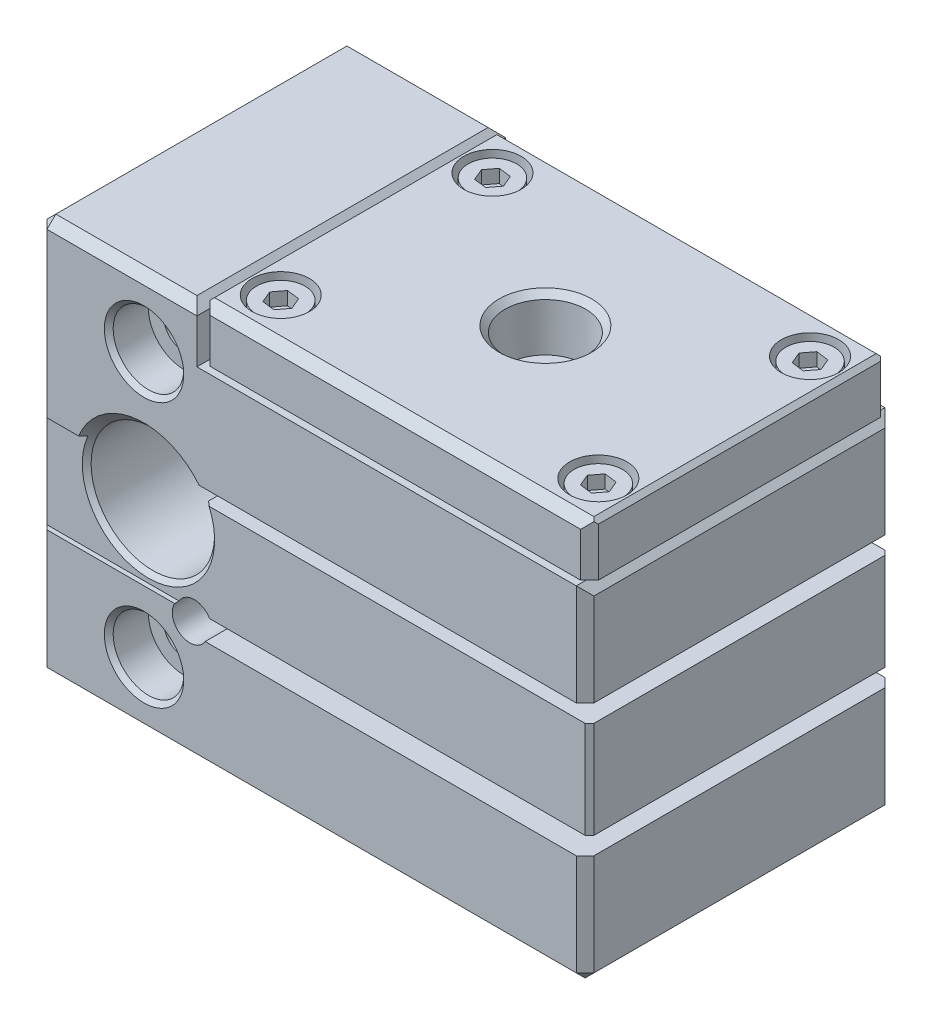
ISO-10303-21;
HEADER;
FILE_DESCRIPTION(('STEP AP214'),'2;1');
FILE_NAME('part.step','',(''),(''),'','','');
FILE_SCHEMA(('AUTOMOTIVE_DESIGN { 1 0 10303 214 1 1 1 1 }'));
ENDSEC;
DATA;
#1=APPLICATION_CONTEXT('core data for automotive mechanical design processes');
#2=APPLICATION_PROTOCOL_DEFINITION('international standard','automotive_design',2000,#1);
#3=PRODUCT_CONTEXT('',#1,'mechanical');
#4=PRODUCT('Part','Part','',(#3));
#5=PRODUCT_RELATED_PRODUCT_CATEGORY('part','',(#4));
#6=PRODUCT_DEFINITION_FORMATION('','',#4);
#7=PRODUCT_DEFINITION_CONTEXT('part definition',#1,'design');
#8=PRODUCT_DEFINITION('design','',#6,#7);
#9=PRODUCT_DEFINITION_SHAPE('','',#8);
#10=(LENGTH_UNIT() NAMED_UNIT(*) SI_UNIT(.MILLI.,.METRE.));
#11=(NAMED_UNIT(*) PLANE_ANGLE_UNIT() SI_UNIT($,.RADIAN.));
#12=(NAMED_UNIT(*) SI_UNIT($,.STERADIAN.) SOLID_ANGLE_UNIT());
#13=UNCERTAINTY_MEASURE_WITH_UNIT(LENGTH_MEASURE(1.E-05),#10,'distance_accuracy_value','');
#14=(GEOMETRIC_REPRESENTATION_CONTEXT(3) GLOBAL_UNCERTAINTY_ASSIGNED_CONTEXT((#13)) GLOBAL_UNIT_ASSIGNED_CONTEXT((#10,
#11,#12)) REPRESENTATION_CONTEXT('',''));
#15=CARTESIAN_POINT('',(0.,0.,0.));
#16=DIRECTION('',(0.,0.,1.));
#17=DIRECTION('',(1.,0.,0.));
#18=AXIS2_PLACEMENT_3D('',#15,#16,#17);
#19=CARTESIAN_POINT('',(28.,17.,17.5));
#20=DIRECTION('',(0.,-1.,0.));
#21=DIRECTION('',(-0.623816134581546,0.,-0.781571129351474));
#22=AXIS2_PLACEMENT_3D('',#19,#20,#21);
#23=CYLINDRICAL_SURFACE('',#22,2.5);
#24=CARTESIAN_POINT('',(28.,18.,17.5));
#25=DIRECTION('',(0.,1.,0.));
#26=DIRECTION('',(0.,0.,-1.));
#27=AXIS2_PLACEMENT_3D('',#24,#25,#26);
#28=CIRCLE('',#27,2.5);
#29=CARTESIAN_POINT('',(28.,18.,15.));
#30=VERTEX_POINT('',#29);
#31=EDGE_CURVE('E2711',#30,#30,#28,.F.);
#32=ORIENTED_EDGE('',*,*,#31,.F.);
#33=EDGE_LOOP('',(#32));
#34=FACE_BOUND('',#33,.T.);
#35=CARTESIAN_POINT('',(28.,20.,17.5));
#36=DIRECTION('',(0.,1.,0.));
#37=DIRECTION('',(0.,0.,1.));
#38=AXIS2_PLACEMENT_3D('',#35,#36,#37);
#39=CIRCLE('',#38,2.5);
#40=CARTESIAN_POINT('',(28.,20.,20.));
#41=VERTEX_POINT('',#40);
#42=EDGE_CURVE('E366',#41,#41,#39,.T.);
#43=ORIENTED_EDGE('',*,*,#42,.F.);
#44=EDGE_LOOP('',(#43));
#45=FACE_BOUND('',#44,.T.);
#46=ADVANCED_FACE('F14',(#34,#45),#23,.T.);
#47=CARTESIAN_POINT('',(28.,-5.,17.5));
#48=DIRECTION('',(0.,-1.,0.));
#49=DIRECTION('',(0.,0.,1.));
#50=AXIS2_PLACEMENT_3D('',#47,#48,#49);
#51=CONICAL_SURFACE('',#50,7.25,0.78539816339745);
#52=CARTESIAN_POINT('',(28.,-7.5,17.5));
#53=DIRECTION('',(0.,1.,0.));
#54=DIRECTION('',(0.,0.,-1.));
#55=AXIS2_PLACEMENT_3D('',#52,#53,#54);
#56=CIRCLE('',#55,9.75);
#57=CARTESIAN_POINT('',(28.,-7.5,7.75));
#58=VERTEX_POINT('',#57);
#59=EDGE_CURVE('E866',#58,#58,#56,.T.);
#60=ORIENTED_EDGE('',*,*,#59,.F.);
#61=EDGE_LOOP('',(#60));
#62=FACE_BOUND('',#61,.T.);
#63=CARTESIAN_POINT('',(28.,-7.25,17.5));
#64=DIRECTION('',(0.,-1.,0.));
#65=DIRECTION('',(0.,0.,1.));
#66=AXIS2_PLACEMENT_3D('',#63,#64,#65);
#67=CIRCLE('',#66,9.5);
#68=CARTESIAN_POINT('',(28.,-7.25,27.));
#69=VERTEX_POINT('',#68);
#70=EDGE_CURVE('E2715',#69,#69,#67,.F.);
#71=ORIENTED_EDGE('',*,*,#70,.T.);
#72=EDGE_LOOP('',(#71));
#73=FACE_BOUND('',#72,.T.);
#74=ADVANCED_FACE('F556',(#62,#73),#51,.F.);
#75=CARTESIAN_POINT('',(50.,-7.5,35.));
#76=DIRECTION('',(0.,1.,0.));
#77=DIRECTION('',(0.,0.,-1.));
#78=AXIS2_PLACEMENT_3D('',#75,#76,#77);
#79=PLANE('',#78);
#80=ORIENTED_EDGE('',*,*,#59,.T.);
#81=EDGE_LOOP('',(#80));
#82=FACE_BOUND('',#81,.T.);
#83=DIRECTION('',(0.,0.,-1.));
#84=VECTOR('',#83,1.);
#85=CARTESIAN_POINT('',(-11.,-7.5,35.));
#86=LINE('',#85,#84);
#87=CARTESIAN_POINT('',(-11.,-7.5,34.));
#88=VERTEX_POINT('',#87);
#89=CARTESIAN_POINT('',(-11.,-7.5,1.));
#90=VERTEX_POINT('',#89);
#91=EDGE_CURVE('E848',#88,#90,#86,.T.);
#92=ORIENTED_EDGE('',*,*,#91,.T.);
#93=DIRECTION('',(1.,0.,0.));
#94=VECTOR('',#93,1.);
#95=CARTESIAN_POINT('',(50.,-7.5,1.));
#96=LINE('',#95,#94);
#97=CARTESIAN_POINT('',(49.,-7.5,1.));
#98=VERTEX_POINT('',#97);
#99=EDGE_CURVE('E851',#90,#98,#96,.T.);
#100=ORIENTED_EDGE('',*,*,#99,.T.);
#101=DIRECTION('',(0.,0.,1.));
#102=VECTOR('',#101,1.);
#103=CARTESIAN_POINT('',(49.,-7.5,35.));
#104=LINE('',#103,#102);
#105=CARTESIAN_POINT('',(49.,-7.5,34.));
#106=VERTEX_POINT('',#105);
#107=EDGE_CURVE('E841',#98,#106,#104,.T.);
#108=ORIENTED_EDGE('',*,*,#107,.T.);
#109=DIRECTION('',(-1.,0.,0.));
#110=VECTOR('',#109,1.);
#111=CARTESIAN_POINT('',(50.,-7.5,34.));
#112=LINE('',#111,#110);
#113=EDGE_CURVE('E845',#106,#88,#112,.T.);
#114=ORIENTED_EDGE('',*,*,#113,.T.);
#115=EDGE_LOOP('',(#92,#100,#108,#114));
#116=FACE_BOUND('',#115,.T.);
#117=ADVANCED_FACE('F562',(#82,#116),#79,.F.);
#118=CARTESIAN_POINT('',(-11.,-7.5,35.));
#119=DIRECTION('',(0.707106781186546,0.707106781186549,0.));
#120=DIRECTION('',(-0.707106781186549,0.707106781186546,0.));
#121=AXIS2_PLACEMENT_3D('',#118,#119,#120);
#122=PLANE('',#121);
#123=DIRECTION('',(-0.707106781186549,0.707106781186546,0.));
#124=VECTOR('',#123,1.);
#125=CARTESIAN_POINT('',(-11.5,-7.,34.));
#126=LINE('',#125,#124);
#127=CARTESIAN_POINT('',(-12.,-6.5,34.));
#128=VERTEX_POINT('',#127);
#129=EDGE_CURVE('E906',#88,#128,#126,.T.);
#130=ORIENTED_EDGE('',*,*,#129,.T.);
#131=DIRECTION('',(0.,0.,1.));
#132=VECTOR('',#131,1.);
#133=CARTESIAN_POINT('',(-12.,-6.5,35.));
#134=LINE('',#133,#132);
#135=CARTESIAN_POINT('',(-12.,-6.5,1.));
#136=VERTEX_POINT('',#135);
#137=EDGE_CURVE('E854',#136,#128,#134,.T.);
#138=ORIENTED_EDGE('',*,*,#137,.F.);
#139=DIRECTION('',(0.707106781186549,-0.707106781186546,0.));
#140=VECTOR('',#139,1.);
#141=CARTESIAN_POINT('',(-11.5,-7.,1.));
#142=LINE('',#141,#140);
#143=EDGE_CURVE('E897',#90,#136,#142,.F.);
#144=ORIENTED_EDGE('',*,*,#143,.F.);
#145=ORIENTED_EDGE('',*,*,#91,.F.);
#146=EDGE_LOOP('',(#130,#138,#144,#145));
#147=FACE_BOUND('',#146,.T.);
#148=ADVANCED_FACE('F1388',(#147),#122,.F.);
#149=CARTESIAN_POINT('',(50.,-7.5,1.));
#150=DIRECTION('',(0.,-0.70710678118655,-0.707106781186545));
#151=DIRECTION('',(0.,-0.707106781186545,0.70710678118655));
#152=AXIS2_PLACEMENT_3D('',#149,#150,#151);
#153=PLANE('',#152);
#154=DIRECTION('',(0.,-0.707106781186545,0.70710678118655));
#155=VECTOR('',#154,1.);
#156=CARTESIAN_POINT('',(-11.,-6.5,0.));
#157=LINE('',#156,#155);
#158=CARTESIAN_POINT('',(-11.,-6.5,0.));
#159=VERTEX_POINT('',#158);
#160=EDGE_CURVE('E888',#90,#159,#157,.F.);
#161=ORIENTED_EDGE('',*,*,#160,.T.);
#162=DIRECTION('',(-1.,0.,0.));
#163=VECTOR('',#162,1.);
#164=CARTESIAN_POINT('',(-12.,-6.5,0.));
#165=LINE('',#164,#163);
#166=CARTESIAN_POINT('',(49.,-6.5,0.));
#167=VERTEX_POINT('',#166);
#168=EDGE_CURVE('E759',#167,#159,#165,.T.);
#169=ORIENTED_EDGE('',*,*,#168,.F.);
#170=DIRECTION('',(0.,0.707106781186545,-0.70710678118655));
#171=VECTOR('',#170,1.);
#172=CARTESIAN_POINT('',(49.,-6.5,0.));
#173=LINE('',#172,#171);
#174=EDGE_CURVE('E882',#98,#167,#173,.T.);
#175=ORIENTED_EDGE('',*,*,#174,.F.);
#176=ORIENTED_EDGE('',*,*,#99,.F.);
#177=EDGE_LOOP('',(#161,#169,#175,#176));
#178=FACE_BOUND('',#177,.T.);
#179=ADVANCED_FACE('F1372',(#178),#153,.T.);
#180=CARTESIAN_POINT('',(50.,-6.5,35.));
#181=DIRECTION('',(-0.707106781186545,0.70710678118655,0.));
#182=DIRECTION('',(-0.70710678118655,-0.707106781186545,0.));
#183=AXIS2_PLACEMENT_3D('',#180,#181,#182);
#184=PLANE('',#183);
#185=DIRECTION('',(-0.70710678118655,-0.707106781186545,0.));
#186=VECTOR('',#185,1.);
#187=CARTESIAN_POINT('',(50.,-6.5,34.));
#188=LINE('',#187,#186);
#189=CARTESIAN_POINT('',(50.,-6.5,34.));
#190=VERTEX_POINT('',#189);
#191=EDGE_CURVE('E885',#190,#106,#188,.T.);
#192=ORIENTED_EDGE('',*,*,#191,.T.);
#193=ORIENTED_EDGE('',*,*,#107,.F.);
#194=DIRECTION('',(0.70710678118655,0.707106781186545,0.));
#195=VECTOR('',#194,1.);
#196=CARTESIAN_POINT('',(49.5,-7.,1.));
#197=LINE('',#196,#195);
#198=CARTESIAN_POINT('',(50.,-6.5,1.));
#199=VERTEX_POINT('',#198);
#200=EDGE_CURVE('E878',#199,#98,#197,.F.);
#201=ORIENTED_EDGE('',*,*,#200,.F.);
#202=DIRECTION('',(0.,0.,-1.));
#203=VECTOR('',#202,1.);
#204=CARTESIAN_POINT('',(50.,-6.5,35.));
#205=LINE('',#204,#203);
#206=EDGE_CURVE('E811',#190,#199,#205,.T.);
#207=ORIENTED_EDGE('',*,*,#206,.F.);
#208=EDGE_LOOP('',(#192,#193,#201,#207));
#209=FACE_BOUND('',#208,.T.);
#210=ADVANCED_FACE('F1232',(#209),#184,.F.);
#211=CARTESIAN_POINT('',(-12.,-6.5,35.));
#212=DIRECTION('',(0.,0.70710678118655,-0.707106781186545));
#213=DIRECTION('',(0.,-0.707106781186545,-0.70710678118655));
#214=AXIS2_PLACEMENT_3D('',#211,#212,#213);
#215=PLANE('',#214);
#216=DIRECTION('',(0.,-0.707106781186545,-0.70710678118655));
#217=VECTOR('',#216,1.);
#218=CARTESIAN_POINT('',(-11.,-6.5,35.));
#219=LINE('',#218,#217);
#220=CARTESIAN_POINT('',(-11.,-6.5,35.));
#221=VERTEX_POINT('',#220);
#222=EDGE_CURVE('E903',#221,#88,#219,.T.);
#223=ORIENTED_EDGE('',*,*,#222,.T.);
#224=ORIENTED_EDGE('',*,*,#113,.F.);
#225=DIRECTION('',(0.,0.707106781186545,0.70710678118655));
#226=VECTOR('',#225,1.);
#227=CARTESIAN_POINT('',(49.,-7.,34.5));
#228=LINE('',#227,#226);
#229=CARTESIAN_POINT('',(49.,-6.5,35.));
#230=VERTEX_POINT('',#229);
#231=EDGE_CURVE('E894',#230,#106,#228,.F.);
#232=ORIENTED_EDGE('',*,*,#231,.F.);
#233=DIRECTION('',(1.,0.,0.));
#234=VECTOR('',#233,1.);
#235=CARTESIAN_POINT('',(-12.,-6.5,35.));
#236=LINE('',#235,#234);
#237=EDGE_CURVE('E777',#221,#230,#236,.T.);
#238=ORIENTED_EDGE('',*,*,#237,.F.);
#239=EDGE_LOOP('',(#223,#224,#232,#238));
#240=FACE_BOUND('',#239,.T.);
#241=ADVANCED_FACE('F1367',(#240),#215,.F.);
#242=CARTESIAN_POINT('',(-11.,-6.5,35.));
#243=DIRECTION('',(-0.577350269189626,-0.577350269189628,0.577350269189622));
#244=DIRECTION('',(0.707106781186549,-0.707106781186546,0.));
#245=AXIS2_PLACEMENT_3D('',#242,#243,#244);
#246=PLANE('',#245);
#247=ORIENTED_EDGE('',*,*,#222,.F.);
#248=DIRECTION('',(0.707106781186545,0.,0.70710678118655));
#249=VECTOR('',#248,1.);
#250=CARTESIAN_POINT('',(-11.,-6.5,35.));
#251=LINE('',#250,#249);
#252=EDGE_CURVE('E912',#221,#128,#251,.F.);
#253=ORIENTED_EDGE('',*,*,#252,.T.);
#254=ORIENTED_EDGE('',*,*,#129,.F.);
#255=EDGE_LOOP('',(#247,#253,#254));
#256=FACE_BOUND('',#255,.T.);
#257=ADVANCED_FACE('F1363',(#256),#246,.T.);
#258=CARTESIAN_POINT('',(-12.,-7.5,35.));
#259=DIRECTION('',(1.,0.,0.));
#260=DIRECTION('',(0.,0.,-1.));
#261=AXIS2_PLACEMENT_3D('',#258,#259,#260);
#262=PLANE('',#261);
#263=DIRECTION('',(0.,0.,-1.));
#264=VECTOR('',#263,1.);
#265=CARTESIAN_POINT('',(-12.,36.5,35.));
#266=LINE('',#265,#264);
#267=CARTESIAN_POINT('',(-12.,36.5,34.));
#268=VERTEX_POINT('',#267);
#269=CARTESIAN_POINT('',(-12.,36.5,1.));
#270=VERTEX_POINT('',#269);
#271=EDGE_CURVE('E860',#268,#270,#266,.T.);
#272=ORIENTED_EDGE('',*,*,#271,.T.);
#273=DIRECTION('',(0.,-1.,0.));
#274=VECTOR('',#273,1.);
#275=CARTESIAN_POINT('',(-12.,-7.5,1.));
#276=LINE('',#275,#274);
#277=EDGE_CURVE('E863',#270,#136,#276,.T.);
#278=ORIENTED_EDGE('',*,*,#277,.T.);
#279=ORIENTED_EDGE('',*,*,#137,.T.);
#280=DIRECTION('',(0.,1.,0.));
#281=VECTOR('',#280,1.);
#282=CARTESIAN_POINT('',(-12.,-7.5,34.));
#283=LINE('',#282,#281);
#284=EDGE_CURVE('E857',#128,#268,#283,.T.);
#285=ORIENTED_EDGE('',*,*,#284,.T.);
#286=EDGE_LOOP('',(#272,#278,#279,#285));
#287=FACE_BOUND('',#286,.T.);
#288=ADVANCED_FACE('F1390',(#287),#262,.F.);
#289=CARTESIAN_POINT('',(-11.,-6.5,0.));
#290=DIRECTION('',(-0.577350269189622,-0.577350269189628,-0.577350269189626));
#291=DIRECTION('',(0.,-0.707106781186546,0.707106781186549));
#292=AXIS2_PLACEMENT_3D('',#289,#290,#291);
#293=PLANE('',#292);
#294=ORIENTED_EDGE('',*,*,#143,.T.);
#295=DIRECTION('',(0.70710678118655,0.,-0.707106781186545));
#296=VECTOR('',#295,1.);
#297=CARTESIAN_POINT('',(-11.,-6.5,0.));
#298=LINE('',#297,#296);
#299=EDGE_CURVE('E900',#136,#159,#298,.T.);
#300=ORIENTED_EDGE('',*,*,#299,.T.);
#301=ORIENTED_EDGE('',*,*,#160,.F.);
#302=EDGE_LOOP('',(#294,#300,#301));
#303=FACE_BOUND('',#302,.T.);
#304=ADVANCED_FACE('F1386',(#303),#293,.T.);
#305=CARTESIAN_POINT('',(5.,37.5,35.));
#306=DIRECTION('',(-0.70710678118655,-0.707106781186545,0.));
#307=DIRECTION('',(0.707106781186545,-0.70710678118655,0.));
#308=AXIS2_PLACEMENT_3D('',#305,#306,#307);
#309=PLANE('',#308);
#310=DIRECTION('',(-0.577350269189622,0.577350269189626,-0.57735026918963));
#311=VECTOR('',#310,1.);
#312=CARTESIAN_POINT('',(0.,42.5,29.));
#313=LINE('',#312,#311);
#314=CARTESIAN_POINT('',(5.,37.5,34.));
#315=VERTEX_POINT('',#314);
#316=CARTESIAN_POINT('',(6.,36.5,35.));
#317=VERTEX_POINT('',#316);
#318=EDGE_CURVE('E871',#315,#317,#313,.F.);
#319=ORIENTED_EDGE('',*,*,#318,.T.);
#320=DIRECTION('',(0.,0.,1.));
#321=VECTOR('',#320,1.);
#322=CARTESIAN_POINT('',(6.,36.5,35.));
#323=LINE('',#322,#321);
#324=CARTESIAN_POINT('',(6.,36.5,33.5));
#325=VERTEX_POINT('',#324);
#326=EDGE_CURVE('E838',#325,#317,#323,.T.);
#327=ORIENTED_EDGE('',*,*,#326,.F.);
#328=CARTESIAN_POINT('',(6.,36.5,1.5));
#329=VERTEX_POINT('',#328);
#330=EDGE_CURVE('E842',#329,#325,#323,.T.);
#331=ORIENTED_EDGE('',*,*,#330,.F.);
#332=CARTESIAN_POINT('',(6.,36.5,0.));
#333=VERTEX_POINT('',#332);
#334=EDGE_CURVE('E839',#333,#329,#323,.T.);
#335=ORIENTED_EDGE('',*,*,#334,.F.);
#336=DIRECTION('',(0.577350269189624,-0.577350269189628,-0.577350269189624));
#337=VECTOR('',#336,1.);
#338=CARTESIAN_POINT('',(-6.33333333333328,48.8333333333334,12.3333333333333));
#339=LINE('',#338,#337);
#340=CARTESIAN_POINT('',(5.,37.5,1.));
#341=VERTEX_POINT('',#340);
#342=EDGE_CURVE('E927',#341,#333,#339,.T.);
#343=ORIENTED_EDGE('',*,*,#342,.F.);
#344=DIRECTION('',(0.,0.,-1.));
#345=VECTOR('',#344,1.);
#346=CARTESIAN_POINT('',(5.,37.5,35.));
#347=LINE('',#346,#345);
#348=EDGE_CURVE('E832',#315,#341,#347,.T.);
#349=ORIENTED_EDGE('',*,*,#348,.F.);
#350=EDGE_LOOP('',(#319,#327,#331,#335,#343,#349));
#351=FACE_BOUND('',#350,.T.);
#352=ADVANCED_FACE('F1095',(#351),#309,.F.);
#353=CARTESIAN_POINT('',(-12.,36.5,35.));
#354=DIRECTION('',(0.,-0.70710678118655,-0.707106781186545));
#355=DIRECTION('',(0.,-0.707106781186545,0.70710678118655));
#356=AXIS2_PLACEMENT_3D('',#353,#354,#355);
#357=PLANE('',#356);
#358=DIRECTION('',(0.,-0.707106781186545,0.70710678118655));
#359=VECTOR('',#358,1.);
#360=CARTESIAN_POINT('',(-11.,36.5,35.));
#361=LINE('',#360,#359);
#362=CARTESIAN_POINT('',(-11.,36.5,35.));
#363=VERTEX_POINT('',#362);
#364=CARTESIAN_POINT('',(-11.,37.5,34.));
#365=VERTEX_POINT('',#364);
#366=EDGE_CURVE('E930',#363,#365,#361,.F.);
#367=ORIENTED_EDGE('',*,*,#366,.F.);
#368=DIRECTION('',(-1.,0.,0.));
#369=VECTOR('',#368,1.);
#370=CARTESIAN_POINT('',(-12.,36.5,35.));
#371=LINE('',#370,#369);
#372=EDGE_CURVE('E784',#317,#363,#371,.T.);
#373=ORIENTED_EDGE('',*,*,#372,.F.);
#374=ORIENTED_EDGE('',*,*,#318,.F.);
#375=DIRECTION('',(1.,0.,0.));
#376=VECTOR('',#375,1.);
#377=CARTESIAN_POINT('',(6.,37.5,34.));
#378=LINE('',#377,#376);
#379=EDGE_CURVE('E829',#365,#315,#378,.T.);
#380=ORIENTED_EDGE('',*,*,#379,.F.);
#381=EDGE_LOOP('',(#367,#373,#374,#380));
#382=FACE_BOUND('',#381,.T.);
#383=ADVANCED_FACE('F1189',(#382),#357,.F.);
#384=CARTESIAN_POINT('',(6.,37.5,35.));
#385=DIRECTION('',(-1.,0.,0.));
#386=DIRECTION('',(0.,-1.,0.));
#387=AXIS2_PLACEMENT_3D('',#384,#385,#386);
#388=PLANE('',#387);
#389=DIRECTION('',(0.,0.,-1.));
#390=VECTOR('',#389,1.);
#391=CARTESIAN_POINT('',(6.,31.8,35.));
#392=LINE('',#391,#390);
#393=CARTESIAN_POINT('',(6.,31.8,33.5));
#394=VERTEX_POINT('',#393);
#395=CARTESIAN_POINT('',(6.,31.8,1.5));
#396=VERTEX_POINT('',#395);
#397=EDGE_CURVE('E1172',#394,#396,#392,.T.);
#398=ORIENTED_EDGE('',*,*,#397,.F.);
#399=DIRECTION('',(0.,1.,0.));
#400=VECTOR('',#399,1.);
#401=CARTESIAN_POINT('',(6.,37.8,33.5));
#402=LINE('',#401,#400);
#403=EDGE_CURVE('E370',#394,#325,#402,.T.);
#404=ORIENTED_EDGE('',*,*,#403,.T.);
#405=ORIENTED_EDGE('',*,*,#326,.T.);
#406=DIRECTION('',(0.,1.,0.));
#407=VECTOR('',#406,1.);
#408=CARTESIAN_POINT('',(6.,37.5,35.));
#409=LINE('',#408,#407);
#410=CARTESIAN_POINT('',(6.,31.5,35.));
#411=VERTEX_POINT('',#410);
#412=EDGE_CURVE('E1073',#411,#317,#409,.T.);
#413=ORIENTED_EDGE('',*,*,#412,.F.);
#414=DIRECTION('',(0.,0.,-1.));
#415=VECTOR('',#414,1.);
#416=CARTESIAN_POINT('',(6.,31.5,35.));
#417=LINE('',#416,#415);
#418=CARTESIAN_POINT('',(6.,31.5,0.));
#419=VERTEX_POINT('',#418);
#420=EDGE_CURVE('E738',#411,#419,#417,.T.);
#421=ORIENTED_EDGE('',*,*,#420,.T.);
#422=DIRECTION('',(0.,1.,0.));
#423=VECTOR('',#422,1.);
#424=CARTESIAN_POINT('',(6.,37.5,0.));
#425=LINE('',#424,#423);
#426=EDGE_CURVE('E1074',#419,#333,#425,.T.);
#427=ORIENTED_EDGE('',*,*,#426,.T.);
#428=ORIENTED_EDGE('',*,*,#334,.T.);
#429=DIRECTION('',(0.,-1.,0.));
#430=VECTOR('',#429,1.);
#431=CARTESIAN_POINT('',(6.,37.8,1.5));
#432=LINE('',#431,#430);
#433=EDGE_CURVE('E30',#329,#396,#432,.T.);
#434=ORIENTED_EDGE('',*,*,#433,.T.);
#435=EDGE_LOOP('',(#398,#404,#405,#413,#421,#427,#428,#434));
#436=FACE_BOUND('',#435,.T.);
#437=ADVANCED_FACE('F1083',(#436),#388,.F.);
#438=CARTESIAN_POINT('',(6.,37.5,1.));
#439=DIRECTION('',(0.,0.707106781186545,-0.70710678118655));
#440=DIRECTION('',(0.,-0.70710678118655,-0.707106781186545));
#441=AXIS2_PLACEMENT_3D('',#438,#439,#440);
#442=PLANE('',#441);
#443=ORIENTED_EDGE('',*,*,#342,.T.);
#444=DIRECTION('',(1.,0.,0.));
#445=VECTOR('',#444,1.);
#446=CARTESIAN_POINT('',(6.,36.5,0.));
#447=LINE('',#446,#445);
#448=CARTESIAN_POINT('',(-11.,36.5,0.));
#449=VERTEX_POINT('',#448);
#450=EDGE_CURVE('E762',#449,#333,#447,.T.);
#451=ORIENTED_EDGE('',*,*,#450,.F.);
#452=DIRECTION('',(0.,-0.70710678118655,-0.707106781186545));
#453=VECTOR('',#452,1.);
#454=CARTESIAN_POINT('',(-11.,37.5,1.));
#455=LINE('',#454,#453);
#456=CARTESIAN_POINT('',(-11.,37.5,1.));
#457=VERTEX_POINT('',#456);
#458=EDGE_CURVE('E918',#457,#449,#455,.T.);
#459=ORIENTED_EDGE('',*,*,#458,.F.);
#460=DIRECTION('',(-1.,0.,0.));
#461=VECTOR('',#460,1.);
#462=CARTESIAN_POINT('',(-12.,37.5,1.));
#463=LINE('',#462,#461);
#464=EDGE_CURVE('E835',#341,#457,#463,.T.);
#465=ORIENTED_EDGE('',*,*,#464,.F.);
#466=EDGE_LOOP('',(#443,#451,#459,#465));
#467=FACE_BOUND('',#466,.T.);
#468=ADVANCED_FACE('F1103',(#467),#442,.T.);
#469=CARTESIAN_POINT('',(6.,37.5,35.));
#470=DIRECTION('',(0.,-1.,0.));
#471=DIRECTION('',(0.,0.,1.));
#472=AXIS2_PLACEMENT_3D('',#469,#470,#471);
#473=PLANE('',#472);
#474=ORIENTED_EDGE('',*,*,#348,.T.);
#475=ORIENTED_EDGE('',*,*,#464,.T.);
#476=DIRECTION('',(0.,0.,1.));
#477=VECTOR('',#476,1.);
#478=CARTESIAN_POINT('',(-11.,37.5,35.));
#479=LINE('',#478,#477);
#480=EDGE_CURVE('E826',#457,#365,#479,.T.);
#481=ORIENTED_EDGE('',*,*,#480,.T.);
#482=ORIENTED_EDGE('',*,*,#379,.T.);
#483=EDGE_LOOP('',(#474,#475,#481,#482));
#484=FACE_BOUND('',#483,.T.);
#485=ADVANCED_FACE('F1112',(#484),#473,.F.);
#486=CARTESIAN_POINT('',(-12.,-7.5,35.));
#487=DIRECTION('',(0.,0.,-1.));
#488=DIRECTION('',(0.,-1.,0.));
#489=AXIS2_PLACEMENT_3D('',#486,#487,#488);
#490=PLANE('',#489);
#491=CARTESIAN_POINT('',(0.,30.,35.));
#492=DIRECTION('',(0.,0.,-1.));
#493=DIRECTION('',(0.,-1.,0.));
#494=AXIS2_PLACEMENT_3D('',#491,#492,#493);
#495=CIRCLE('',#494,4.5);
#496=CARTESIAN_POINT('',(0.,25.5,35.));
#497=VERTEX_POINT('',#496);
#498=EDGE_CURVE('E1016',#497,#497,#495,.T.);
#499=ORIENTED_EDGE('',*,*,#498,.T.);
#500=EDGE_LOOP('',(#499));
#501=FACE_BOUND('',#500,.T.);
#502=DIRECTION('',(1.,0.,0.));
#503=VECTOR('',#502,1.);
#504=CARTESIAN_POINT('',(-12.,18.,35.));
#505=LINE('',#504,#503);
#506=CARTESIAN_POINT('',(-11.,18.,35.));
#507=VERTEX_POINT('',#506);
#508=CARTESIAN_POINT('',(-7.4161984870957,18.,35.));
#509=VERTEX_POINT('',#508);
#510=EDGE_CURVE('E1500',#507,#509,#505,.T.);
#511=ORIENTED_EDGE('',*,*,#510,.T.);
#512=CARTESIAN_POINT('',(0.,15.,35.));
#513=DIRECTION('',(0.,0.,-1.));
#514=DIRECTION('',(0.,-1.,0.));
#515=AXIS2_PLACEMENT_3D('',#512,#513,#514);
#516=CIRCLE('',#515,8.);
#517=CARTESIAN_POINT('',(6.24499799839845,20.,35.));
#518=VERTEX_POINT('',#517);
#519=EDGE_CURVE('E3060',#509,#518,#516,.T.);
#520=ORIENTED_EDGE('',*,*,#519,.T.);
#521=DIRECTION('',(-1.,0.,0.));
#522=VECTOR('',#521,1.);
#523=CARTESIAN_POINT('',(0.,20.,35.));
#524=LINE('',#523,#522);
#525=CARTESIAN_POINT('',(49.,20.,35.));
#526=VERTEX_POINT('',#525);
#527=EDGE_CURVE('E1042',#526,#518,#524,.T.);
#528=ORIENTED_EDGE('',*,*,#527,.F.);
#529=DIRECTION('',(0.,1.,0.));
#530=VECTOR('',#529,1.);
#531=CARTESIAN_POINT('',(49.,-7.5,35.));
#532=LINE('',#531,#530);
#533=CARTESIAN_POINT('',(49.,31.5,35.));
#534=VERTEX_POINT('',#533);
#535=EDGE_CURVE('E790',#526,#534,#532,.T.);
#536=ORIENTED_EDGE('',*,*,#535,.T.);
#537=DIRECTION('',(-1.,0.,0.));
#538=VECTOR('',#537,1.);
#539=CARTESIAN_POINT('',(6.,31.5,35.));
#540=LINE('',#539,#538);
#541=EDGE_CURVE('E1070',#534,#411,#540,.T.);
#542=ORIENTED_EDGE('',*,*,#541,.T.);
#543=ORIENTED_EDGE('',*,*,#412,.T.);
#544=ORIENTED_EDGE('',*,*,#372,.T.);
#545=DIRECTION('',(0.,-1.,0.));
#546=VECTOR('',#545,1.);
#547=CARTESIAN_POINT('',(-11.,-7.5,35.));
#548=LINE('',#547,#546);
#549=EDGE_CURVE('E781',#363,#507,#548,.T.);
#550=ORIENTED_EDGE('',*,*,#549,.T.);
#551=EDGE_LOOP('',(#511,#520,#528,#536,#542,#543,#544,#550));
#552=FACE_BOUND('',#551,.T.);
#553=ADVANCED_FACE('F1194',(#501,#552),#490,.F.);
#554=CARTESIAN_POINT('',(28.,2.88953359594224,17.5));
#555=DIRECTION('',(0.,-1.,0.));
#556=DIRECTION('',(0.,0.,1.));
#557=AXIS2_PLACEMENT_3D('',#554,#555,#556);
#558=CYLINDRICAL_SURFACE('',#557,15.);
#559=CARTESIAN_POINT('',(28.,31.5,17.5));
#560=DIRECTION('',(0.,-1.,0.));
#561=DIRECTION('',(0.,0.,1.));
#562=AXIS2_PLACEMENT_3D('',#559,#560,#561);
#563=CIRCLE('',#562,15.);
#564=CARTESIAN_POINT('',(28.,31.5,32.5));
#565=VERTEX_POINT('',#564);
#566=EDGE_CURVE('E1066',#565,#565,#563,.T.);
#567=ORIENTED_EDGE('',*,*,#566,.F.);
#568=EDGE_LOOP('',(#567));
#569=FACE_BOUND('',#568,.T.);
#570=CARTESIAN_POINT('',(28.,31.,17.5));
#571=DIRECTION('',(0.,-1.,0.));
#572=DIRECTION('',(0.,0.,1.));
#573=AXIS2_PLACEMENT_3D('',#570,#571,#572);
#574=CIRCLE('',#573,15.);
#575=CARTESIAN_POINT('',(28.,31.,32.5));
#576=VERTEX_POINT('',#575);
#577=EDGE_CURVE('E2710',#576,#576,#574,.T.);
#578=ORIENTED_EDGE('',*,*,#577,.T.);
#579=EDGE_LOOP('',(#578));
#580=FACE_BOUND('',#579,.T.);
#581=ADVANCED_FACE('F614',(#569,#580),#558,.F.);
#582=CARTESIAN_POINT('',(6.,31.5,35.));
#583=DIRECTION('',(0.,-1.,0.));
#584=DIRECTION('',(1.,0.,0.));
#585=AXIS2_PLACEMENT_3D('',#582,#583,#584);
#586=PLANE('',#585);
#587=ORIENTED_EDGE('',*,*,#541,.F.);
#588=DIRECTION('',(0.,0.,-1.));
#589=VECTOR('',#588,1.);
#590=CARTESIAN_POINT('',(49.,31.5,35.));
#591=LINE('',#590,#589);
#592=CARTESIAN_POINT('',(49.,31.5,0.));
#593=VERTEX_POINT('',#592);
#594=EDGE_CURVE('E808',#534,#593,#591,.T.);
#595=ORIENTED_EDGE('',*,*,#594,.T.);
#596=DIRECTION('',(-1.,0.,0.));
#597=VECTOR('',#596,1.);
#598=CARTESIAN_POINT('',(6.,31.5,0.));
#599=LINE('',#598,#597);
#600=EDGE_CURVE('E1069',#593,#419,#599,.T.);
#601=ORIENTED_EDGE('',*,*,#600,.T.);
#602=ORIENTED_EDGE('',*,*,#420,.F.);
#603=EDGE_LOOP('',(#587,#595,#601,#602));
#604=FACE_BOUND('',#603,.T.);
#605=ORIENTED_EDGE('',*,*,#566,.T.);
#606=EDGE_LOOP('',(#605));
#607=FACE_BOUND('',#606,.T.);
#608=CARTESIAN_POINT('',(10.,31.5,5.5));
#609=DIRECTION('',(0.,1.,0.));
#610=DIRECTION('',(-1.,0.,0.));
#611=AXIS2_PLACEMENT_3D('',#608,#609,#610);
#612=CIRCLE('',#611,1.5);
#613=CARTESIAN_POINT('',(8.5,31.5,5.5));
#614=VERTEX_POINT('',#613);
#615=EDGE_CURVE('E369',#614,#614,#612,.F.);
#616=ORIENTED_EDGE('',*,*,#615,.T.);
#617=EDGE_LOOP('',(#616));
#618=FACE_BOUND('',#617,.T.);
#619=CARTESIAN_POINT('',(46.,31.5,5.50000000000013));
#620=DIRECTION('',(0.,1.,0.));
#621=DIRECTION('',(-1.,0.,0.));
#622=AXIS2_PLACEMENT_3D('',#619,#620,#621);
#623=CIRCLE('',#622,1.5);
#624=CARTESIAN_POINT('',(44.5,31.5,5.50000000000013));
#625=VERTEX_POINT('',#624);
#626=EDGE_CURVE('E373',#625,#625,#623,.F.);
#627=ORIENTED_EDGE('',*,*,#626,.T.);
#628=EDGE_LOOP('',(#627));
#629=FACE_BOUND('',#628,.T.);
#630=CARTESIAN_POINT('',(10.,31.5,29.5));
#631=DIRECTION('',(0.,1.,0.));
#632=DIRECTION('',(-1.,0.,0.));
#633=AXIS2_PLACEMENT_3D('',#630,#631,#632);
#634=CIRCLE('',#633,1.5);
#635=CARTESIAN_POINT('',(8.5,31.5,29.5));
#636=VERTEX_POINT('',#635);
#637=EDGE_CURVE('E22',#636,#636,#634,.F.);
#638=ORIENTED_EDGE('',*,*,#637,.T.);
#639=EDGE_LOOP('',(#638));
#640=FACE_BOUND('',#639,.T.);
#641=CARTESIAN_POINT('',(46.,31.5,29.5));
#642=DIRECTION('',(0.,1.,0.));
#643=DIRECTION('',(-1.,0.,0.));
#644=AXIS2_PLACEMENT_3D('',#641,#642,#643);
#645=CIRCLE('',#644,1.5);
#646=CARTESIAN_POINT('',(44.5,31.5,29.5));
#647=VERTEX_POINT('',#646);
#648=EDGE_CURVE('E9',#647,#647,#645,.F.);
#649=ORIENTED_EDGE('',*,*,#648,.T.);
#650=EDGE_LOOP('',(#649));
#651=FACE_BOUND('',#650,.T.);
#652=ADVANCED_FACE('F378',(#604,#607,#618,#629,#640,#651),#586,.F.);
#653=CARTESIAN_POINT('',(-12.,-7.5,0.));
#654=DIRECTION('',(0.,0.,-1.));
#655=DIRECTION('',(0.,-1.,0.));
#656=AXIS2_PLACEMENT_3D('',#653,#654,#655);
#657=PLANE('',#656);
#658=CARTESIAN_POINT('',(0.,30.,0.));
#659=DIRECTION('',(0.,0.,-1.));
#660=DIRECTION('',(0.,-1.,0.));
#661=AXIS2_PLACEMENT_3D('',#658,#659,#660);
#662=CIRCLE('',#661,4.75);
#663=CARTESIAN_POINT('',(0.,25.25,0.));
#664=VERTEX_POINT('',#663);
#665=EDGE_CURVE('E1010',#664,#664,#662,.F.);
#666=ORIENTED_EDGE('',*,*,#665,.T.);
#667=EDGE_LOOP('',(#666));
#668=FACE_BOUND('',#667,.T.);
#669=DIRECTION('',(-1.,0.,0.));
#670=VECTOR('',#669,1.);
#671=CARTESIAN_POINT('',(0.,20.,0.));
#672=LINE('',#671,#670);
#673=CARTESIAN_POINT('',(49.,20.,0.));
#674=VERTEX_POINT('',#673);
#675=CARTESIAN_POINT('',(6.2449979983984,20.,0.));
#676=VERTEX_POINT('',#675);
#677=EDGE_CURVE('E1260',#674,#676,#672,.T.);
#678=ORIENTED_EDGE('',*,*,#677,.T.);
#679=CARTESIAN_POINT('',(0.,15.,0.));
#680=DIRECTION('',(0.,0.,-1.));
#681=DIRECTION('',(0.,-1.,0.));
#682=AXIS2_PLACEMENT_3D('',#679,#680,#681);
#683=CIRCLE('',#682,8.);
#684=CARTESIAN_POINT('',(-7.41619848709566,18.,0.));
#685=VERTEX_POINT('',#684);
#686=EDGE_CURVE('E1018',#676,#685,#683,.F.);
#687=ORIENTED_EDGE('',*,*,#686,.T.);
#688=DIRECTION('',(1.,0.,0.));
#689=VECTOR('',#688,1.);
#690=CARTESIAN_POINT('',(-12.,18.,0.));
#691=LINE('',#690,#689);
#692=CARTESIAN_POINT('',(-11.,18.,0.));
#693=VERTEX_POINT('',#692);
#694=EDGE_CURVE('E1515',#693,#685,#691,.T.);
#695=ORIENTED_EDGE('',*,*,#694,.F.);
#696=DIRECTION('',(0.,1.,0.));
#697=VECTOR('',#696,1.);
#698=CARTESIAN_POINT('',(-11.,37.5,0.));
#699=LINE('',#698,#697);
#700=EDGE_CURVE('E755',#693,#449,#699,.T.);
#701=ORIENTED_EDGE('',*,*,#700,.T.);
#702=ORIENTED_EDGE('',*,*,#450,.T.);
#703=ORIENTED_EDGE('',*,*,#426,.F.);
#704=ORIENTED_EDGE('',*,*,#600,.F.);
#705=DIRECTION('',(0.,-1.,0.));
#706=VECTOR('',#705,1.);
#707=CARTESIAN_POINT('',(49.,20.,0.));
#708=LINE('',#707,#706);
#709=EDGE_CURVE('E768',#593,#674,#708,.T.);
#710=ORIENTED_EDGE('',*,*,#709,.T.);
#711=EDGE_LOOP('',(#678,#687,#695,#701,#702,#703,#704,#710));
#712=FACE_BOUND('',#711,.T.);
#713=ADVANCED_FACE('F1405',(#668,#712),#657,.T.);
#714=CARTESIAN_POINT('',(-11.,36.5,35.));
#715=DIRECTION('',(-0.577350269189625,0.57735026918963,0.577350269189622));
#716=DIRECTION('',(-0.707106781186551,-0.707106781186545,0.));
#717=AXIS2_PLACEMENT_3D('',#714,#715,#716);
#718=PLANE('',#717);
#719=DIRECTION('',(-0.707106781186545,0.,-0.70710678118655));
#720=VECTOR('',#719,1.);
#721=CARTESIAN_POINT('',(-11.,36.5,35.));
#722=LINE('',#721,#720);
#723=EDGE_CURVE('E921',#363,#268,#722,.T.);
#724=ORIENTED_EDGE('',*,*,#723,.F.);
#725=ORIENTED_EDGE('',*,*,#366,.T.);
#726=DIRECTION('',(0.707106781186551,0.707106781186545,0.));
#727=VECTOR('',#726,1.);
#728=CARTESIAN_POINT('',(-11.5,37.,34.));
#729=LINE('',#728,#727);
#730=EDGE_CURVE('E924',#268,#365,#729,.T.);
#731=ORIENTED_EDGE('',*,*,#730,.F.);
#732=EDGE_LOOP('',(#724,#725,#731));
#733=FACE_BOUND('',#732,.T.);
#734=ADVANCED_FACE('F1397',(#733),#718,.T.);
#735=CARTESIAN_POINT('',(-11.,37.5,1.));
#736=DIRECTION('',(-0.577350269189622,0.577350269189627,-0.577350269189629));
#737=DIRECTION('',(0.,-0.707106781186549,-0.707106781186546));
#738=AXIS2_PLACEMENT_3D('',#735,#736,#737);
#739=PLANE('',#738);
#740=DIRECTION('',(-0.707106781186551,-0.707106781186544,0.));
#741=VECTOR('',#740,1.);
#742=CARTESIAN_POINT('',(-11.,37.5,1.));
#743=LINE('',#742,#741);
#744=EDGE_CURVE('E915',#270,#457,#743,.F.);
#745=ORIENTED_EDGE('',*,*,#744,.T.);
#746=ORIENTED_EDGE('',*,*,#458,.T.);
#747=DIRECTION('',(-0.70710678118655,0.,0.707106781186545));
#748=VECTOR('',#747,1.);
#749=CARTESIAN_POINT('',(-11.5,36.5,0.5));
#750=LINE('',#749,#748);
#751=EDGE_CURVE('E909',#270,#449,#750,.F.);
#752=ORIENTED_EDGE('',*,*,#751,.F.);
#753=EDGE_LOOP('',(#745,#746,#752));
#754=FACE_BOUND('',#753,.T.);
#755=ADVANCED_FACE('F1394',(#754),#739,.T.);
#756=CARTESIAN_POINT('',(-12.,36.5,35.));
#757=DIRECTION('',(0.707106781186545,-0.707106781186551,0.));
#758=DIRECTION('',(0.707106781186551,0.707106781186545,0.));
#759=AXIS2_PLACEMENT_3D('',#756,#757,#758);
#760=PLANE('',#759);
#761=ORIENTED_EDGE('',*,*,#730,.T.);
#762=ORIENTED_EDGE('',*,*,#480,.F.);
#763=ORIENTED_EDGE('',*,*,#744,.F.);
#764=ORIENTED_EDGE('',*,*,#271,.F.);
#765=EDGE_LOOP('',(#761,#762,#763,#764));
#766=FACE_BOUND('',#765,.T.);
#767=ADVANCED_FACE('F1396',(#766),#760,.F.);
#768=CARTESIAN_POINT('',(49.,31.5,35.));
#769=DIRECTION('',(-0.707106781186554,-0.707106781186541,0.));
#770=DIRECTION('',(0.707106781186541,-0.707106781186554,0.));
#771=AXIS2_PLACEMENT_3D('',#768,#769,#770);
#772=PLANE('',#771);
#773=DIRECTION('',(0.57735026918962,-0.57735026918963,-0.577350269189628));
#774=VECTOR('',#773,1.);
#775=CARTESIAN_POINT('',(49.,31.5,35.));
#776=LINE('',#775,#774);
#777=CARTESIAN_POINT('',(50.,30.5,34.));
#778=VERTEX_POINT('',#777);
#779=EDGE_CURVE('E870',#534,#778,#776,.T.);
#780=ORIENTED_EDGE('',*,*,#779,.T.);
#781=DIRECTION('',(0.,0.,1.));
#782=VECTOR('',#781,1.);
#783=CARTESIAN_POINT('',(50.,30.5,35.));
#784=LINE('',#783,#782);
#785=CARTESIAN_POINT('',(50.,30.5,1.00000000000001));
#786=VERTEX_POINT('',#785);
#787=EDGE_CURVE('E793',#786,#778,#784,.T.);
#788=ORIENTED_EDGE('',*,*,#787,.F.);
#789=DIRECTION('',(0.57735026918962,-0.57735026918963,0.577350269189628));
#790=VECTOR('',#789,1.);
#791=CARTESIAN_POINT('',(60.6666666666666,19.8333333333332,11.6666666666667));
#792=LINE('',#791,#790);
#793=EDGE_CURVE('E867',#593,#786,#792,.T.);
#794=ORIENTED_EDGE('',*,*,#793,.F.);
#795=ORIENTED_EDGE('',*,*,#594,.F.);
#796=EDGE_LOOP('',(#780,#788,#794,#795));
#797=FACE_BOUND('',#796,.T.);
#798=ADVANCED_FACE('F665',(#797),#772,.F.);
#799=CARTESIAN_POINT('',(0.,30.,34.5));
#800=DIRECTION('',(0.,0.,1.));
#801=DIRECTION('',(0.,1.,0.));
#802=AXIS2_PLACEMENT_3D('',#799,#800,#801);
#803=CONICAL_SURFACE('',#802,4.,0.785398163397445);
#804=ORIENTED_EDGE('',*,*,#498,.F.);
#805=EDGE_LOOP('',(#804));
#806=FACE_BOUND('',#805,.T.);
#807=CARTESIAN_POINT('',(0.,30.,34.5));
#808=DIRECTION('',(0.,0.,-1.));
#809=DIRECTION('',(0.,-1.,0.));
#810=AXIS2_PLACEMENT_3D('',#807,#808,#809);
#811=CIRCLE('',#810,4.);
#812=CARTESIAN_POINT('',(0.,26.,34.5));
#813=VERTEX_POINT('',#812);
#814=EDGE_CURVE('E1013',#813,#813,#811,.F.);
#815=ORIENTED_EDGE('',*,*,#814,.F.);
#816=EDGE_LOOP('',(#815));
#817=FACE_BOUND('',#816,.T.);
#818=ADVANCED_FACE('F612',(#806,#817),#803,.F.);
#819=CARTESIAN_POINT('',(25.4,18.,17.5));
#820=DIRECTION('',(0.,1.,0.));
#821=DIRECTION('',(0.,0.,-1.));
#822=AXIS2_PLACEMENT_3D('',#819,#820,#821);
#823=PLANE('',#822);
#824=DIRECTION('',(-1.,0.,0.));
#825=VECTOR('',#824,1.);
#826=CARTESIAN_POINT('',(50.,18.,0.5));
#827=LINE('',#826,#825);
#828=CARTESIAN_POINT('',(49.5,18.,0.5));
#829=VERTEX_POINT('',#828);
#830=CARTESIAN_POINT('',(6.87386354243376,18.,0.5));
#831=VERTEX_POINT('',#830);
#832=EDGE_CURVE('E1508',#829,#831,#827,.T.);
#833=ORIENTED_EDGE('',*,*,#832,.T.);
#834=CARTESIAN_POINT('',(6.87386354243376,18.,0.5));
#835=CARTESIAN_POINT('',(6.78260822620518,18.,0.583658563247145));
#836=CARTESIAN_POINT('',(6.69120488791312,18.,0.667154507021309));
#837=CARTESIAN_POINT('',(6.50810214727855,18.,0.833821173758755));
#838=CARTESIAN_POINT('',(6.41640274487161,18.,0.916991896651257));
#839=CARTESIAN_POINT('',(6.32455532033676,18.,1.));
#840=B_SPLINE_CURVE_WITH_KNOTS('',3,(#834,#835,#836,#837,#838,#839),.UNSPECIFIED.,.F.,.F.,(4,2,
4),(0.,0.371396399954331,0.742792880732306),.UNSPECIFIED.);
#841=CARTESIAN_POINT('',(6.32455532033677,18.,1.));
#842=VERTEX_POINT('',#841);
#843=EDGE_CURVE('E626',#831,#842,#840,.T.);
#844=ORIENTED_EDGE('',*,*,#843,.T.);
#845=DIRECTION('',(0.,0.,-1.));
#846=VECTOR('',#845,1.);
#847=CARTESIAN_POINT('',(6.32455532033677,18.,35.));
#848=LINE('',#847,#846);
#849=CARTESIAN_POINT('',(6.32455532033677,18.,34.));
#850=VERTEX_POINT('',#849);
#851=EDGE_CURVE('E972',#842,#850,#848,.F.);
#852=ORIENTED_EDGE('',*,*,#851,.T.);
#853=CARTESIAN_POINT('',(6.32455532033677,18.,34.));
#854=CARTESIAN_POINT('',(6.41640274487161,18.,34.0830081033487));
#855=CARTESIAN_POINT('',(6.50810214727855,18.,34.1661788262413));
#856=CARTESIAN_POINT('',(6.69120488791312,18.,34.3328454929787));
#857=CARTESIAN_POINT('',(6.78260822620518,18.,34.4163414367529));
#858=CARTESIAN_POINT('',(6.87386354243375,18.,34.5));
#859=B_SPLINE_CURVE_WITH_KNOTS('',3,(#853,#854,#855,#856,#857,#858),.UNSPECIFIED.,.F.,.F.,(4,2,
4),(0.,0.371396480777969,0.742792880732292),.UNSPECIFIED.);
#860=CARTESIAN_POINT('',(6.87386354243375,18.,34.5));
#861=VERTEX_POINT('',#860);
#862=EDGE_CURVE('E618',#850,#861,#859,.T.);
#863=ORIENTED_EDGE('',*,*,#862,.T.);
#864=DIRECTION('',(-1.,0.,0.));
#865=VECTOR('',#864,1.);
#866=CARTESIAN_POINT('',(50.,18.,34.5));
#867=LINE('',#866,#865);
#868=CARTESIAN_POINT('',(49.5,18.,34.5));
#869=VERTEX_POINT('',#868);
#870=EDGE_CURVE('E460',#869,#861,#867,.T.);
#871=ORIENTED_EDGE('',*,*,#870,.F.);
#872=DIRECTION('',(-0.707106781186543,0.,0.707106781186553));
#873=VECTOR('',#872,1.);
#874=CARTESIAN_POINT('',(45.95,18.,38.05));
#875=LINE('',#874,#873);
#876=CARTESIAN_POINT('',(50.,18.,34.));
#877=VERTEX_POINT('',#876);
#878=EDGE_CURVE('E749',#869,#877,#875,.F.);
#879=ORIENTED_EDGE('',*,*,#878,.T.);
#880=DIRECTION('',(0.,0.,1.));
#881=VECTOR('',#880,1.);
#882=CARTESIAN_POINT('',(50.,18.,0.));
#883=LINE('',#882,#881);
#884=CARTESIAN_POINT('',(50.,18.,1.));
#885=VERTEX_POINT('',#884);
#886=EDGE_CURVE('E1052',#885,#877,#883,.T.);
#887=ORIENTED_EDGE('',*,*,#886,.F.);
#888=DIRECTION('',(-0.707106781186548,0.,-0.707106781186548));
#889=VECTOR('',#888,1.);
#890=CARTESIAN_POINT('',(45.95,18.,-3.05));
#891=LINE('',#890,#889);
#892=EDGE_CURVE('E752',#885,#829,#891,.T.);
#893=ORIENTED_EDGE('',*,*,#892,.T.);
#894=EDGE_LOOP('',(#833,#844,#852,#863,#871,#879,#887,#893));
#895=FACE_BOUND('',#894,.T.);
#896=ORIENTED_EDGE('',*,*,#31,.T.);
#897=EDGE_LOOP('',(#896));
#898=FACE_BOUND('',#897,.T.);
#899=ADVANCED_FACE('F607',(#895,#898),#823,.T.);
#900=CARTESIAN_POINT('',(50.,7.,0.5));
#901=DIRECTION('',(0.,0.,1.));
#902=DIRECTION('',(0.,1.,0.));
#903=AXIS2_PLACEMENT_3D('',#900,#901,#902);
#904=PLANE('',#903);
#905=CARTESIAN_POINT('',(-6.87386354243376,18.,0.5));
#906=VERTEX_POINT('',#905);
#907=CARTESIAN_POINT('',(-11.5,18.,0.5));
#908=VERTEX_POINT('',#907);
#909=EDGE_CURVE('E1506',#906,#908,#827,.T.);
#910=ORIENTED_EDGE('',*,*,#909,.F.);
#911=CARTESIAN_POINT('',(0.,15.,0.5));
#912=DIRECTION('',(0.,0.,1.));
#913=DIRECTION('',(0.,1.,0.));
#914=AXIS2_PLACEMENT_3D('',#911,#912,#913);
#915=CIRCLE('',#914,7.5);
#916=EDGE_CURVE('E954',#906,#831,#915,.T.);
#917=ORIENTED_EDGE('',*,*,#916,.T.);
#918=ORIENTED_EDGE('',*,*,#832,.F.);
#919=DIRECTION('',(0.,-1.,0.));
#920=VECTOR('',#919,1.);
#921=CARTESIAN_POINT('',(49.5,-7.5,0.5));
#922=LINE('',#921,#920);
#923=CARTESIAN_POINT('',(49.5,7.,0.5));
#924=VERTEX_POINT('',#923);
#925=EDGE_CURVE('E1511',#829,#924,#922,.T.);
#926=ORIENTED_EDGE('',*,*,#925,.T.);
#927=DIRECTION('',(-1.,0.,0.));
#928=VECTOR('',#927,1.);
#929=CARTESIAN_POINT('',(50.,7.,0.5));
#930=LINE('',#929,#928);
#931=CARTESIAN_POINT('',(6.93205080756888,7.,0.5));
#932=VERTEX_POINT('',#931);
#933=EDGE_CURVE('E1509',#924,#932,#930,.T.);
#934=ORIENTED_EDGE('',*,*,#933,.T.);
#935=CARTESIAN_POINT('',(5.2,6.,0.5));
#936=DIRECTION('',(0.,0.,1.));
#937=DIRECTION('',(0.,1.,0.));
#938=AXIS2_PLACEMENT_3D('',#935,#936,#937);
#939=CIRCLE('',#938,2.);
#940=CARTESIAN_POINT('',(3.46794919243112,7.,0.5));
#941=VERTEX_POINT('',#940);
#942=EDGE_CURVE('E1513',#941,#932,#939,.F.);
#943=ORIENTED_EDGE('',*,*,#942,.F.);
#944=CARTESIAN_POINT('',(-11.5,7.,0.5));
#945=VERTEX_POINT('',#944);
#946=EDGE_CURVE('E1505',#941,#945,#930,.T.);
#947=ORIENTED_EDGE('',*,*,#946,.T.);
#948=DIRECTION('',(0.,1.,0.));
#949=VECTOR('',#948,1.);
#950=CARTESIAN_POINT('',(-11.5,-7.5,0.5));
#951=LINE('',#950,#949);
#952=EDGE_CURVE('E937',#945,#908,#951,.T.);
#953=ORIENTED_EDGE('',*,*,#952,.T.);
#954=EDGE_LOOP('',(#910,#917,#918,#926,#934,#943,#947,#953));
#955=FACE_BOUND('',#954,.T.);
#956=ADVANCED_FACE('F611',(#955),#904,.F.);
#957=CARTESIAN_POINT('',(0.,15.,0.5));
#958=DIRECTION('',(0.,0.,-1.));
#959=DIRECTION('',(0.,-1.,0.));
#960=AXIS2_PLACEMENT_3D('',#957,#958,#959);
#961=CONICAL_SURFACE('',#960,7.5,0.785398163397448);
#962=ORIENTED_EDGE('',*,*,#916,.F.);
#963=CARTESIAN_POINT('',(-7.41619848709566,18.,0.));
#964=CARTESIAN_POINT('',(-7.32572288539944,18.,0.0838720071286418));
#965=CARTESIAN_POINT('',(-7.23514070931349,18.,0.167629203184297));
#966=CARTESIAN_POINT('',(-7.05373907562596,18.,0.334884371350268));
#967=CARTESIAN_POINT('',(-6.96291962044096,18.,0.418382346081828));
#968=CARTESIAN_POINT('',(-6.78101728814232,18.,0.585091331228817));
#969=CARTESIAN_POINT('',(-6.68993441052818,18.,0.668302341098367));
#970=CARTESIAN_POINT('',(-6.50747362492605,18.,0.834402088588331));
#971=CARTESIAN_POINT('',(-6.41609571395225,18.,0.917290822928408));
#972=CARTESIAN_POINT('',(-6.32455532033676,18.,1.));
#973=B_SPLINE_CURVE_WITH_KNOTS('',3,(#963,#964,#965,#966,#967,#968,#969,#970,#971,#972),
.UNSPECIFIED.,.F.,.F.,(4,2,2,2,4),(0.,0.370112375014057,0.740220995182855,1.11033031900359,
1.48044340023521),.UNSPECIFIED.);
#974=EDGE_CURVE('E673',#685,#906,#973,.T.);
#975=ORIENTED_EDGE('',*,*,#974,.F.);
#976=ORIENTED_EDGE('',*,*,#686,.F.);
#977=CARTESIAN_POINT('',(4.89897948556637,20.,1.));
#978=CARTESIAN_POINT('',(5.01348559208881,20.,0.919852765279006));
#979=CARTESIAN_POINT('',(5.12732388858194,20.,0.838758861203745));
#980=CARTESIAN_POINT('',(5.35377785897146,20.,0.674920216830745));
#981=CARTESIAN_POINT('',(5.46639373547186,20.,0.592175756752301));
#982=CARTESIAN_POINT('',(5.69055060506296,20.,0.425254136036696));
#983=CARTESIAN_POINT('',(5.80209163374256,20.,0.34107702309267));
#984=CARTESIAN_POINT('',(6.02423015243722,20.,0.171447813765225));
#985=CARTESIAN_POINT('',(6.13482748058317,20.,0.0859955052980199));
#986=CARTESIAN_POINT('',(6.2449979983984,20.,0.));
#987=B_SPLINE_CURVE_WITH_KNOTS('',3,(#977,#978,#979,#980,#981,#982,#983,#984,#985,#986),
.UNSPECIFIED.,.F.,.F.,(4,2,2,2,4),(0.,0.419294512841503,0.838518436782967,1.25772843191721,
1.67700894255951),.UNSPECIFIED.);
#988=CARTESIAN_POINT('',(4.89897948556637,20.,1.));
#989=VERTEX_POINT('',#988);
#990=EDGE_CURVE('E682',#989,#676,#987,.T.);
#991=ORIENTED_EDGE('',*,*,#990,.F.);
#992=CARTESIAN_POINT('',(0.,15.,1.));
#993=DIRECTION('',(0.,0.,1.));
#994=DIRECTION('',(0.,1.,0.));
#995=AXIS2_PLACEMENT_3D('',#992,#993,#994);
#996=CIRCLE('',#995,7.);
#997=EDGE_CURVE('E992',#842,#989,#996,.F.);
#998=ORIENTED_EDGE('',*,*,#997,.F.);
#999=ORIENTED_EDGE('',*,*,#843,.F.);
#1000=EDGE_LOOP('',(#962,#975,#976,#991,#998,#999));
#1001=FACE_BOUND('',#1000,.T.);
#1002=ADVANCED_FACE('F636',(#1001),#961,.F.);
#1003=CARTESIAN_POINT('',(0.,15.,35.));
#1004=DIRECTION('',(0.,0.,-1.));
#1005=DIRECTION('',(0.,-1.,0.));
#1006=AXIS2_PLACEMENT_3D('',#1003,#1004,#1005);
#1007=CYLINDRICAL_SURFACE('',#1006,7.);
#1008=ORIENTED_EDGE('',*,*,#997,.T.);
#1009=DIRECTION('',(0.,0.,-1.));
#1010=VECTOR('',#1009,1.);
#1011=CARTESIAN_POINT('',(4.89897948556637,20.,35.));
#1012=LINE('',#1011,#1010);
#1013=CARTESIAN_POINT('',(4.89897948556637,20.,34.));
#1014=VERTEX_POINT('',#1013);
#1015=EDGE_CURVE('E1038',#1014,#989,#1012,.T.);
#1016=ORIENTED_EDGE('',*,*,#1015,.F.);
#1017=CARTESIAN_POINT('',(0.,15.,34.));
#1018=DIRECTION('',(0.,0.,-1.));
#1019=DIRECTION('',(0.,-1.,0.));
#1020=AXIS2_PLACEMENT_3D('',#1017,#1018,#1019);
#1021=CIRCLE('',#1020,7.);
#1022=EDGE_CURVE('E634',#1014,#850,#1021,.F.);
#1023=ORIENTED_EDGE('',*,*,#1022,.T.);
#1024=ORIENTED_EDGE('',*,*,#851,.F.);
#1025=EDGE_LOOP('',(#1008,#1016,#1023,#1024));
#1026=FACE_BOUND('',#1025,.T.);
#1027=ADVANCED_FACE('F639',(#1026),#1007,.F.);
#1028=CARTESIAN_POINT('',(0.,15.,34.5));
#1029=DIRECTION('',(0.,0.,1.));
#1030=DIRECTION('',(0.,1.,0.));
#1031=AXIS2_PLACEMENT_3D('',#1028,#1029,#1030);
#1032=CONICAL_SURFACE('',#1031,7.5,0.785398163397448);
#1033=ORIENTED_EDGE('',*,*,#862,.F.);
#1034=ORIENTED_EDGE('',*,*,#1022,.F.);
#1035=CARTESIAN_POINT('',(6.24499799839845,20.,35.));
#1036=CARTESIAN_POINT('',(6.13482748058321,20.,34.914004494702));
#1037=CARTESIAN_POINT('',(6.02423015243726,20.,34.8285521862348));
#1038=CARTESIAN_POINT('',(5.80209163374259,20.,34.6589229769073));
#1039=CARTESIAN_POINT('',(5.69055060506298,20.,34.5747458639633));
#1040=CARTESIAN_POINT('',(5.46639373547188,20.,34.4078242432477));
#1041=CARTESIAN_POINT('',(5.35377785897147,20.,34.3250797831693));
#1042=CARTESIAN_POINT('',(5.12732388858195,20.,34.1612411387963));
#1043=CARTESIAN_POINT('',(5.01348559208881,20.,34.080147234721));
#1044=CARTESIAN_POINT('',(4.89897948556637,20.,34.));
#1045=B_SPLINE_CURVE_WITH_KNOTS('',3,(#1035,#1036,#1037,#1038,#1039,#1040,#1041,#1042,#1043,
#1044),.UNSPECIFIED.,.F.,.F.,(4,2,2,2,4),(0.,0.419280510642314,0.838490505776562,
1.25771442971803,1.67700894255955),.UNSPECIFIED.);
#1046=EDGE_CURVE('E691',#518,#1014,#1045,.T.);
#1047=ORIENTED_EDGE('',*,*,#1046,.F.);
#1048=ORIENTED_EDGE('',*,*,#519,.F.);
#1049=CARTESIAN_POINT('',(-6.32455532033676,18.,34.));
#1050=CARTESIAN_POINT('',(-6.41609571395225,18.,34.0827091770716));
#1051=CARTESIAN_POINT('',(-6.50747362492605,18.,34.1655979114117));
#1052=CARTESIAN_POINT('',(-6.68993441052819,18.,34.3316976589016));
#1053=CARTESIAN_POINT('',(-6.78101728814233,18.,34.4149086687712));
#1054=CARTESIAN_POINT('',(-6.96291962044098,18.,34.5816176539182));
#1055=CARTESIAN_POINT('',(-7.05373907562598,18.,34.6651156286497));
#1056=CARTESIAN_POINT('',(-7.23514070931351,18.,34.8323707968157));
#1057=CARTESIAN_POINT('',(-7.32572288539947,18.,34.9161279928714));
#1058=CARTESIAN_POINT('',(-7.4161984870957,18.,35.));
#1059=B_SPLINE_CURVE_WITH_KNOTS('',3,(#1049,#1050,#1051,#1052,#1053,#1054,#1055,#1056,#1057,
#1058),.UNSPECIFIED.,.F.,.F.,(4,2,2,2,4),(0.,0.370113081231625,0.740222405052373,
1.11033102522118,1.48044340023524),.UNSPECIFIED.);
#1060=CARTESIAN_POINT('',(-6.87386354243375,18.,34.5));
#1061=VERTEX_POINT('',#1060);
#1062=EDGE_CURVE('E690',#1061,#509,#1059,.T.);
#1063=ORIENTED_EDGE('',*,*,#1062,.F.);
#1064=CARTESIAN_POINT('',(0.,15.,34.5));
#1065=DIRECTION('',(0.,0.,-1.));
#1066=DIRECTION('',(0.,-1.,0.));
#1067=AXIS2_PLACEMENT_3D('',#1064,#1065,#1066);
#1068=CIRCLE('',#1067,7.5);
#1069=EDGE_CURVE('E982',#861,#1061,#1068,.T.);
#1070=ORIENTED_EDGE('',*,*,#1069,.F.);
#1071=EDGE_LOOP('',(#1033,#1034,#1047,#1048,#1063,#1070));
#1072=FACE_BOUND('',#1071,.T.);
#1073=ADVANCED_FACE('F642',(#1072),#1032,.F.);
#1074=CARTESIAN_POINT('',(50.,7.,34.5));
#1075=DIRECTION('',(0.,0.,-1.));
#1076=DIRECTION('',(0.,-1.,0.));
#1077=AXIS2_PLACEMENT_3D('',#1074,#1075,#1076);
#1078=PLANE('',#1077);
#1079=ORIENTED_EDGE('',*,*,#870,.T.);
#1080=ORIENTED_EDGE('',*,*,#1069,.T.);
#1081=CARTESIAN_POINT('',(-11.5,18.,34.5));
#1082=VERTEX_POINT('',#1081);
#1083=EDGE_CURVE('E456',#1061,#1082,#867,.T.);
#1084=ORIENTED_EDGE('',*,*,#1083,.T.);
#1085=DIRECTION('',(0.,1.,0.));
#1086=VECTOR('',#1085,1.);
#1087=CARTESIAN_POINT('',(-11.5,-7.5,34.5));
#1088=LINE('',#1087,#1086);
#1089=CARTESIAN_POINT('',(-11.5,7.,34.5));
#1090=VERTEX_POINT('',#1089);
#1091=EDGE_CURVE('E949',#1082,#1090,#1088,.F.);
#1092=ORIENTED_EDGE('',*,*,#1091,.T.);
#1093=DIRECTION('',(-1.,0.,0.));
#1094=VECTOR('',#1093,1.);
#1095=CARTESIAN_POINT('',(50.,7.,34.5));
#1096=LINE('',#1095,#1094);
#1097=CARTESIAN_POINT('',(3.46794919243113,7.,34.5));
#1098=VERTEX_POINT('',#1097);
#1099=EDGE_CURVE('E987',#1098,#1090,#1096,.T.);
#1100=ORIENTED_EDGE('',*,*,#1099,.F.);
#1101=CARTESIAN_POINT('',(5.2,6.,34.5));
#1102=DIRECTION('',(0.,0.,-1.));
#1103=DIRECTION('',(0.,-1.,0.));
#1104=AXIS2_PLACEMENT_3D('',#1101,#1102,#1103);
#1105=CIRCLE('',#1104,2.);
#1106=CARTESIAN_POINT('',(6.93205080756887,7.,34.5));
#1107=VERTEX_POINT('',#1106);
#1108=EDGE_CURVE('E1494',#1107,#1098,#1105,.F.);
#1109=ORIENTED_EDGE('',*,*,#1108,.F.);
#1110=CARTESIAN_POINT('',(49.5,7.,34.5));
#1111=VERTEX_POINT('',#1110);
#1112=EDGE_CURVE('E1284',#1111,#1107,#1096,.T.);
#1113=ORIENTED_EDGE('',*,*,#1112,.F.);
#1114=DIRECTION('',(0.,-1.,0.));
#1115=VECTOR('',#1114,1.);
#1116=CARTESIAN_POINT('',(49.5,-7.5,34.5));
#1117=LINE('',#1116,#1115);
#1118=EDGE_CURVE('E986',#1111,#869,#1117,.F.);
#1119=ORIENTED_EDGE('',*,*,#1118,.T.);
#1120=EDGE_LOOP('',(#1079,#1080,#1084,#1092,#1100,#1109,#1113,#1119));
#1121=FACE_BOUND('',#1120,.T.);
#1122=ADVANCED_FACE('F646',(#1121),#1078,.F.);
#1123=CARTESIAN_POINT('',(49.,-7.5,35.));
#1124=DIRECTION('',(-0.707106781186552,0.,-0.707106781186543));
#1125=DIRECTION('',(-0.707106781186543,0.,0.707106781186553));
#1126=AXIS2_PLACEMENT_3D('',#1123,#1124,#1125);
#1127=PLANE('',#1126);
#1128=ORIENTED_EDGE('',*,*,#1118,.F.);
#1129=DIRECTION('',(0.707106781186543,0.,-0.707106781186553));
#1130=VECTOR('',#1129,1.);
#1131=CARTESIAN_POINT('',(49.,7.,35.));
#1132=LINE('',#1131,#1130);
#1133=CARTESIAN_POINT('',(50.,7.,34.));
#1134=VERTEX_POINT('',#1133);
#1135=EDGE_CURVE('E771',#1134,#1111,#1132,.F.);
#1136=ORIENTED_EDGE('',*,*,#1135,.F.);
#1137=DIRECTION('',(0.,-1.,0.));
#1138=VECTOR('',#1137,1.);
#1139=CARTESIAN_POINT('',(50.,-7.5,34.));
#1140=LINE('',#1139,#1138);
#1141=EDGE_CURVE('E743',#877,#1134,#1140,.T.);
#1142=ORIENTED_EDGE('',*,*,#1141,.F.);
#1143=ORIENTED_EDGE('',*,*,#878,.F.);
#1144=EDGE_LOOP('',(#1128,#1136,#1142,#1143));
#1145=FACE_BOUND('',#1144,.T.);
#1146=ADVANCED_FACE('F1276',(#1145),#1127,.F.);
#1147=CARTESIAN_POINT('',(50.,-7.5,35.));
#1148=DIRECTION('',(-1.,0.,0.));
#1149=DIRECTION('',(0.,0.,1.));
#1150=AXIS2_PLACEMENT_3D('',#1147,#1148,#1149);
#1151=PLANE('',#1150);
#1152=DIRECTION('',(0.,0.,1.));
#1153=VECTOR('',#1152,1.);
#1154=CARTESIAN_POINT('',(50.,7.,0.));
#1155=LINE('',#1154,#1153);
#1156=CARTESIAN_POINT('',(50.,7.,1.));
#1157=VERTEX_POINT('',#1156);
#1158=EDGE_CURVE('E1247',#1157,#1134,#1155,.T.);
#1159=ORIENTED_EDGE('',*,*,#1158,.F.);
#1160=DIRECTION('',(0.,1.,0.));
#1161=VECTOR('',#1160,1.);
#1162=CARTESIAN_POINT('',(50.,18.,1.));
#1163=LINE('',#1162,#1161);
#1164=EDGE_CURVE('E746',#1157,#885,#1163,.T.);
#1165=ORIENTED_EDGE('',*,*,#1164,.T.);
#1166=ORIENTED_EDGE('',*,*,#886,.T.);
#1167=ORIENTED_EDGE('',*,*,#1141,.T.);
#1168=EDGE_LOOP('',(#1159,#1165,#1166,#1167));
#1169=FACE_BOUND('',#1168,.T.);
#1170=ADVANCED_FACE('F1269',(#1169),#1151,.F.);
#1171=CARTESIAN_POINT('',(50.,-7.5,1.));
#1172=DIRECTION('',(0.707106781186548,0.,-0.707106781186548));
#1173=DIRECTION('',(-0.707106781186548,0.,-0.707106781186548));
#1174=AXIS2_PLACEMENT_3D('',#1171,#1172,#1173);
#1175=PLANE('',#1174);
#1176=ORIENTED_EDGE('',*,*,#925,.F.);
#1177=ORIENTED_EDGE('',*,*,#892,.F.);
#1178=ORIENTED_EDGE('',*,*,#1164,.F.);
#1179=DIRECTION('',(0.707106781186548,0.,0.707106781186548));
#1180=VECTOR('',#1179,1.);
#1181=CARTESIAN_POINT('',(50.,7.,1.));
#1182=LINE('',#1181,#1180);
#1183=EDGE_CURVE('E774',#924,#1157,#1182,.T.);
#1184=ORIENTED_EDGE('',*,*,#1183,.F.);
#1185=EDGE_LOOP('',(#1176,#1177,#1178,#1184));
#1186=FACE_BOUND('',#1185,.T.);
#1187=ADVANCED_FACE('F1436',(#1186),#1175,.T.);
#1188=CARTESIAN_POINT('',(50.,18.,-9.59865627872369));
#1189=DIRECTION('',(0.,1.,0.));
#1190=DIRECTION('',(0.,0.,-1.));
#1191=AXIS2_PLACEMENT_3D('',#1188,#1189,#1190);
#1192=PLANE('',#1191);
#1193=ORIENTED_EDGE('',*,*,#694,.T.);
#1194=ORIENTED_EDGE('',*,*,#974,.T.);
#1195=ORIENTED_EDGE('',*,*,#909,.T.);
#1196=DIRECTION('',(0.70710678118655,0.,-0.707106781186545));
#1197=VECTOR('',#1196,1.);
#1198=CARTESIAN_POINT('',(-12.,18.,1.));
#1199=LINE('',#1198,#1197);
#1200=EDGE_CURVE('E940',#908,#693,#1199,.T.);
#1201=ORIENTED_EDGE('',*,*,#1200,.T.);
#1202=EDGE_LOOP('',(#1193,#1194,#1195,#1201));
#1203=FACE_BOUND('',#1202,.T.);
#1204=ADVANCED_FACE('F1439',(#1203),#1192,.F.);
#1205=CARTESIAN_POINT('',(6.93205080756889,7.,0.));
#1206=DIRECTION('',(0.,1.,0.));
#1207=DIRECTION('',(-1.,0.,0.));
#1208=AXIS2_PLACEMENT_3D('',#1205,#1206,#1207);
#1209=PLANE('',#1208);
#1210=ORIENTED_EDGE('',*,*,#1135,.T.);
#1211=ORIENTED_EDGE('',*,*,#1112,.T.);
#1212=DIRECTION('',(0.,0.,1.));
#1213=VECTOR('',#1212,1.);
#1214=CARTESIAN_POINT('',(6.93205080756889,7.,0.));
#1215=LINE('',#1214,#1213);
#1216=EDGE_CURVE('E1253',#932,#1107,#1215,.T.);
#1217=ORIENTED_EDGE('',*,*,#1216,.F.);
#1218=ORIENTED_EDGE('',*,*,#933,.F.);
#1219=ORIENTED_EDGE('',*,*,#1183,.T.);
#1220=ORIENTED_EDGE('',*,*,#1158,.T.);
#1221=EDGE_LOOP('',(#1210,#1211,#1217,#1218,#1219,#1220));
#1222=FACE_BOUND('',#1221,.T.);
#1223=ADVANCED_FACE('F710',(#1222),#1209,.F.);
#1224=CARTESIAN_POINT('',(6.93205080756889,5.,0.));
#1225=DIRECTION('',(0.,-1.,0.));
#1226=DIRECTION('',(1.,0.,0.));
#1227=AXIS2_PLACEMENT_3D('',#1224,#1225,#1226);
#1228=PLANE('',#1227);
#1229=DIRECTION('',(0.,0.,1.));
#1230=VECTOR('',#1229,1.);
#1231=CARTESIAN_POINT('',(50.,5.,0.));
#1232=LINE('',#1231,#1230);
#1233=CARTESIAN_POINT('',(50.,5.,1.));
#1234=VERTEX_POINT('',#1233);
#1235=CARTESIAN_POINT('',(50.,5.,34.));
#1236=VERTEX_POINT('',#1235);
#1237=EDGE_CURVE('E1222',#1234,#1236,#1232,.T.);
#1238=ORIENTED_EDGE('',*,*,#1237,.F.);
#1239=DIRECTION('',(-0.707106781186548,0.,-0.707106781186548));
#1240=VECTOR('',#1239,1.);
#1241=CARTESIAN_POINT('',(50.,5.,1.));
#1242=LINE('',#1241,#1240);
#1243=CARTESIAN_POINT('',(49.,5.,0.));
#1244=VERTEX_POINT('',#1243);
#1245=EDGE_CURVE('E823',#1234,#1244,#1242,.T.);
#1246=ORIENTED_EDGE('',*,*,#1245,.T.);
#1247=DIRECTION('',(1.,0.,0.));
#1248=VECTOR('',#1247,1.);
#1249=CARTESIAN_POINT('',(6.93205080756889,5.,0.));
#1250=LINE('',#1249,#1248);
#1251=CARTESIAN_POINT('',(6.93205080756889,5.,0.));
#1252=VERTEX_POINT('',#1251);
#1253=EDGE_CURVE('E1259',#1252,#1244,#1250,.T.);
#1254=ORIENTED_EDGE('',*,*,#1253,.F.);
#1255=DIRECTION('',(0.,0.,1.));
#1256=VECTOR('',#1255,1.);
#1257=CARTESIAN_POINT('',(6.93205080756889,5.,0.));
#1258=LINE('',#1257,#1256);
#1259=CARTESIAN_POINT('',(6.93205080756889,5.,35.));
#1260=VERTEX_POINT('',#1259);
#1261=EDGE_CURVE('E1248',#1252,#1260,#1258,.T.);
#1262=ORIENTED_EDGE('',*,*,#1261,.T.);
#1263=DIRECTION('',(1.,0.,0.));
#1264=VECTOR('',#1263,1.);
#1265=CARTESIAN_POINT('',(6.93205080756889,5.,35.));
#1266=LINE('',#1265,#1264);
#1267=CARTESIAN_POINT('',(49.,5.,35.));
#1268=VERTEX_POINT('',#1267);
#1269=EDGE_CURVE('E1523',#1260,#1268,#1266,.T.);
#1270=ORIENTED_EDGE('',*,*,#1269,.T.);
#1271=DIRECTION('',(-0.707106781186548,0.,0.707106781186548));
#1272=VECTOR('',#1271,1.);
#1273=CARTESIAN_POINT('',(49.,5.,35.));
#1274=LINE('',#1273,#1272);
#1275=EDGE_CURVE('E820',#1268,#1236,#1274,.F.);
#1276=ORIENTED_EDGE('',*,*,#1275,.T.);
#1277=EDGE_LOOP('',(#1238,#1246,#1254,#1262,#1270,#1276));
#1278=FACE_BOUND('',#1277,.T.);
#1279=ADVANCED_FACE('F1243',(#1278),#1228,.F.);
#1280=ORIENTED_EDGE('',*,*,#206,.T.);
#1281=DIRECTION('',(0.,1.,0.));
#1282=VECTOR('',#1281,1.);
#1283=CARTESIAN_POINT('',(50.,5.,1.));
#1284=LINE('',#1283,#1282);
#1285=EDGE_CURVE('E817',#199,#1234,#1284,.T.);
#1286=ORIENTED_EDGE('',*,*,#1285,.T.);
#1287=ORIENTED_EDGE('',*,*,#1237,.T.);
#1288=DIRECTION('',(0.,-1.,0.));
#1289=VECTOR('',#1288,1.);
#1290=CARTESIAN_POINT('',(50.,-7.5,34.));
#1291=LINE('',#1290,#1289);
#1292=EDGE_CURVE('E814',#1236,#190,#1291,.T.);
#1293=ORIENTED_EDGE('',*,*,#1292,.T.);
#1294=EDGE_LOOP('',(#1280,#1286,#1287,#1293));
#1295=FACE_BOUND('',#1294,.T.);
#1296=ADVANCED_FACE('F1218',(#1295),#1151,.F.);
#1297=CARTESIAN_POINT('',(50.,-7.5,1.));
#1298=DIRECTION('',(0.707106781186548,0.,-0.707106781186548));
#1299=DIRECTION('',(-0.707106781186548,0.,-0.707106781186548));
#1300=AXIS2_PLACEMENT_3D('',#1297,#1298,#1299);
#1301=PLANE('',#1300);
#1302=DIRECTION('',(0.707106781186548,0.,0.707106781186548));
#1303=VECTOR('',#1302,1.);
#1304=CARTESIAN_POINT('',(49.,-6.5,0.));
#1305=LINE('',#1304,#1303);
#1306=EDGE_CURVE('E875',#199,#167,#1305,.F.);
#1307=ORIENTED_EDGE('',*,*,#1306,.T.);
#1308=DIRECTION('',(0.,-1.,0.));
#1309=VECTOR('',#1308,1.);
#1310=CARTESIAN_POINT('',(49.,-7.5,0.));
#1311=LINE('',#1310,#1309);
#1312=EDGE_CURVE('E765',#1244,#167,#1311,.T.);
#1313=ORIENTED_EDGE('',*,*,#1312,.F.);
#1314=ORIENTED_EDGE('',*,*,#1245,.F.);
#1315=ORIENTED_EDGE('',*,*,#1285,.F.);
#1316=EDGE_LOOP('',(#1307,#1313,#1314,#1315));
#1317=FACE_BOUND('',#1316,.T.);
#1318=ADVANCED_FACE('F1241',(#1317),#1301,.T.);
#1319=CARTESIAN_POINT('',(0.,0.,0.));
#1320=DIRECTION('',(0.,0.,-1.));
#1321=DIRECTION('',(0.,-1.,0.));
#1322=AXIS2_PLACEMENT_3D('',#1319,#1320,#1321);
#1323=CIRCLE('',#1322,4.75);
#1324=CARTESIAN_POINT('',(0.,-4.75,0.));
#1325=VERTEX_POINT('',#1324);
#1326=EDGE_CURVE('E995',#1325,#1325,#1323,.F.);
#1327=ORIENTED_EDGE('',*,*,#1326,.T.);
#1328=EDGE_LOOP('',(#1327));
#1329=FACE_BOUND('',#1328,.T.);
#1330=DIRECTION('',(-1.,0.,0.));
#1331=VECTOR('',#1330,1.);
#1332=CARTESIAN_POINT('',(-12.,7.,0.));
#1333=LINE('',#1332,#1331);
#1334=CARTESIAN_POINT('',(3.46794919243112,7.,0.));
#1335=VERTEX_POINT('',#1334);
#1336=CARTESIAN_POINT('',(-11.,7.,0.));
#1337=VERTEX_POINT('',#1336);
#1338=EDGE_CURVE('E1517',#1335,#1337,#1333,.T.);
#1339=ORIENTED_EDGE('',*,*,#1338,.F.);
#1340=CARTESIAN_POINT('',(5.2,6.,0.));
#1341=DIRECTION('',(0.,0.,1.));
#1342=DIRECTION('',(0.,1.,0.));
#1343=AXIS2_PLACEMENT_3D('',#1340,#1341,#1342);
#1344=CIRCLE('',#1343,2.);
#1345=EDGE_CURVE('E1521',#1335,#1252,#1344,.T.);
#1346=ORIENTED_EDGE('',*,*,#1345,.T.);
#1347=ORIENTED_EDGE('',*,*,#1253,.T.);
#1348=ORIENTED_EDGE('',*,*,#1312,.T.);
#1349=ORIENTED_EDGE('',*,*,#168,.T.);
#1350=EDGE_CURVE('E756',#159,#1337,#699,.T.);
#1351=ORIENTED_EDGE('',*,*,#1350,.T.);
#1352=EDGE_LOOP('',(#1339,#1346,#1347,#1348,#1349,#1351));
#1353=FACE_BOUND('',#1352,.T.);
#1354=ADVANCED_FACE('F1378',(#1329,#1353),#657,.T.);
#1355=CARTESIAN_POINT('',(5.2,6.,0.));
#1356=DIRECTION('',(0.,0.,1.));
#1357=DIRECTION('',(0.,1.,0.));
#1358=AXIS2_PLACEMENT_3D('',#1355,#1356,#1357);
#1359=CYLINDRICAL_SURFACE('',#1358,2.);
#1360=ORIENTED_EDGE('',*,*,#1108,.T.);
#1361=DIRECTION('',(0.,0.,1.));
#1362=VECTOR('',#1361,1.);
#1363=CARTESIAN_POINT('',(3.46794919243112,7.,0.));
#1364=LINE('',#1363,#1362);
#1365=CARTESIAN_POINT('',(3.46794919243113,7.,35.));
#1366=VERTEX_POINT('',#1365);
#1367=EDGE_CURVE('E1495',#1098,#1366,#1364,.T.);
#1368=ORIENTED_EDGE('',*,*,#1367,.T.);
#1369=CARTESIAN_POINT('',(5.2,6.,35.));
#1370=DIRECTION('',(0.,0.,1.));
#1371=DIRECTION('',(0.,1.,0.));
#1372=AXIS2_PLACEMENT_3D('',#1369,#1370,#1371);
#1373=CIRCLE('',#1372,2.);
#1374=EDGE_CURVE('E874',#1366,#1260,#1373,.T.);
#1375=ORIENTED_EDGE('',*,*,#1374,.T.);
#1376=ORIENTED_EDGE('',*,*,#1261,.F.);
#1377=ORIENTED_EDGE('',*,*,#1345,.F.);
#1378=DIRECTION('',(0.,0.,1.));
#1379=VECTOR('',#1378,1.);
#1380=CARTESIAN_POINT('',(3.46794919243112,7.,0.));
#1381=LINE('',#1380,#1379);
#1382=EDGE_CURVE('E879',#1335,#941,#1381,.T.);
#1383=ORIENTED_EDGE('',*,*,#1382,.T.);
#1384=ORIENTED_EDGE('',*,*,#942,.T.);
#1385=ORIENTED_EDGE('',*,*,#1216,.T.);
#1386=EDGE_LOOP('',(#1360,#1368,#1375,#1376,#1377,#1383,#1384,#1385));
#1387=FACE_BOUND('',#1386,.T.);
#1388=ADVANCED_FACE('F1481',(#1387),#1359,.F.);
#1389=CARTESIAN_POINT('',(0.,0.,35.));
#1390=DIRECTION('',(0.,0.,-1.));
#1391=DIRECTION('',(0.,-1.,0.));
#1392=AXIS2_PLACEMENT_3D('',#1389,#1390,#1391);
#1393=CIRCLE('',#1392,4.5);
#1394=CARTESIAN_POINT('',(0.,-4.5,35.));
#1395=VERTEX_POINT('',#1394);
#1396=EDGE_CURVE('E1004',#1395,#1395,#1393,.T.);
#1397=ORIENTED_EDGE('',*,*,#1396,.T.);
#1398=EDGE_LOOP('',(#1397));
#1399=FACE_BOUND('',#1398,.T.);
#1400=ORIENTED_EDGE('',*,*,#1374,.F.);
#1401=DIRECTION('',(-1.,0.,0.));
#1402=VECTOR('',#1401,1.);
#1403=CARTESIAN_POINT('',(-12.,7.,35.));
#1404=LINE('',#1403,#1402);
#1405=CARTESIAN_POINT('',(-11.,7.,35.));
#1406=VERTEX_POINT('',#1405);
#1407=EDGE_CURVE('E1355',#1366,#1406,#1404,.T.);
#1408=ORIENTED_EDGE('',*,*,#1407,.T.);
#1409=EDGE_CURVE('E780',#1406,#221,#548,.T.);
#1410=ORIENTED_EDGE('',*,*,#1409,.T.);
#1411=ORIENTED_EDGE('',*,*,#237,.T.);
#1412=DIRECTION('',(0.,1.,0.));
#1413=VECTOR('',#1412,1.);
#1414=CARTESIAN_POINT('',(49.,-7.5,35.));
#1415=LINE('',#1414,#1413);
#1416=EDGE_CURVE('E787',#230,#1268,#1415,.T.);
#1417=ORIENTED_EDGE('',*,*,#1416,.T.);
#1418=ORIENTED_EDGE('',*,*,#1269,.F.);
#1419=EDGE_LOOP('',(#1400,#1408,#1410,#1411,#1417,#1418));
#1420=FACE_BOUND('',#1419,.T.);
#1421=ADVANCED_FACE('F1353',(#1399,#1420),#490,.F.);
#1422=CARTESIAN_POINT('',(49.,-7.5,35.));
#1423=DIRECTION('',(-0.707106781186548,0.,-0.707106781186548));
#1424=DIRECTION('',(-0.707106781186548,0.,0.707106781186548));
#1425=AXIS2_PLACEMENT_3D('',#1422,#1423,#1424);
#1426=PLANE('',#1425);
#1427=ORIENTED_EDGE('',*,*,#1275,.F.);
#1428=ORIENTED_EDGE('',*,*,#1416,.F.);
#1429=DIRECTION('',(0.707106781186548,0.,-0.707106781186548));
#1430=VECTOR('',#1429,1.);
#1431=CARTESIAN_POINT('',(50.,-6.5,34.));
#1432=LINE('',#1431,#1430);
#1433=EDGE_CURVE('E891',#190,#230,#1432,.F.);
#1434=ORIENTED_EDGE('',*,*,#1433,.F.);
#1435=ORIENTED_EDGE('',*,*,#1292,.F.);
#1436=EDGE_LOOP('',(#1427,#1428,#1434,#1435));
#1437=FACE_BOUND('',#1436,.T.);
#1438=ADVANCED_FACE('F1227',(#1437),#1426,.F.);
#1439=CARTESIAN_POINT('',(50.,7.,-9.59865627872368));
#1440=DIRECTION('',(0.,-1.,0.));
#1441=DIRECTION('',(0.,0.,1.));
#1442=AXIS2_PLACEMENT_3D('',#1439,#1440,#1441);
#1443=PLANE('',#1442);
#1444=ORIENTED_EDGE('',*,*,#1338,.T.);
#1445=DIRECTION('',(-0.70710678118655,0.,0.707106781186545));
#1446=VECTOR('',#1445,1.);
#1447=CARTESIAN_POINT('',(-12.,7.,1.));
#1448=LINE('',#1447,#1446);
#1449=EDGE_CURVE('E943',#1337,#945,#1448,.T.);
#1450=ORIENTED_EDGE('',*,*,#1449,.T.);
#1451=ORIENTED_EDGE('',*,*,#946,.F.);
#1452=ORIENTED_EDGE('',*,*,#1382,.F.);
#1453=EDGE_LOOP('',(#1444,#1450,#1451,#1452));
#1454=FACE_BOUND('',#1453,.T.);
#1455=ADVANCED_FACE('F1466',(#1454),#1443,.F.);
#1456=CARTESIAN_POINT('',(-12.,-7.5,1.));
#1457=DIRECTION('',(-0.707106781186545,0.,-0.70710678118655));
#1458=DIRECTION('',(-0.70710678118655,0.,0.707106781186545));
#1459=AXIS2_PLACEMENT_3D('',#1456,#1457,#1458);
#1460=PLANE('',#1459);
#1461=ORIENTED_EDGE('',*,*,#1449,.F.);
#1462=ORIENTED_EDGE('',*,*,#1350,.F.);
#1463=ORIENTED_EDGE('',*,*,#299,.F.);
#1464=ORIENTED_EDGE('',*,*,#277,.F.);
#1465=ORIENTED_EDGE('',*,*,#751,.T.);
#1466=ORIENTED_EDGE('',*,*,#700,.F.);
#1467=ORIENTED_EDGE('',*,*,#1200,.F.);
#1468=ORIENTED_EDGE('',*,*,#952,.F.);
#1469=EDGE_LOOP('',(#1461,#1462,#1463,#1464,#1465,#1466,#1467,#1468));
#1470=FACE_BOUND('',#1469,.T.);
#1471=ADVANCED_FACE('F708',(#1470),#1460,.T.);
#1472=CARTESIAN_POINT('',(0.,20.,0.));
#1473=DIRECTION('',(0.,1.,0.));
#1474=DIRECTION('',(-1.,0.,0.));
#1475=AXIS2_PLACEMENT_3D('',#1472,#1473,#1474);
#1476=PLANE('',#1475);
#1477=ORIENTED_EDGE('',*,*,#1015,.T.);
#1478=ORIENTED_EDGE('',*,*,#990,.T.);
#1479=ORIENTED_EDGE('',*,*,#677,.F.);
#1480=DIRECTION('',(0.707106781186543,0.,0.707106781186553));
#1481=VECTOR('',#1480,1.);
#1482=CARTESIAN_POINT('',(50.,20.,1.00000000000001));
#1483=LINE('',#1482,#1481);
#1484=CARTESIAN_POINT('',(50.,20.,1.00000000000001));
#1485=VERTEX_POINT('',#1484);
#1486=EDGE_CURVE('E805',#674,#1485,#1483,.T.);
#1487=ORIENTED_EDGE('',*,*,#1486,.T.);
#1488=DIRECTION('',(0.,0.,1.));
#1489=VECTOR('',#1488,1.);
#1490=CARTESIAN_POINT('',(50.,20.,0.));
#1491=LINE('',#1490,#1489);
#1492=CARTESIAN_POINT('',(50.,20.,34.));
#1493=VERTEX_POINT('',#1492);
#1494=EDGE_CURVE('E1048',#1485,#1493,#1491,.T.);
#1495=ORIENTED_EDGE('',*,*,#1494,.T.);
#1496=DIRECTION('',(0.707106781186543,0.,-0.707106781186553));
#1497=VECTOR('',#1496,1.);
#1498=CARTESIAN_POINT('',(49.,20.,35.));
#1499=LINE('',#1498,#1497);
#1500=EDGE_CURVE('E802',#1493,#526,#1499,.F.);
#1501=ORIENTED_EDGE('',*,*,#1500,.T.);
#1502=ORIENTED_EDGE('',*,*,#527,.T.);
#1503=ORIENTED_EDGE('',*,*,#1046,.T.);
#1504=EDGE_LOOP('',(#1477,#1478,#1479,#1487,#1495,#1501,#1502,#1503));
#1505=FACE_BOUND('',#1504,.T.);
#1506=ORIENTED_EDGE('',*,*,#42,.T.);
#1507=EDGE_LOOP('',(#1506));
#1508=FACE_BOUND('',#1507,.T.);
#1509=ADVANCED_FACE('F702',(#1505,#1508),#1476,.F.);
#1510=CARTESIAN_POINT('',(50.,18.,44.5986562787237));
#1511=DIRECTION('',(0.,1.,0.));
#1512=DIRECTION('',(0.,0.,-1.));
#1513=AXIS2_PLACEMENT_3D('',#1510,#1511,#1512);
#1514=PLANE('',#1513);
#1515=ORIENTED_EDGE('',*,*,#1083,.F.);
#1516=ORIENTED_EDGE('',*,*,#1062,.T.);
#1517=ORIENTED_EDGE('',*,*,#510,.F.);
#1518=DIRECTION('',(0.707106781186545,0.,0.70710678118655));
#1519=VECTOR('',#1518,1.);
#1520=CARTESIAN_POINT('',(-11.,18.,35.));
#1521=LINE('',#1520,#1519);
#1522=EDGE_CURVE('E946',#507,#1082,#1521,.F.);
#1523=ORIENTED_EDGE('',*,*,#1522,.T.);
#1524=EDGE_LOOP('',(#1515,#1516,#1517,#1523));
#1525=FACE_BOUND('',#1524,.T.);
#1526=ADVANCED_FACE('F707',(#1525),#1514,.F.);
#1527=CARTESIAN_POINT('',(-11.,-7.5,35.));
#1528=DIRECTION('',(0.70710678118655,0.,-0.707106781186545));
#1529=DIRECTION('',(-0.707106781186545,0.,-0.70710678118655));
#1530=AXIS2_PLACEMENT_3D('',#1527,#1528,#1529);
#1531=PLANE('',#1530);
#1532=DIRECTION('',(-0.707106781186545,0.,-0.70710678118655));
#1533=VECTOR('',#1532,1.);
#1534=CARTESIAN_POINT('',(-11.,7.,35.));
#1535=LINE('',#1534,#1533);
#1536=EDGE_CURVE('E952',#1090,#1406,#1535,.F.);
#1537=ORIENTED_EDGE('',*,*,#1536,.F.);
#1538=ORIENTED_EDGE('',*,*,#1091,.F.);
#1539=ORIENTED_EDGE('',*,*,#1522,.F.);
#1540=ORIENTED_EDGE('',*,*,#549,.F.);
#1541=ORIENTED_EDGE('',*,*,#723,.T.);
#1542=ORIENTED_EDGE('',*,*,#284,.F.);
#1543=ORIENTED_EDGE('',*,*,#252,.F.);
#1544=ORIENTED_EDGE('',*,*,#1409,.F.);
#1545=EDGE_LOOP('',(#1537,#1538,#1539,#1540,#1541,#1542,#1543,#1544));
#1546=FACE_BOUND('',#1545,.T.);
#1547=ADVANCED_FACE('F1360',(#1546),#1531,.F.);
#1548=CARTESIAN_POINT('',(50.,7.,44.5986562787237));
#1549=DIRECTION('',(0.,-1.,0.));
#1550=DIRECTION('',(0.,0.,1.));
#1551=AXIS2_PLACEMENT_3D('',#1548,#1549,#1550);
#1552=PLANE('',#1551);
#1553=ORIENTED_EDGE('',*,*,#1099,.T.);
#1554=ORIENTED_EDGE('',*,*,#1536,.T.);
#1555=ORIENTED_EDGE('',*,*,#1407,.F.);
#1556=ORIENTED_EDGE('',*,*,#1367,.F.);
#1557=EDGE_LOOP('',(#1553,#1554,#1555,#1556));
#1558=FACE_BOUND('',#1557,.T.);
#1559=ADVANCED_FACE('F1412',(#1558),#1552,.F.);
#1560=CARTESIAN_POINT('',(49.,-7.5,35.));
#1561=DIRECTION('',(-0.707106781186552,0.,-0.707106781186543));
#1562=DIRECTION('',(-0.707106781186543,0.,0.707106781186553));
#1563=AXIS2_PLACEMENT_3D('',#1560,#1561,#1562);
#1564=PLANE('',#1563);
#1565=ORIENTED_EDGE('',*,*,#1500,.F.);
#1566=DIRECTION('',(0.,-1.,0.));
#1567=VECTOR('',#1566,1.);
#1568=CARTESIAN_POINT('',(50.,-7.5,34.));
#1569=LINE('',#1568,#1567);
#1570=EDGE_CURVE('E796',#778,#1493,#1569,.T.);
#1571=ORIENTED_EDGE('',*,*,#1570,.F.);
#1572=ORIENTED_EDGE('',*,*,#779,.F.);
#1573=ORIENTED_EDGE('',*,*,#535,.F.);
#1574=EDGE_LOOP('',(#1565,#1571,#1572,#1573));
#1575=FACE_BOUND('',#1574,.T.);
#1576=ADVANCED_FACE('F661',(#1575),#1564,.F.);
#1577=CARTESIAN_POINT('',(0.,30.,0.499999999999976));
#1578=DIRECTION('',(0.,0.,-1.));
#1579=DIRECTION('',(0.,-1.,0.));
#1580=AXIS2_PLACEMENT_3D('',#1577,#1578,#1579);
#1581=CONICAL_SURFACE('',#1580,4.25,0.785398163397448);
#1582=ORIENTED_EDGE('',*,*,#665,.F.);
#1583=EDGE_LOOP('',(#1582));
#1584=FACE_BOUND('',#1583,.T.);
#1585=CARTESIAN_POINT('',(0.,30.,0.499999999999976));
#1586=DIRECTION('',(0.,0.,-1.));
#1587=DIRECTION('',(0.,-1.,0.));
#1588=AXIS2_PLACEMENT_3D('',#1585,#1586,#1587);
#1589=CIRCLE('',#1588,4.25);
#1590=CARTESIAN_POINT('',(0.,25.75,0.499999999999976));
#1591=VERTEX_POINT('',#1590);
#1592=EDGE_CURVE('E1007',#1591,#1591,#1589,.T.);
#1593=ORIENTED_EDGE('',*,*,#1592,.F.);
#1594=EDGE_LOOP('',(#1593));
#1595=FACE_BOUND('',#1594,.T.);
#1596=ADVANCED_FACE('F657',(#1584,#1595),#1581,.F.);
#1597=CARTESIAN_POINT('',(50.,-7.5,1.00000000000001));
#1598=DIRECTION('',(0.707106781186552,0.,-0.707106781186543));
#1599=DIRECTION('',(-0.707106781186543,0.,-0.707106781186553));
#1600=AXIS2_PLACEMENT_3D('',#1597,#1598,#1599);
#1601=PLANE('',#1600);
#1602=ORIENTED_EDGE('',*,*,#1486,.F.);
#1603=ORIENTED_EDGE('',*,*,#709,.F.);
#1604=ORIENTED_EDGE('',*,*,#793,.T.);
#1605=DIRECTION('',(0.,1.,0.));
#1606=VECTOR('',#1605,1.);
#1607=CARTESIAN_POINT('',(50.,31.5,1.00000000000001));
#1608=LINE('',#1607,#1606);
#1609=EDGE_CURVE('E799',#1485,#786,#1608,.T.);
#1610=ORIENTED_EDGE('',*,*,#1609,.F.);
#1611=EDGE_LOOP('',(#1602,#1603,#1604,#1610));
#1612=FACE_BOUND('',#1611,.T.);
#1613=ADVANCED_FACE('F660',(#1612),#1601,.T.);
#1614=CARTESIAN_POINT('',(49.,-6.5,0.));
#1615=DIRECTION('',(0.577350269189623,-0.577350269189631,-0.577350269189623));
#1616=DIRECTION('',(0.,-0.707106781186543,0.707106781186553));
#1617=AXIS2_PLACEMENT_3D('',#1614,#1615,#1616);
#1618=PLANE('',#1617);
#1619=ORIENTED_EDGE('',*,*,#200,.T.);
#1620=ORIENTED_EDGE('',*,*,#174,.T.);
#1621=ORIENTED_EDGE('',*,*,#1306,.F.);
#1622=EDGE_LOOP('',(#1619,#1620,#1621));
#1623=FACE_BOUND('',#1622,.T.);
#1624=ADVANCED_FACE('F1237',(#1623),#1618,.T.);
#1625=CARTESIAN_POINT('',(50.,-6.5,34.));
#1626=DIRECTION('',(0.577350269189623,-0.577350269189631,0.577350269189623));
#1627=DIRECTION('',(0.,0.707106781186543,0.707106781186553));
#1628=AXIS2_PLACEMENT_3D('',#1625,#1626,#1627);
#1629=PLANE('',#1628);
#1630=ORIENTED_EDGE('',*,*,#1433,.T.);
#1631=ORIENTED_EDGE('',*,*,#231,.T.);
#1632=ORIENTED_EDGE('',*,*,#191,.F.);
#1633=EDGE_LOOP('',(#1630,#1631,#1632));
#1634=FACE_BOUND('',#1633,.T.);
#1635=ADVANCED_FACE('F652',(#1634),#1629,.T.);
#1636=CARTESIAN_POINT('',(0.,0.,0.5));
#1637=DIRECTION('',(0.,0.,-1.));
#1638=DIRECTION('',(0.,-1.,0.));
#1639=AXIS2_PLACEMENT_3D('',#1636,#1637,#1638);
#1640=CONICAL_SURFACE('',#1639,4.25,0.785398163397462);
#1641=ORIENTED_EDGE('',*,*,#1326,.F.);
#1642=EDGE_LOOP('',(#1641));
#1643=FACE_BOUND('',#1642,.T.);
#1644=CARTESIAN_POINT('',(0.,0.,0.5));
#1645=DIRECTION('',(0.,0.,-1.));
#1646=DIRECTION('',(0.,-1.,0.));
#1647=AXIS2_PLACEMENT_3D('',#1644,#1645,#1646);
#1648=CIRCLE('',#1647,4.25);
#1649=CARTESIAN_POINT('',(0.,-4.25,0.5));
#1650=VERTEX_POINT('',#1649);
#1651=EDGE_CURVE('E991',#1650,#1650,#1648,.T.);
#1652=ORIENTED_EDGE('',*,*,#1651,.F.);
#1653=EDGE_LOOP('',(#1652));
#1654=FACE_BOUND('',#1653,.T.);
#1655=ADVANCED_FACE('F648',(#1643,#1654),#1640,.F.);
#1656=CARTESIAN_POINT('',(0.,0.,34.5));
#1657=DIRECTION('',(0.,0.,1.));
#1658=DIRECTION('',(0.,1.,0.));
#1659=AXIS2_PLACEMENT_3D('',#1656,#1657,#1658);
#1660=CONICAL_SURFACE('',#1659,4.,0.785398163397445);
#1661=ORIENTED_EDGE('',*,*,#1396,.F.);
#1662=EDGE_LOOP('',(#1661));
#1663=FACE_BOUND('',#1662,.T.);
#1664=CARTESIAN_POINT('',(0.,0.,34.5));
#1665=DIRECTION('',(0.,0.,-1.));
#1666=DIRECTION('',(0.,-1.,0.));
#1667=AXIS2_PLACEMENT_3D('',#1664,#1665,#1666);
#1668=CIRCLE('',#1667,4.);
#1669=CARTESIAN_POINT('',(0.,-4.,34.5));
#1670=VERTEX_POINT('',#1669);
#1671=EDGE_CURVE('E1001',#1670,#1670,#1668,.F.);
#1672=ORIENTED_EDGE('',*,*,#1671,.F.);
#1673=EDGE_LOOP('',(#1672));
#1674=FACE_BOUND('',#1673,.T.);
#1675=ADVANCED_FACE('F651',(#1663,#1674),#1660,.F.);
#1676=ORIENTED_EDGE('',*,*,#1494,.F.);
#1677=ORIENTED_EDGE('',*,*,#1609,.T.);
#1678=ORIENTED_EDGE('',*,*,#787,.T.);
#1679=ORIENTED_EDGE('',*,*,#1570,.T.);
#1680=EDGE_LOOP('',(#1676,#1677,#1678,#1679));
#1681=FACE_BOUND('',#1680,.T.);
#1682=ADVANCED_FACE('F605',(#1681),#1151,.F.);
#1683=CARTESIAN_POINT('',(0.,30.,35.));
#1684=DIRECTION('',(0.,0.,1.));
#1685=DIRECTION('',(0.,1.,0.));
#1686=AXIS2_PLACEMENT_3D('',#1683,#1684,#1685);
#1687=CYLINDRICAL_SURFACE('',#1686,4.);
#1688=ORIENTED_EDGE('',*,*,#814,.T.);
#1689=EDGE_LOOP('',(#1688));
#1690=FACE_BOUND('',#1689,.T.);
#1691=CARTESIAN_POINT('',(0.,30.,30.5));
#1692=DIRECTION('',(0.,0.,1.));
#1693=DIRECTION('',(0.,1.,0.));
#1694=AXIS2_PLACEMENT_3D('',#1691,#1692,#1693);
#1695=CIRCLE('',#1694,4.);
#1696=CARTESIAN_POINT('',(0.,34.,30.5));
#1697=VERTEX_POINT('',#1696);
#1698=EDGE_CURVE('E1063',#1697,#1697,#1695,.T.);
#1699=ORIENTED_EDGE('',*,*,#1698,.F.);
#1700=EDGE_LOOP('',(#1699));
#1701=FACE_BOUND('',#1700,.T.);
#1702=ADVANCED_FACE('F602',(#1690,#1701),#1687,.F.);
#1703=CARTESIAN_POINT('',(0.,30.,4.5));
#1704=DIRECTION('',(0.,0.,-1.));
#1705=DIRECTION('',(0.,-1.,0.));
#1706=AXIS2_PLACEMENT_3D('',#1703,#1704,#1705);
#1707=CYLINDRICAL_SURFACE('',#1706,4.25);
#1708=ORIENTED_EDGE('',*,*,#1592,.T.);
#1709=EDGE_LOOP('',(#1708));
#1710=FACE_BOUND('',#1709,.T.);
#1711=CARTESIAN_POINT('',(0.,30.,4.5));
#1712=DIRECTION('',(0.,0.,-1.));
#1713=DIRECTION('',(0.,-1.,0.));
#1714=AXIS2_PLACEMENT_3D('',#1711,#1712,#1713);
#1715=CIRCLE('',#1714,4.25);
#1716=CARTESIAN_POINT('',(0.,25.75,4.5));
#1717=VERTEX_POINT('',#1716);
#1718=EDGE_CURVE('E725',#1717,#1717,#1715,.T.);
#1719=ORIENTED_EDGE('',*,*,#1718,.F.);
#1720=EDGE_LOOP('',(#1719));
#1721=FACE_BOUND('',#1720,.T.);
#1722=ADVANCED_FACE('F586',(#1710,#1721),#1707,.F.);
#1723=CARTESIAN_POINT('',(0.,0.,4.5));
#1724=DIRECTION('',(0.,0.,-1.));
#1725=DIRECTION('',(0.,-1.,0.));
#1726=AXIS2_PLACEMENT_3D('',#1723,#1724,#1725);
#1727=CYLINDRICAL_SURFACE('',#1726,4.25);
#1728=ORIENTED_EDGE('',*,*,#1651,.T.);
#1729=EDGE_LOOP('',(#1728));
#1730=FACE_BOUND('',#1729,.T.);
#1731=CARTESIAN_POINT('',(0.,0.,4.5));
#1732=DIRECTION('',(0.,0.,-1.));
#1733=DIRECTION('',(0.,-1.,0.));
#1734=AXIS2_PLACEMENT_3D('',#1731,#1732,#1733);
#1735=CIRCLE('',#1734,4.25);
#1736=CARTESIAN_POINT('',(0.,-4.25,4.5));
#1737=VERTEX_POINT('',#1736);
#1738=EDGE_CURVE('E742',#1737,#1737,#1735,.T.);
#1739=ORIENTED_EDGE('',*,*,#1738,.F.);
#1740=EDGE_LOOP('',(#1739));
#1741=FACE_BOUND('',#1740,.T.);
#1742=ADVANCED_FACE('F595',(#1730,#1741),#1727,.F.);
#1743=CARTESIAN_POINT('',(0.,0.,35.));
#1744=DIRECTION('',(0.,0.,1.));
#1745=DIRECTION('',(0.,1.,0.));
#1746=AXIS2_PLACEMENT_3D('',#1743,#1744,#1745);
#1747=CYLINDRICAL_SURFACE('',#1746,4.);
#1748=ORIENTED_EDGE('',*,*,#1671,.T.);
#1749=EDGE_LOOP('',(#1748));
#1750=FACE_BOUND('',#1749,.T.);
#1751=CARTESIAN_POINT('',(0.,0.,30.5));
#1752=DIRECTION('',(0.,0.,1.));
#1753=DIRECTION('',(0.,1.,0.));
#1754=AXIS2_PLACEMENT_3D('',#1751,#1752,#1753);
#1755=CIRCLE('',#1754,4.);
#1756=CARTESIAN_POINT('',(0.,4.,30.5));
#1757=VERTEX_POINT('',#1756);
#1758=EDGE_CURVE('E732',#1757,#1757,#1755,.T.);
#1759=ORIENTED_EDGE('',*,*,#1758,.F.);
#1760=EDGE_LOOP('',(#1759));
#1761=FACE_BOUND('',#1760,.T.);
#1762=ADVANCED_FACE('F592',(#1750,#1761),#1747,.F.);
#1763=CARTESIAN_POINT('',(0.,32.25,30.5));
#1764=DIRECTION('',(0.,0.,-1.));
#1765=DIRECTION('',(0.,-1.,0.));
#1766=AXIS2_PLACEMENT_3D('',#1763,#1764,#1765);
#1767=PLANE('',#1766);
#1768=CARTESIAN_POINT('',(0.,30.,30.5));
#1769=DIRECTION('',(0.,0.,1.));
#1770=DIRECTION('',(0.,1.,0.));
#1771=AXIS2_PLACEMENT_3D('',#1768,#1769,#1770);
#1772=CIRCLE('',#1771,2.25);
#1773=CARTESIAN_POINT('',(0.,32.25,30.5));
#1774=VERTEX_POINT('',#1773);
#1775=EDGE_CURVE('E1060',#1774,#1774,#1772,.T.);
#1776=ORIENTED_EDGE('',*,*,#1775,.F.);
#1777=EDGE_LOOP('',(#1776));
#1778=FACE_BOUND('',#1777,.T.);
#1779=ORIENTED_EDGE('',*,*,#1698,.T.);
#1780=EDGE_LOOP('',(#1779));
#1781=FACE_BOUND('',#1780,.T.);
#1782=ADVANCED_FACE('F594',(#1778,#1781),#1767,.F.);
#1783=CARTESIAN_POINT('',(0.,30.,4.5));
#1784=DIRECTION('',(0.,0.,-1.));
#1785=DIRECTION('',(0.,-1.,0.));
#1786=AXIS2_PLACEMENT_3D('',#1783,#1784,#1785);
#1787=PLANE('',#1786);
#1788=ORIENTED_EDGE('',*,*,#1718,.T.);
#1789=EDGE_LOOP('',(#1788));
#1790=FACE_BOUND('',#1789,.T.);
#1791=CARTESIAN_POINT('',(0.,30.,4.5));
#1792=DIRECTION('',(0.,0.,-1.));
#1793=DIRECTION('',(0.,-1.,0.));
#1794=AXIS2_PLACEMENT_3D('',#1791,#1792,#1793);
#1795=CIRCLE('',#1794,2.25);
#1796=CARTESIAN_POINT('',(0.,27.75,4.5));
#1797=VERTEX_POINT('',#1796);
#1798=EDGE_CURVE('E728',#1797,#1797,#1795,.F.);
#1799=ORIENTED_EDGE('',*,*,#1798,.T.);
#1800=EDGE_LOOP('',(#1799));
#1801=FACE_BOUND('',#1800,.T.);
#1802=ADVANCED_FACE('F600',(#1790,#1801),#1787,.T.);
#1803=CARTESIAN_POINT('',(0.,0.,4.5));
#1804=DIRECTION('',(0.,0.,-1.));
#1805=DIRECTION('',(0.,-1.,0.));
#1806=AXIS2_PLACEMENT_3D('',#1803,#1804,#1805);
#1807=PLANE('',#1806);
#1808=ORIENTED_EDGE('',*,*,#1738,.T.);
#1809=EDGE_LOOP('',(#1808));
#1810=FACE_BOUND('',#1809,.T.);
#1811=CARTESIAN_POINT('',(0.,0.,4.5));
#1812=DIRECTION('',(0.,0.,-1.));
#1813=DIRECTION('',(0.,-1.,0.));
#1814=AXIS2_PLACEMENT_3D('',#1811,#1812,#1813);
#1815=CIRCLE('',#1814,2.25);
#1816=CARTESIAN_POINT('',(0.,-2.25,4.5));
#1817=VERTEX_POINT('',#1816);
#1818=EDGE_CURVE('E734',#1817,#1817,#1815,.F.);
#1819=ORIENTED_EDGE('',*,*,#1818,.T.);
#1820=EDGE_LOOP('',(#1819));
#1821=FACE_BOUND('',#1820,.T.);
#1822=ADVANCED_FACE('F590',(#1810,#1821),#1807,.T.);
#1823=CARTESIAN_POINT('',(0.,2.25,30.5));
#1824=DIRECTION('',(0.,0.,-1.));
#1825=DIRECTION('',(0.,-1.,0.));
#1826=AXIS2_PLACEMENT_3D('',#1823,#1824,#1825);
#1827=PLANE('',#1826);
#1828=CARTESIAN_POINT('',(0.,0.,30.5));
#1829=DIRECTION('',(0.,0.,1.));
#1830=DIRECTION('',(0.,1.,0.));
#1831=AXIS2_PLACEMENT_3D('',#1828,#1829,#1830);
#1832=CIRCLE('',#1831,2.25);
#1833=CARTESIAN_POINT('',(0.,2.25,30.5));
#1834=VERTEX_POINT('',#1833);
#1835=EDGE_CURVE('E730',#1834,#1834,#1832,.T.);
#1836=ORIENTED_EDGE('',*,*,#1835,.F.);
#1837=EDGE_LOOP('',(#1836));
#1838=FACE_BOUND('',#1837,.T.);
#1839=ORIENTED_EDGE('',*,*,#1758,.T.);
#1840=EDGE_LOOP('',(#1839));
#1841=FACE_BOUND('',#1840,.T.);
#1842=ADVANCED_FACE('F579',(#1838,#1841),#1827,.F.);
#1843=CARTESIAN_POINT('',(0.,30.,35.));
#1844=DIRECTION('',(0.,0.,1.));
#1845=DIRECTION('',(0.,1.,0.));
#1846=AXIS2_PLACEMENT_3D('',#1843,#1844,#1845);
#1847=CYLINDRICAL_SURFACE('',#1846,2.25);
#1848=ORIENTED_EDGE('',*,*,#1775,.T.);
#1849=EDGE_LOOP('',(#1848));
#1850=FACE_BOUND('',#1849,.T.);
#1851=ORIENTED_EDGE('',*,*,#1798,.F.);
#1852=EDGE_LOOP('',(#1851));
#1853=FACE_BOUND('',#1852,.T.);
#1854=ADVANCED_FACE('F570',(#1850,#1853),#1847,.F.);
#1855=CARTESIAN_POINT('',(0.,0.,35.));
#1856=DIRECTION('',(0.,0.,1.));
#1857=DIRECTION('',(0.,1.,0.));
#1858=AXIS2_PLACEMENT_3D('',#1855,#1856,#1857);
#1859=CYLINDRICAL_SURFACE('',#1858,2.25);
#1860=ORIENTED_EDGE('',*,*,#1835,.T.);
#1861=EDGE_LOOP('',(#1860));
#1862=FACE_BOUND('',#1861,.T.);
#1863=ORIENTED_EDGE('',*,*,#1818,.F.);
#1864=EDGE_LOOP('',(#1863));
#1865=FACE_BOUND('',#1864,.T.);
#1866=ADVANCED_FACE('F558',(#1862,#1865),#1859,.F.);
#1867=CARTESIAN_POINT('',(28.,31.,17.5));
#1868=DIRECTION('',(0.,-1.,0.));
#1869=DIRECTION('',(-0.623816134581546,0.,-0.781571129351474));
#1870=AXIS2_PLACEMENT_3D('',#1867,#1868,#1869);
#1871=PLANE('',#1870);
#1872=ORIENTED_EDGE('',*,*,#577,.F.);
#1873=EDGE_LOOP('',(#1872));
#1874=FACE_BOUND('',#1873,.T.);
#1875=CARTESIAN_POINT('',(28.,31.,17.5));
#1876=DIRECTION('',(0.,1.,0.));
#1877=DIRECTION('',(0.623816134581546,0.,0.781571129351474));
#1878=AXIS2_PLACEMENT_3D('',#1875,#1876,#1877);
#1879=CIRCLE('',#1878,1.75);
#1880=CARTESIAN_POINT('',(29.0916782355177,31.,18.8677494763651));
#1881=VERTEX_POINT('',#1880);
#1882=EDGE_CURVE('E358',#1881,#1881,#1879,.T.);
#1883=ORIENTED_EDGE('',*,*,#1882,.F.);
#1884=EDGE_LOOP('',(#1883));
#1885=FACE_BOUND('',#1884,.T.);
#1886=ADVANCED_FACE('F569',(#1874,#1885),#1871,.F.);
#1887=CARTESIAN_POINT('',(28.,31.,17.5));
#1888=DIRECTION('',(0.,1.,0.));
#1889=DIRECTION('',(0.623816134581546,0.,0.781571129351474));
#1890=AXIS2_PLACEMENT_3D('',#1887,#1888,#1889);
#1891=CONICAL_SURFACE('',#1890,1.75,0.785398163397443);
#1892=CARTESIAN_POINT('',(28.,30.5,17.5));
#1893=DIRECTION('',(0.,1.,0.));
#1894=DIRECTION('',(0.623816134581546,0.,0.781571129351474));
#1895=AXIS2_PLACEMENT_3D('',#1892,#1893,#1894);
#1896=CIRCLE('',#1895,1.25);
#1897=CARTESIAN_POINT('',(28.7797701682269,30.5,18.4769639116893));
#1898=VERTEX_POINT('',#1897);
#1899=EDGE_CURVE('E361',#1898,#1898,#1896,.T.);
#1900=ORIENTED_EDGE('',*,*,#1899,.F.);
#1901=EDGE_LOOP('',(#1900));
#1902=FACE_BOUND('',#1901,.T.);
#1903=ORIENTED_EDGE('',*,*,#1882,.T.);
#1904=EDGE_LOOP('',(#1903));
#1905=FACE_BOUND('',#1904,.T.);
#1906=ADVANCED_FACE('F577',(#1902,#1905),#1891,.F.);
#1907=CARTESIAN_POINT('',(28.,31.,17.5));
#1908=DIRECTION('',(0.,1.,0.));
#1909=DIRECTION('',(0.623816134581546,0.,0.781571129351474));
#1910=AXIS2_PLACEMENT_3D('',#1907,#1908,#1909);
#1911=CYLINDRICAL_SURFACE('',#1910,1.25);
#1912=CARTESIAN_POINT('',(28.,26.,17.5));
#1913=DIRECTION('',(0.,1.,0.));
#1914=DIRECTION('',(0.623816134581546,0.,0.781571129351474));
#1915=AXIS2_PLACEMENT_3D('',#1912,#1913,#1914);
#1916=CIRCLE('',#1915,1.25);
#1917=CARTESIAN_POINT('',(28.7797701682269,26.,18.4769639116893));
#1918=VERTEX_POINT('',#1917);
#1919=EDGE_CURVE('E295',#1918,#1918,#1916,.T.);
#1920=ORIENTED_EDGE('',*,*,#1919,.F.);
#1921=EDGE_LOOP('',(#1920));
#1922=FACE_BOUND('',#1921,.T.);
#1923=ORIENTED_EDGE('',*,*,#1899,.T.);
#1924=EDGE_LOOP('',(#1923));
#1925=FACE_BOUND('',#1924,.T.);
#1926=ADVANCED_FACE('F1805',(#1922,#1925),#1911,.F.);
#1927=CARTESIAN_POINT('',(28.,26.,17.5));
#1928=DIRECTION('',(0.,1.,0.));
#1929=DIRECTION('',(0.623816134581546,0.,0.781571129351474));
#1930=AXIS2_PLACEMENT_3D('',#1927,#1928,#1929);
#1931=CONICAL_SURFACE('',#1930,1.25,1.02974425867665);
#1932=CARTESIAN_POINT('',(28.,25.2489242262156,17.5));
#1933=VERTEX_POINT('',#1932);
#1934=VERTEX_LOOP('',#1933);
#1935=FACE_BOUND('',#1934,.T.);
#1936=ORIENTED_EDGE('',*,*,#1919,.T.);
#1937=EDGE_LOOP('',(#1936));
#1938=FACE_BOUND('',#1937,.T.);
#1939=ADVANCED_FACE('F1815',(#1935,#1938),#1931,.F.);
#1940=CARTESIAN_POINT('',(46.,48.3,5.50000000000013));
#1941=DIRECTION('',(0.,1.,0.));
#1942=DIRECTION('',(-0.125869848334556,0.,0.992046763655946));
#1943=AXIS2_PLACEMENT_3D('',#1940,#1941,#1942);
#1944=CYLINDRICAL_SURFACE('',#1943,1.5);
#1945=ORIENTED_EDGE('',*,*,#626,.F.);
#1946=EDGE_LOOP('',(#1945));
#1947=FACE_BOUND('',#1946,.T.);
#1948=CARTESIAN_POINT('',(46.,34.3,5.50000000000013));
#1949=DIRECTION('',(0.,1.,0.));
#1950=DIRECTION('',(-0.125869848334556,0.,0.992046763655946));
#1951=AXIS2_PLACEMENT_3D('',#1948,#1949,#1950);
#1952=CIRCLE('',#1951,1.5);
#1953=CARTESIAN_POINT('',(45.8111952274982,34.3,6.98807014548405));
#1954=VERTEX_POINT('',#1953);
#1955=EDGE_CURVE('E452',#1954,#1954,#1952,.T.);
#1956=ORIENTED_EDGE('',*,*,#1955,.F.);
#1957=EDGE_LOOP('',(#1956));
#1958=FACE_BOUND('',#1957,.T.);
#1959=ADVANCED_FACE('F1825',(#1947,#1958),#1944,.T.);
#1960=CARTESIAN_POINT('',(45.6538579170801,34.3,8.22812860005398));
#1961=DIRECTION('',(0.,-1.,0.));
#1962=DIRECTION('',(0.125869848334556,0.,-0.992046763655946));
#1963=AXIS2_PLACEMENT_3D('',#1960,#1961,#1962);
#1964=PLANE('',#1963);
#1965=ORIENTED_EDGE('',*,*,#1955,.T.);
#1966=EDGE_LOOP('',(#1965));
#1967=FACE_BOUND('',#1966,.T.);
#1968=CARTESIAN_POINT('',(46.,34.3,5.5));
#1969=DIRECTION('',(0.,1.,0.));
#1970=DIRECTION('',(0.,0.,-1.));
#1971=AXIS2_PLACEMENT_3D('',#1968,#1969,#1970);
#1972=CIRCLE('',#1971,1.75);
#1973=CARTESIAN_POINT('',(46.,34.3,3.75));
#1974=VERTEX_POINT('',#1973);
#1975=EDGE_CURVE('E2769',#1974,#1974,#1972,.T.);
#1976=ORIENTED_EDGE('',*,*,#1975,.F.);
#1977=EDGE_LOOP('',(#1976));
#1978=FACE_BOUND('',#1977,.T.);
#1979=ADVANCED_FACE('F1836',(#1967,#1978),#1964,.T.);
#1980=CARTESIAN_POINT('',(10.,48.3,5.5));
#1981=DIRECTION('',(0.,1.,0.));
#1982=DIRECTION('',(0.125869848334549,0.,-0.992046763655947));
#1983=AXIS2_PLACEMENT_3D('',#1980,#1981,#1982);
#1984=CYLINDRICAL_SURFACE('',#1983,1.5);
#1985=ORIENTED_EDGE('',*,*,#615,.F.);
#1986=EDGE_LOOP('',(#1985));
#1987=FACE_BOUND('',#1986,.T.);
#1988=CARTESIAN_POINT('',(10.,34.3,5.5));
#1989=DIRECTION('',(0.,1.,0.));
#1990=DIRECTION('',(0.125869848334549,0.,-0.992046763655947));
#1991=AXIS2_PLACEMENT_3D('',#1988,#1989,#1990);
#1992=CIRCLE('',#1991,1.5);
#1993=CARTESIAN_POINT('',(10.1888047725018,34.3,4.01192985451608));
#1994=VERTEX_POINT('',#1993);
#1995=EDGE_CURVE('E468',#1994,#1994,#1992,.T.);
#1996=ORIENTED_EDGE('',*,*,#1995,.F.);
#1997=EDGE_LOOP('',(#1996));
#1998=FACE_BOUND('',#1997,.T.);
#1999=ADVANCED_FACE('F1847',(#1987,#1998),#1984,.T.);
#2000=CARTESIAN_POINT('',(10.34614208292,34.3,2.77187139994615));
#2001=DIRECTION('',(0.,-1.,0.));
#2002=DIRECTION('',(-0.125869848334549,0.,0.992046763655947));
#2003=AXIS2_PLACEMENT_3D('',#2000,#2001,#2002);
#2004=PLANE('',#2003);
#2005=ORIENTED_EDGE('',*,*,#1995,.T.);
#2006=EDGE_LOOP('',(#2005));
#2007=FACE_BOUND('',#2006,.T.);
#2008=CARTESIAN_POINT('',(10.,34.3,5.5));
#2009=DIRECTION('',(0.,1.,0.));
#2010=DIRECTION('',(0.,0.,-1.));
#2011=AXIS2_PLACEMENT_3D('',#2008,#2009,#2010);
#2012=CIRCLE('',#2011,1.75);
#2013=CARTESIAN_POINT('',(10.,34.3,3.75));
#2014=VERTEX_POINT('',#2013);
#2015=EDGE_CURVE('E2757',#2014,#2014,#2012,.T.);
#2016=ORIENTED_EDGE('',*,*,#2015,.F.);
#2017=EDGE_LOOP('',(#2016));
#2018=FACE_BOUND('',#2017,.T.);
#2019=ADVANCED_FACE('F1857',(#2007,#2018),#2004,.T.);
#2020=CARTESIAN_POINT('',(46.,48.3,29.5));
#2021=DIRECTION('',(0.,1.,0.));
#2022=DIRECTION('',(-0.125869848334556,0.,0.992046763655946));
#2023=AXIS2_PLACEMENT_3D('',#2020,#2021,#2022);
#2024=CYLINDRICAL_SURFACE('',#2023,1.5);
#2025=ORIENTED_EDGE('',*,*,#648,.F.);
#2026=EDGE_LOOP('',(#2025));
#2027=FACE_BOUND('',#2026,.T.);
#2028=CARTESIAN_POINT('',(46.,34.3,29.5));
#2029=DIRECTION('',(0.,1.,0.));
#2030=DIRECTION('',(-0.125869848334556,0.,0.992046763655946));
#2031=AXIS2_PLACEMENT_3D('',#2028,#2029,#2030);
#2032=CIRCLE('',#2031,1.5);
#2033=CARTESIAN_POINT('',(45.8111952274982,34.3,30.9880701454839));
#2034=VERTEX_POINT('',#2033);
#2035=EDGE_CURVE('E346',#2034,#2034,#2032,.T.);
#2036=ORIENTED_EDGE('',*,*,#2035,.F.);
#2037=EDGE_LOOP('',(#2036));
#2038=FACE_BOUND('',#2037,.T.);
#2039=ADVANCED_FACE('F1867',(#2027,#2038),#2024,.T.);
#2040=CARTESIAN_POINT('',(45.6538579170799,34.3,32.228128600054));
#2041=DIRECTION('',(0.,-1.,0.));
#2042=DIRECTION('',(0.125869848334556,0.,-0.992046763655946));
#2043=AXIS2_PLACEMENT_3D('',#2040,#2041,#2042);
#2044=PLANE('',#2043);
#2045=ORIENTED_EDGE('',*,*,#2035,.T.);
#2046=EDGE_LOOP('',(#2045));
#2047=FACE_BOUND('',#2046,.T.);
#2048=CARTESIAN_POINT('',(46.,34.3,29.5));
#2049=DIRECTION('',(0.,1.,0.));
#2050=DIRECTION('',(0.,0.,-1.));
#2051=AXIS2_PLACEMENT_3D('',#2048,#2049,#2050);
#2052=CIRCLE('',#2051,1.75);
#2053=CARTESIAN_POINT('',(46.,34.3,27.75));
#2054=VERTEX_POINT('',#2053);
#2055=EDGE_CURVE('E2745',#2054,#2054,#2052,.T.);
#2056=ORIENTED_EDGE('',*,*,#2055,.F.);
#2057=EDGE_LOOP('',(#2056));
#2058=FACE_BOUND('',#2057,.T.);
#2059=ADVANCED_FACE('F385',(#2047,#2058),#2044,.T.);
#2060=CARTESIAN_POINT('',(10.,48.3,29.5));
#2061=DIRECTION('',(0.,1.,0.));
#2062=DIRECTION('',(0.125869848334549,0.,-0.992046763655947));
#2063=AXIS2_PLACEMENT_3D('',#2060,#2061,#2062);
#2064=CYLINDRICAL_SURFACE('',#2063,1.5);
#2065=ORIENTED_EDGE('',*,*,#637,.F.);
#2066=EDGE_LOOP('',(#2065));
#2067=FACE_BOUND('',#2066,.T.);
#2068=CARTESIAN_POINT('',(10.,34.3,29.5));
#2069=DIRECTION('',(0.,1.,0.));
#2070=DIRECTION('',(0.125869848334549,0.,-0.992046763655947));
#2071=AXIS2_PLACEMENT_3D('',#2068,#2069,#2070);
#2072=CIRCLE('',#2071,1.5);
#2073=CARTESIAN_POINT('',(10.1888047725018,34.3,28.0119298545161));
#2074=VERTEX_POINT('',#2073);
#2075=EDGE_CURVE('E389',#2074,#2074,#2072,.T.);
#2076=ORIENTED_EDGE('',*,*,#2075,.F.);
#2077=EDGE_LOOP('',(#2076));
#2078=FACE_BOUND('',#2077,.T.);
#2079=ADVANCED_FACE('F381',(#2067,#2078),#2064,.T.);
#2080=CARTESIAN_POINT('',(10.34614208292,34.3,26.7718713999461));
#2081=DIRECTION('',(0.,-1.,0.));
#2082=DIRECTION('',(-0.125869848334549,0.,0.992046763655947));
#2083=AXIS2_PLACEMENT_3D('',#2080,#2081,#2082);
#2084=PLANE('',#2083);
#2085=ORIENTED_EDGE('',*,*,#2075,.T.);
#2086=EDGE_LOOP('',(#2085));
#2087=FACE_BOUND('',#2086,.T.);
#2088=CARTESIAN_POINT('',(10.,34.3,29.5));
#2089=DIRECTION('',(0.,1.,0.));
#2090=DIRECTION('',(0.,0.,-1.));
#2091=AXIS2_PLACEMENT_3D('',#2088,#2089,#2090);
#2092=CIRCLE('',#2091,1.75);
#2093=CARTESIAN_POINT('',(10.,34.3,27.75));
#2094=VERTEX_POINT('',#2093);
#2095=EDGE_CURVE('E2733',#2094,#2094,#2092,.T.);
#2096=ORIENTED_EDGE('',*,*,#2095,.F.);
#2097=EDGE_LOOP('',(#2096));
#2098=FACE_BOUND('',#2097,.T.);
#2099=ADVANCED_FACE('F384',(#2087,#2098),#2084,.T.);
#2100=CARTESIAN_POINT('',(50.,31.8,34.5));
#2101=DIRECTION('',(0.,1.,0.));
#2102=DIRECTION('',(0.,0.,-1.));
#2103=AXIS2_PLACEMENT_3D('',#2100,#2101,#2102);
#2104=PLANE('',#2103);
#2105=CARTESIAN_POINT('',(28.,31.8,17.5));
#2106=DIRECTION('',(0.,1.,0.));
#2107=DIRECTION('',(0.,0.,-1.));
#2108=AXIS2_PLACEMENT_3D('',#2105,#2106,#2107);
#2109=CIRCLE('',#2108,4.40731831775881);
#2110=CARTESIAN_POINT('',(28.,31.8,13.0926816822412));
#2111=VERTEX_POINT('',#2110);
#2112=EDGE_CURVE('E2726',#2111,#2111,#2109,.T.);
#2113=ORIENTED_EDGE('',*,*,#2112,.T.);
#2114=EDGE_LOOP('',(#2113));
#2115=FACE_BOUND('',#2114,.T.);
#2116=CARTESIAN_POINT('',(10.,31.8,29.5));
#2117=DIRECTION('',(0.,1.,0.));
#2118=DIRECTION('',(0.,0.,-1.));
#2119=AXIS2_PLACEMENT_3D('',#2116,#2117,#2118);
#2120=CIRCLE('',#2119,1.75);
#2121=CARTESIAN_POINT('',(10.,31.8,27.75));
#2122=VERTEX_POINT('',#2121);
#2123=EDGE_CURVE('E2736',#2122,#2122,#2120,.T.);
#2124=ORIENTED_EDGE('',*,*,#2123,.T.);
#2125=EDGE_LOOP('',(#2124));
#2126=FACE_BOUND('',#2125,.T.);
#2127=CARTESIAN_POINT('',(46.,31.8,29.5));
#2128=DIRECTION('',(0.,1.,0.));
#2129=DIRECTION('',(0.,0.,-1.));
#2130=AXIS2_PLACEMENT_3D('',#2127,#2128,#2129);
#2131=CIRCLE('',#2130,1.75);
#2132=CARTESIAN_POINT('',(46.,31.8,27.75));
#2133=VERTEX_POINT('',#2132);
#2134=EDGE_CURVE('E2748',#2133,#2133,#2131,.T.);
#2135=ORIENTED_EDGE('',*,*,#2134,.T.);
#2136=EDGE_LOOP('',(#2135));
#2137=FACE_BOUND('',#2136,.T.);
#2138=CARTESIAN_POINT('',(10.,31.8,5.5));
#2139=DIRECTION('',(0.,1.,0.));
#2140=DIRECTION('',(0.,0.,-1.));
#2141=AXIS2_PLACEMENT_3D('',#2138,#2139,#2140);
#2142=CIRCLE('',#2141,1.75);
#2143=CARTESIAN_POINT('',(10.,31.8,3.75));
#2144=VERTEX_POINT('',#2143);
#2145=EDGE_CURVE('E2760',#2144,#2144,#2142,.T.);
#2146=ORIENTED_EDGE('',*,*,#2145,.T.);
#2147=EDGE_LOOP('',(#2146));
#2148=FACE_BOUND('',#2147,.T.);
#2149=CARTESIAN_POINT('',(46.,31.8,5.5));
#2150=DIRECTION('',(0.,1.,0.));
#2151=DIRECTION('',(0.,0.,-1.));
#2152=AXIS2_PLACEMENT_3D('',#2149,#2150,#2151);
#2153=CIRCLE('',#2152,1.75);
#2154=CARTESIAN_POINT('',(46.,31.8,3.75));
#2155=VERTEX_POINT('',#2154);
#2156=EDGE_CURVE('E2772',#2155,#2155,#2153,.T.);
#2157=ORIENTED_EDGE('',*,*,#2156,.T.);
#2158=EDGE_LOOP('',(#2157));
#2159=FACE_BOUND('',#2158,.T.);
#2160=ORIENTED_EDGE('',*,*,#397,.T.);
#2161=DIRECTION('',(-0.707106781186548,0.,0.707106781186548));
#2162=VECTOR('',#2161,1.);
#2163=CARTESIAN_POINT('',(6.,31.8,1.5));
#2164=LINE('',#2163,#2162);
#2165=CARTESIAN_POINT('',(7.,31.8,0.499999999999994));
#2166=VERTEX_POINT('',#2165);
#2167=EDGE_CURVE('E2792',#396,#2166,#2164,.F.);
#2168=ORIENTED_EDGE('',*,*,#2167,.T.);
#2169=DIRECTION('',(-1.,0.,0.));
#2170=VECTOR('',#2169,1.);
#2171=CARTESIAN_POINT('',(6.,31.8,0.499999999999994));
#2172=LINE('',#2171,#2170);
#2173=CARTESIAN_POINT('',(49.,31.8,0.5));
#2174=VERTEX_POINT('',#2173);
#2175=EDGE_CURVE('E1181',#2174,#2166,#2172,.T.);
#2176=ORIENTED_EDGE('',*,*,#2175,.F.);
#2177=DIRECTION('',(-0.707106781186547,0.,-0.707106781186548));
#2178=VECTOR('',#2177,1.);
#2179=CARTESIAN_POINT('',(49.,31.8,0.5));
#2180=LINE('',#2179,#2178);
#2181=CARTESIAN_POINT('',(50.,31.8,1.5));
#2182=VERTEX_POINT('',#2181);
#2183=EDGE_CURVE('E2790',#2174,#2182,#2180,.F.);
#2184=ORIENTED_EDGE('',*,*,#2183,.T.);
#2185=DIRECTION('',(0.,0.,-1.));
#2186=VECTOR('',#2185,1.);
#2187=CARTESIAN_POINT('',(50.,31.8,34.5));
#2188=LINE('',#2187,#2186);
#2189=CARTESIAN_POINT('',(50.,31.8,33.5));
#2190=VERTEX_POINT('',#2189);
#2191=EDGE_CURVE('E2778',#2190,#2182,#2188,.T.);
#2192=ORIENTED_EDGE('',*,*,#2191,.F.);
#2193=DIRECTION('',(0.707106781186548,0.,-0.707106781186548));
#2194=VECTOR('',#2193,1.);
#2195=CARTESIAN_POINT('',(50.,31.8,33.5));
#2196=LINE('',#2195,#2194);
#2197=CARTESIAN_POINT('',(49.,31.8,34.5));
#2198=VERTEX_POINT('',#2197);
#2199=EDGE_CURVE('E2786',#2190,#2198,#2196,.F.);
#2200=ORIENTED_EDGE('',*,*,#2199,.T.);
#2201=DIRECTION('',(1.,0.,0.));
#2202=VECTOR('',#2201,1.);
#2203=CARTESIAN_POINT('',(6.,31.8,34.5));
#2204=LINE('',#2203,#2202);
#2205=CARTESIAN_POINT('',(7.,31.8,34.5));
#2206=VERTEX_POINT('',#2205);
#2207=EDGE_CURVE('E2775',#2206,#2198,#2204,.T.);
#2208=ORIENTED_EDGE('',*,*,#2207,.F.);
#2209=DIRECTION('',(0.707106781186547,0.,0.707106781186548));
#2210=VECTOR('',#2209,1.);
#2211=CARTESIAN_POINT('',(7.,31.8,34.5));
#2212=LINE('',#2211,#2210);
#2213=EDGE_CURVE('E2788',#2206,#394,#2212,.F.);
#2214=ORIENTED_EDGE('',*,*,#2213,.T.);
#2215=EDGE_LOOP('',(#2160,#2168,#2176,#2184,#2192,#2200,#2208,#2214));
#2216=FACE_BOUND('',#2215,.T.);
#2217=ADVANCED_FACE('F1901',(#2115,#2126,#2137,#2148,#2159,#2216),#2104,.F.);
#2218=CARTESIAN_POINT('',(28.,37.1235,17.5));
#2219=DIRECTION('',(0.,1.,0.));
#2220=DIRECTION('',(0.,0.,-1.));
#2221=AXIS2_PLACEMENT_3D('',#2218,#2219,#2220);
#2222=CONICAL_SURFACE('',#2221,4.5735,0.0312064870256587);
#2223=CARTESIAN_POINT('',(28.,37.1235,17.5));
#2224=DIRECTION('',(0.,1.,0.));
#2225=DIRECTION('',(0.,0.,-1.));
#2226=AXIS2_PLACEMENT_3D('',#2223,#2224,#2225);
#2227=CIRCLE('',#2226,4.5735);
#2228=CARTESIAN_POINT('',(28.,37.1235,12.9265));
#2229=VERTEX_POINT('',#2228);
#2230=EDGE_CURVE('E2722',#2229,#2229,#2227,.T.);
#2231=ORIENTED_EDGE('',*,*,#2230,.T.);
#2232=EDGE_LOOP('',(#2231));
#2233=FACE_BOUND('',#2232,.T.);
#2234=ORIENTED_EDGE('',*,*,#2112,.F.);
#2235=EDGE_LOOP('',(#2234));
#2236=FACE_BOUND('',#2235,.T.);
#2237=ADVANCED_FACE('F1910',(#2233,#2236),#2222,.F.);
#2238=CARTESIAN_POINT('',(10.,37.8,29.5));
#2239=DIRECTION('',(0.,1.,0.));
#2240=DIRECTION('',(0.,0.,-1.));
#2241=AXIS2_PLACEMENT_3D('',#2238,#2239,#2240);
#2242=CYLINDRICAL_SURFACE('',#2241,1.75);
#2243=ORIENTED_EDGE('',*,*,#2123,.F.);
#2244=EDGE_LOOP('',(#2243));
#2245=FACE_BOUND('',#2244,.T.);
#2246=ORIENTED_EDGE('',*,*,#2095,.T.);
#2247=EDGE_LOOP('',(#2246));
#2248=FACE_BOUND('',#2247,.T.);
#2249=ADVANCED_FACE('F1920',(#2245,#2248),#2242,.F.);
#2250=CARTESIAN_POINT('',(46.,37.8,29.5));
#2251=DIRECTION('',(0.,1.,0.));
#2252=DIRECTION('',(0.,0.,-1.));
#2253=AXIS2_PLACEMENT_3D('',#2250,#2251,#2252);
#2254=CYLINDRICAL_SURFACE('',#2253,1.75);
#2255=ORIENTED_EDGE('',*,*,#2134,.F.);
#2256=EDGE_LOOP('',(#2255));
#2257=FACE_BOUND('',#2256,.T.);
#2258=ORIENTED_EDGE('',*,*,#2055,.T.);
#2259=EDGE_LOOP('',(#2258));
#2260=FACE_BOUND('',#2259,.T.);
#2261=ADVANCED_FACE('F1930',(#2257,#2260),#2254,.F.);
#2262=CARTESIAN_POINT('',(10.,37.8,5.5));
#2263=DIRECTION('',(0.,1.,0.));
#2264=DIRECTION('',(0.,0.,-1.));
#2265=AXIS2_PLACEMENT_3D('',#2262,#2263,#2264);
#2266=CYLINDRICAL_SURFACE('',#2265,1.75);
#2267=ORIENTED_EDGE('',*,*,#2145,.F.);
#2268=EDGE_LOOP('',(#2267));
#2269=FACE_BOUND('',#2268,.T.);
#2270=ORIENTED_EDGE('',*,*,#2015,.T.);
#2271=EDGE_LOOP('',(#2270));
#2272=FACE_BOUND('',#2271,.T.);
#2273=ADVANCED_FACE('F1940',(#2269,#2272),#2266,.F.);
#2274=CARTESIAN_POINT('',(46.,37.8,5.5));
#2275=DIRECTION('',(0.,1.,0.));
#2276=DIRECTION('',(0.,0.,-1.));
#2277=AXIS2_PLACEMENT_3D('',#2274,#2275,#2276);
#2278=CYLINDRICAL_SURFACE('',#2277,1.75);
#2279=ORIENTED_EDGE('',*,*,#2156,.F.);
#2280=EDGE_LOOP('',(#2279));
#2281=FACE_BOUND('',#2280,.T.);
#2282=ORIENTED_EDGE('',*,*,#1975,.T.);
#2283=EDGE_LOOP('',(#2282));
#2284=FACE_BOUND('',#2283,.T.);
#2285=ADVANCED_FACE('F1950',(#2281,#2284),#2278,.F.);
#2286=CARTESIAN_POINT('',(6.,37.8,34.5));
#2287=DIRECTION('',(1.,0.,0.));
#2288=DIRECTION('',(0.,0.,-1.));
#2289=AXIS2_PLACEMENT_3D('',#2286,#2287,#2288);
#2290=PLANE('',#2289);
#2291=ORIENTED_EDGE('',*,*,#330,.T.);
#2292=CARTESIAN_POINT('',(6.,37.3,33.5));
#2293=VERTEX_POINT('',#2292);
#2294=EDGE_CURVE('E1165',#325,#2293,#402,.T.);
#2295=ORIENTED_EDGE('',*,*,#2294,.T.);
#2296=DIRECTION('',(0.,0.,-1.));
#2297=VECTOR('',#2296,1.);
#2298=CARTESIAN_POINT('',(6.,37.3,1.5));
#2299=LINE('',#2298,#2297);
#2300=CARTESIAN_POINT('',(6.,37.3,1.5));
#2301=VERTEX_POINT('',#2300);
#2302=EDGE_CURVE('E2840',#2293,#2301,#2299,.T.);
#2303=ORIENTED_EDGE('',*,*,#2302,.T.);
#2304=EDGE_CURVE('E1168',#2301,#329,#432,.T.);
#2305=ORIENTED_EDGE('',*,*,#2304,.T.);
#2306=EDGE_LOOP('',(#2291,#2295,#2303,#2305));
#2307=FACE_BOUND('',#2306,.T.);
#2308=ADVANCED_FACE('F1163',(#2307),#2290,.F.);
#2309=CARTESIAN_POINT('',(7.,37.8,34.5));
#2310=DIRECTION('',(0.707106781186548,0.,-0.707106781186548));
#2311=DIRECTION('',(-0.707106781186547,0.,-0.707106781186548));
#2312=AXIS2_PLACEMENT_3D('',#2309,#2310,#2311);
#2313=PLANE('',#2312);
#2314=DIRECTION('',(-0.577350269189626,0.577350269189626,-0.577350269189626));
#2315=VECTOR('',#2314,1.);
#2316=CARTESIAN_POINT('',(20.6666666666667,23.1333333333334,48.1666666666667));
#2317=LINE('',#2316,#2315);
#2318=CARTESIAN_POINT('',(7.,36.8,34.5));
#2319=VERTEX_POINT('',#2318);
#2320=CARTESIAN_POINT('',(6.25,37.55,33.75));
#2321=VERTEX_POINT('',#2320);
#2322=EDGE_CURVE('E2825',#2319,#2321,#2317,.T.);
#2323=ORIENTED_EDGE('',*,*,#2322,.T.);
#2324=DIRECTION('',(0.577350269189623,0.577350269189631,0.577350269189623));
#2325=VECTOR('',#2324,1.);
#2326=CARTESIAN_POINT('',(6.83333333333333,38.1333333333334,34.3333333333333));
#2327=LINE('',#2326,#2325);
#2328=EDGE_CURVE('E1179',#2321,#2293,#2327,.F.);
#2329=ORIENTED_EDGE('',*,*,#2328,.T.);
#2330=ORIENTED_EDGE('',*,*,#2294,.F.);
#2331=ORIENTED_EDGE('',*,*,#403,.F.);
#2332=ORIENTED_EDGE('',*,*,#2213,.F.);
#2333=DIRECTION('',(0.,-1.,0.));
#2334=VECTOR('',#2333,1.);
#2335=CARTESIAN_POINT('',(7.,37.8,34.5));
#2336=LINE('',#2335,#2334);
#2337=EDGE_CURVE('E2817',#2319,#2206,#2336,.T.);
#2338=ORIENTED_EDGE('',*,*,#2337,.F.);
#2339=EDGE_LOOP('',(#2323,#2329,#2330,#2331,#2332,#2338));
#2340=FACE_BOUND('',#2339,.T.);
#2341=ADVANCED_FACE('F1177',(#2340),#2313,.F.);
#2342=CARTESIAN_POINT('',(6.5,37.8,34.5));
#2343=DIRECTION('',(-0.707106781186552,0.707106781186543,0.));
#2344=DIRECTION('',(0.707106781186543,0.707106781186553,0.));
#2345=AXIS2_PLACEMENT_3D('',#2342,#2343,#2344);
#2346=PLANE('',#2345);
#2347=DIRECTION('',(-0.577350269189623,-0.577350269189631,0.577350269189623));
#2348=VECTOR('',#2347,1.);
#2349=CARTESIAN_POINT('',(6.16666666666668,37.4666666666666,1.33333333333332));
#2350=LINE('',#2349,#2348);
#2351=CARTESIAN_POINT('',(6.25,37.55,1.25));
#2352=VERTEX_POINT('',#2351);
#2353=EDGE_CURVE('E2842',#2301,#2352,#2350,.F.);
#2354=ORIENTED_EDGE('',*,*,#2353,.F.);
#2355=ORIENTED_EDGE('',*,*,#2302,.F.);
#2356=ORIENTED_EDGE('',*,*,#2328,.F.);
#2357=DIRECTION('',(-0.577350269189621,-0.577350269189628,0.577350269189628));
#2358=VECTOR('',#2357,1.);
#2359=CARTESIAN_POINT('',(20.9999999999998,52.3,19.));
#2360=LINE('',#2359,#2358);
#2361=CARTESIAN_POINT('',(6.5,37.8,33.5));
#2362=VERTEX_POINT('',#2361);
#2363=EDGE_CURVE('E2837',#2362,#2321,#2360,.T.);
#2364=ORIENTED_EDGE('',*,*,#2363,.F.);
#2365=DIRECTION('',(0.,0.,1.));
#2366=VECTOR('',#2365,1.);
#2367=CARTESIAN_POINT('',(6.5,37.8,33.5));
#2368=LINE('',#2367,#2366);
#2369=CARTESIAN_POINT('',(6.5,37.8,1.5));
#2370=VERTEX_POINT('',#2369);
#2371=EDGE_CURVE('E2832',#2370,#2362,#2368,.T.);
#2372=ORIENTED_EDGE('',*,*,#2371,.F.);
#2373=DIRECTION('',(0.57735026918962,0.577350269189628,0.577350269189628));
#2374=VECTOR('',#2373,1.);
#2375=CARTESIAN_POINT('',(20.9999999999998,52.3,16.));
#2376=LINE('',#2375,#2374);
#2377=EDGE_CURVE('E2846',#2352,#2370,#2376,.T.);
#2378=ORIENTED_EDGE('',*,*,#2377,.F.);
#2379=EDGE_LOOP('',(#2354,#2355,#2356,#2364,#2372,#2378));
#2380=FACE_BOUND('',#2379,.T.);
#2381=ADVANCED_FACE('F1977',(#2380),#2346,.T.);
#2382=CARTESIAN_POINT('',(6.,37.8,1.5));
#2383=DIRECTION('',(0.707106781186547,0.,0.707106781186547));
#2384=DIRECTION('',(0.707106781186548,0.,-0.707106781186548));
#2385=AXIS2_PLACEMENT_3D('',#2382,#2383,#2384);
#2386=PLANE('',#2385);
#2387=ORIENTED_EDGE('',*,*,#2304,.F.);
#2388=ORIENTED_EDGE('',*,*,#2353,.T.);
#2389=DIRECTION('',(0.577350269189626,-0.577350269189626,-0.577350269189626));
#2390=VECTOR('',#2389,1.);
#2391=CARTESIAN_POINT('',(20.6666666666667,23.1333333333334,-13.1666666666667));
#2392=LINE('',#2391,#2390);
#2393=CARTESIAN_POINT('',(7.,36.8,0.499999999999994));
#2394=VERTEX_POINT('',#2393);
#2395=EDGE_CURVE('E2821',#2352,#2394,#2392,.T.);
#2396=ORIENTED_EDGE('',*,*,#2395,.T.);
#2397=DIRECTION('',(0.,1.,0.));
#2398=VECTOR('',#2397,1.);
#2399=CARTESIAN_POINT('',(7.,37.8,0.499999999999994));
#2400=LINE('',#2399,#2398);
#2401=EDGE_CURVE('E2799',#2166,#2394,#2400,.T.);
#2402=ORIENTED_EDGE('',*,*,#2401,.F.);
#2403=ORIENTED_EDGE('',*,*,#2167,.F.);
#2404=ORIENTED_EDGE('',*,*,#433,.F.);
#2405=EDGE_LOOP('',(#2387,#2388,#2396,#2402,#2403,#2404));
#2406=FACE_BOUND('',#2405,.T.);
#2407=ADVANCED_FACE('F1986',(#2406),#2386,.F.);
#2408=CARTESIAN_POINT('',(6.,37.8,0.499999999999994));
#2409=DIRECTION('',(0.,0.,1.));
#2410=DIRECTION('',(1.,0.,0.));
#2411=AXIS2_PLACEMENT_3D('',#2408,#2409,#2410);
#2412=PLANE('',#2411);
#2413=ORIENTED_EDGE('',*,*,#2175,.T.);
#2414=ORIENTED_EDGE('',*,*,#2401,.T.);
#2415=DIRECTION('',(1.,0.,0.));
#2416=VECTOR('',#2415,1.);
#2417=CARTESIAN_POINT('',(50.,36.8,0.5));
#2418=LINE('',#2417,#2416);
#2419=CARTESIAN_POINT('',(49.,36.8,0.5));
#2420=VERTEX_POINT('',#2419);
#2421=EDGE_CURVE('E2796',#2394,#2420,#2418,.T.);
#2422=ORIENTED_EDGE('',*,*,#2421,.T.);
#2423=DIRECTION('',(0.,-1.,0.));
#2424=VECTOR('',#2423,1.);
#2425=CARTESIAN_POINT('',(49.,37.8,0.5));
#2426=LINE('',#2425,#2424);
#2427=EDGE_CURVE('E2794',#2420,#2174,#2426,.T.);
#2428=ORIENTED_EDGE('',*,*,#2427,.T.);
#2429=EDGE_LOOP('',(#2413,#2414,#2422,#2428));
#2430=FACE_BOUND('',#2429,.T.);
#2431=ADVANCED_FACE('F1996',(#2430),#2412,.F.);
#2432=CARTESIAN_POINT('',(49.,37.8,0.5));
#2433=DIRECTION('',(-0.707106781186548,0.,0.707106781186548));
#2434=DIRECTION('',(0.707106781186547,0.,0.707106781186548));
#2435=AXIS2_PLACEMENT_3D('',#2432,#2433,#2434);
#2436=PLANE('',#2435);
#2437=DIRECTION('',(-0.577350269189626,-0.577350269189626,-0.577350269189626));
#2438=VECTOR('',#2437,1.);
#2439=CARTESIAN_POINT('',(49.3333333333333,37.1333333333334,0.833333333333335));
#2440=LINE('',#2439,#2438);
#2441=CARTESIAN_POINT('',(49.75,37.55,1.25));
#2442=VERTEX_POINT('',#2441);
#2443=EDGE_CURVE('E2723',#2442,#2420,#2440,.T.);
#2444=ORIENTED_EDGE('',*,*,#2443,.F.);
#2445=DIRECTION('',(-0.577350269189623,0.577350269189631,-0.577350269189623));
#2446=VECTOR('',#2445,1.);
#2447=CARTESIAN_POINT('',(49.1666666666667,38.1333333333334,0.666666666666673));
#2448=LINE('',#2447,#2446);
#2449=CARTESIAN_POINT('',(50.,37.3,1.5));
#2450=VERTEX_POINT('',#2449);
#2451=EDGE_CURVE('E2848',#2442,#2450,#2448,.F.);
#2452=ORIENTED_EDGE('',*,*,#2451,.T.);
#2453=DIRECTION('',(0.,1.,0.));
#2454=VECTOR('',#2453,1.);
#2455=CARTESIAN_POINT('',(50.,37.8,1.5));
#2456=LINE('',#2455,#2454);
#2457=EDGE_CURVE('E2810',#2182,#2450,#2456,.T.);
#2458=ORIENTED_EDGE('',*,*,#2457,.F.);
#2459=ORIENTED_EDGE('',*,*,#2183,.F.);
#2460=ORIENTED_EDGE('',*,*,#2427,.F.);
#2461=EDGE_LOOP('',(#2444,#2452,#2458,#2459,#2460));
#2462=FACE_BOUND('',#2461,.T.);
#2463=ADVANCED_FACE('F2006',(#2462),#2436,.F.);
#2464=CARTESIAN_POINT('',(50.,37.8,34.5));
#2465=DIRECTION('',(-1.,0.,0.));
#2466=DIRECTION('',(0.,1.,0.));
#2467=AXIS2_PLACEMENT_3D('',#2464,#2465,#2466);
#2468=PLANE('',#2467);
#2469=ORIENTED_EDGE('',*,*,#2457,.T.);
#2470=DIRECTION('',(0.,0.,1.));
#2471=VECTOR('',#2470,1.);
#2472=CARTESIAN_POINT('',(50.,37.3,33.5));
#2473=LINE('',#2472,#2471);
#2474=CARTESIAN_POINT('',(50.,37.3,33.5));
#2475=VERTEX_POINT('',#2474);
#2476=EDGE_CURVE('E2850',#2450,#2475,#2473,.T.);
#2477=ORIENTED_EDGE('',*,*,#2476,.T.);
#2478=DIRECTION('',(0.,-1.,0.));
#2479=VECTOR('',#2478,1.);
#2480=CARTESIAN_POINT('',(50.,37.8,33.5));
#2481=LINE('',#2480,#2479);
#2482=EDGE_CURVE('E2808',#2475,#2190,#2481,.T.);
#2483=ORIENTED_EDGE('',*,*,#2482,.T.);
#2484=ORIENTED_EDGE('',*,*,#2191,.T.);
#2485=EDGE_LOOP('',(#2469,#2477,#2483,#2484));
#2486=FACE_BOUND('',#2485,.T.);
#2487=ADVANCED_FACE('F2016',(#2486),#2468,.F.);
#2488=CARTESIAN_POINT('',(50.,37.8,33.5));
#2489=DIRECTION('',(-0.707106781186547,0.,-0.707106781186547));
#2490=DIRECTION('',(-0.707106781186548,0.,0.707106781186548));
#2491=AXIS2_PLACEMENT_3D('',#2488,#2489,#2490);
#2492=PLANE('',#2491);
#2493=ORIENTED_EDGE('',*,*,#2482,.F.);
#2494=DIRECTION('',(0.577350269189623,-0.577350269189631,-0.577350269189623));
#2495=VECTOR('',#2494,1.);
#2496=CARTESIAN_POINT('',(49.8333333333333,37.4666666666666,33.6666666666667));
#2497=LINE('',#2496,#2495);
#2498=CARTESIAN_POINT('',(49.75,37.55,33.75));
#2499=VERTEX_POINT('',#2498);
#2500=EDGE_CURVE('E402',#2475,#2499,#2497,.F.);
#2501=ORIENTED_EDGE('',*,*,#2500,.T.);
#2502=DIRECTION('',(0.577350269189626,0.577350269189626,-0.577350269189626));
#2503=VECTOR('',#2502,1.);
#2504=CARTESIAN_POINT('',(50.,37.8,33.5));
#2505=LINE('',#2504,#2503);
#2506=CARTESIAN_POINT('',(49.,36.8,34.5));
#2507=VERTEX_POINT('',#2506);
#2508=EDGE_CURVE('E2823',#2507,#2499,#2505,.T.);
#2509=ORIENTED_EDGE('',*,*,#2508,.F.);
#2510=DIRECTION('',(0.,1.,0.));
#2511=VECTOR('',#2510,1.);
#2512=CARTESIAN_POINT('',(49.,37.8,34.5));
#2513=LINE('',#2512,#2511);
#2514=EDGE_CURVE('E2813',#2198,#2507,#2513,.T.);
#2515=ORIENTED_EDGE('',*,*,#2514,.F.);
#2516=ORIENTED_EDGE('',*,*,#2199,.F.);
#2517=EDGE_LOOP('',(#2493,#2501,#2509,#2515,#2516));
#2518=FACE_BOUND('',#2517,.T.);
#2519=ADVANCED_FACE('F2026',(#2518),#2492,.F.);
#2520=CARTESIAN_POINT('',(6.,37.8,34.5));
#2521=DIRECTION('',(0.,0.,-1.));
#2522=DIRECTION('',(-1.,0.,0.));
#2523=AXIS2_PLACEMENT_3D('',#2520,#2521,#2522);
#2524=PLANE('',#2523);
#2525=DIRECTION('',(-1.,0.,0.));
#2526=VECTOR('',#2525,1.);
#2527=CARTESIAN_POINT('',(6.,36.8,34.5));
#2528=LINE('',#2527,#2526);
#2529=EDGE_CURVE('E2815',#2507,#2319,#2528,.T.);
#2530=ORIENTED_EDGE('',*,*,#2529,.T.);
#2531=ORIENTED_EDGE('',*,*,#2337,.T.);
#2532=ORIENTED_EDGE('',*,*,#2207,.T.);
#2533=ORIENTED_EDGE('',*,*,#2514,.T.);
#2534=EDGE_LOOP('',(#2530,#2531,#2532,#2533));
#2535=FACE_BOUND('',#2534,.T.);
#2536=ADVANCED_FACE('F2036',(#2535),#2524,.F.);
#2537=CARTESIAN_POINT('',(50.,37.8,1.5));
#2538=DIRECTION('',(0.,0.707106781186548,-0.707106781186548));
#2539=DIRECTION('',(0.,-0.707106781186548,-0.707106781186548));
#2540=AXIS2_PLACEMENT_3D('',#2537,#2538,#2539);
#2541=PLANE('',#2540);
#2542=ORIENTED_EDGE('',*,*,#2395,.F.);
#2543=ORIENTED_EDGE('',*,*,#2377,.T.);
#2544=DIRECTION('',(-1.,0.,0.));
#2545=VECTOR('',#2544,1.);
#2546=CARTESIAN_POINT('',(6.,37.8,1.5));
#2547=LINE('',#2546,#2545);
#2548=CARTESIAN_POINT('',(49.5,37.8,1.5));
#2549=VERTEX_POINT('',#2548);
#2550=EDGE_CURVE('E2805',#2549,#2370,#2547,.T.);
#2551=ORIENTED_EDGE('',*,*,#2550,.F.);
#2552=DIRECTION('',(0.577350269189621,-0.577350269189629,-0.577350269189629));
#2553=VECTOR('',#2552,1.);
#2554=CARTESIAN_POINT('',(49.6666666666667,37.6333333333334,1.33333333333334));
#2555=LINE('',#2554,#2553);
#2556=EDGE_CURVE('E2844',#2549,#2442,#2555,.T.);
#2557=ORIENTED_EDGE('',*,*,#2556,.T.);
#2558=ORIENTED_EDGE('',*,*,#2443,.T.);
#2559=ORIENTED_EDGE('',*,*,#2421,.F.);
#2560=EDGE_LOOP('',(#2542,#2543,#2551,#2557,#2558,#2559));
#2561=FACE_BOUND('',#2560,.T.);
#2562=ADVANCED_FACE('F2046',(#2561),#2541,.T.);
#2563=CARTESIAN_POINT('',(50.,37.8,33.5));
#2564=DIRECTION('',(0.,0.707106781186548,0.707106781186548));
#2565=DIRECTION('',(0.,0.707106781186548,-0.707106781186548));
#2566=AXIS2_PLACEMENT_3D('',#2563,#2564,#2565);
#2567=PLANE('',#2566);
#2568=DIRECTION('',(1.,0.,0.));
#2569=VECTOR('',#2568,1.);
#2570=CARTESIAN_POINT('',(50.,37.8,33.5));
#2571=LINE('',#2570,#2569);
#2572=CARTESIAN_POINT('',(49.5,37.8,33.5));
#2573=VERTEX_POINT('',#2572);
#2574=EDGE_CURVE('E2802',#2362,#2573,#2571,.T.);
#2575=ORIENTED_EDGE('',*,*,#2574,.F.);
#2576=ORIENTED_EDGE('',*,*,#2363,.T.);
#2577=ORIENTED_EDGE('',*,*,#2322,.F.);
#2578=ORIENTED_EDGE('',*,*,#2529,.F.);
#2579=ORIENTED_EDGE('',*,*,#2508,.T.);
#2580=DIRECTION('',(-0.57735026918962,0.577350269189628,-0.577350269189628));
#2581=VECTOR('',#2580,1.);
#2582=CARTESIAN_POINT('',(49.6666666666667,37.6333333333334,33.6666666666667));
#2583=LINE('',#2582,#2581);
#2584=EDGE_CURVE('E2835',#2499,#2573,#2583,.T.);
#2585=ORIENTED_EDGE('',*,*,#2584,.T.);
#2586=EDGE_LOOP('',(#2575,#2576,#2577,#2578,#2579,#2585));
#2587=FACE_BOUND('',#2586,.T.);
#2588=ADVANCED_FACE('F2056',(#2587),#2567,.T.);
#2589=CARTESIAN_POINT('',(50.,37.8,34.5));
#2590=DIRECTION('',(0.,1.,0.));
#2591=DIRECTION('',(0.,0.,-1.));
#2592=AXIS2_PLACEMENT_3D('',#2589,#2590,#2591);
#2593=PLANE('',#2592);
#2594=CARTESIAN_POINT('',(28.,37.8,17.5));
#2595=DIRECTION('',(0.,1.,0.));
#2596=DIRECTION('',(0.,0.,-1.));
#2597=AXIS2_PLACEMENT_3D('',#2594,#2595,#2596);
#2598=CIRCLE('',#2597,5.25);
#2599=CARTESIAN_POINT('',(28.,37.8,12.25));
#2600=VERTEX_POINT('',#2599);
#2601=EDGE_CURVE('E2719',#2600,#2600,#2598,.T.);
#2602=ORIENTED_EDGE('',*,*,#2601,.F.);
#2603=EDGE_LOOP('',(#2602));
#2604=FACE_BOUND('',#2603,.T.);
#2605=CARTESIAN_POINT('',(10.,37.8,29.5));
#2606=DIRECTION('',(0.,1.,0.));
#2607=DIRECTION('',(0.,0.,-1.));
#2608=AXIS2_PLACEMENT_3D('',#2605,#2606,#2607);
#2609=CIRCLE('',#2608,3.25);
#2610=CARTESIAN_POINT('',(10.,37.8,26.25));
#2611=VERTEX_POINT('',#2610);
#2612=EDGE_CURVE('E2727',#2611,#2611,#2609,.T.);
#2613=ORIENTED_EDGE('',*,*,#2612,.F.);
#2614=EDGE_LOOP('',(#2613));
#2615=FACE_BOUND('',#2614,.T.);
#2616=CARTESIAN_POINT('',(46.,37.8,29.5));
#2617=DIRECTION('',(0.,1.,0.));
#2618=DIRECTION('',(0.,0.,-1.));
#2619=AXIS2_PLACEMENT_3D('',#2616,#2617,#2618);
#2620=CIRCLE('',#2619,3.25);
#2621=CARTESIAN_POINT('',(46.,37.8,26.25));
#2622=VERTEX_POINT('',#2621);
#2623=EDGE_CURVE('E2739',#2622,#2622,#2620,.T.);
#2624=ORIENTED_EDGE('',*,*,#2623,.F.);
#2625=EDGE_LOOP('',(#2624));
#2626=FACE_BOUND('',#2625,.T.);
#2627=CARTESIAN_POINT('',(10.,37.8,5.5));
#2628=DIRECTION('',(0.,1.,0.));
#2629=DIRECTION('',(0.,0.,-1.));
#2630=AXIS2_PLACEMENT_3D('',#2627,#2628,#2629);
#2631=CIRCLE('',#2630,3.25);
#2632=CARTESIAN_POINT('',(10.,37.8,2.25));
#2633=VERTEX_POINT('',#2632);
#2634=EDGE_CURVE('E2751',#2633,#2633,#2631,.T.);
#2635=ORIENTED_EDGE('',*,*,#2634,.F.);
#2636=EDGE_LOOP('',(#2635));
#2637=FACE_BOUND('',#2636,.T.);
#2638=CARTESIAN_POINT('',(46.,37.8,5.5));
#2639=DIRECTION('',(0.,1.,0.));
#2640=DIRECTION('',(0.,0.,-1.));
#2641=AXIS2_PLACEMENT_3D('',#2638,#2639,#2640);
#2642=CIRCLE('',#2641,3.25);
#2643=CARTESIAN_POINT('',(46.,37.8,2.25));
#2644=VERTEX_POINT('',#2643);
#2645=EDGE_CURVE('E2763',#2644,#2644,#2642,.T.);
#2646=ORIENTED_EDGE('',*,*,#2645,.F.);
#2647=EDGE_LOOP('',(#2646));
#2648=FACE_BOUND('',#2647,.T.);
#2649=ORIENTED_EDGE('',*,*,#2550,.T.);
#2650=ORIENTED_EDGE('',*,*,#2371,.T.);
#2651=ORIENTED_EDGE('',*,*,#2574,.T.);
#2652=DIRECTION('',(0.,0.,-1.));
#2653=VECTOR('',#2652,1.);
#2654=CARTESIAN_POINT('',(49.5,37.8,1.5));
#2655=LINE('',#2654,#2653);
#2656=EDGE_CURVE('E2820',#2573,#2549,#2655,.T.);
#2657=ORIENTED_EDGE('',*,*,#2656,.T.);
#2658=EDGE_LOOP('',(#2649,#2650,#2651,#2657));
#2659=FACE_BOUND('',#2658,.T.);
#2660=ADVANCED_FACE('F2066',(#2604,#2615,#2626,#2637,#2648,#2659),#2593,.T.);
#2661=CARTESIAN_POINT('',(28.,37.8,17.5));
#2662=DIRECTION('',(0.,1.,0.));
#2663=DIRECTION('',(0.,0.,-1.));
#2664=AXIS2_PLACEMENT_3D('',#2661,#2662,#2663);
#2665=CONICAL_SURFACE('',#2664,5.25,0.785398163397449);
#2666=ORIENTED_EDGE('',*,*,#2230,.F.);
#2667=EDGE_LOOP('',(#2666));
#2668=FACE_BOUND('',#2667,.T.);
#2669=ORIENTED_EDGE('',*,*,#2601,.T.);
#2670=EDGE_LOOP('',(#2669));
#2671=FACE_BOUND('',#2670,.T.);
#2672=ADVANCED_FACE('F2076',(#2668,#2671),#2665,.F.);
#2673=CARTESIAN_POINT('',(49.5,37.8,34.5));
#2674=DIRECTION('',(0.707106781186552,0.707106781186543,0.));
#2675=DIRECTION('',(0.707106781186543,-0.707106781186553,0.));
#2676=AXIS2_PLACEMENT_3D('',#2673,#2674,#2675);
#2677=PLANE('',#2676);
#2678=ORIENTED_EDGE('',*,*,#2500,.F.);
#2679=ORIENTED_EDGE('',*,*,#2476,.F.);
#2680=ORIENTED_EDGE('',*,*,#2451,.F.);
#2681=ORIENTED_EDGE('',*,*,#2556,.F.);
#2682=ORIENTED_EDGE('',*,*,#2656,.F.);
#2683=ORIENTED_EDGE('',*,*,#2584,.F.);
#2684=EDGE_LOOP('',(#2678,#2679,#2680,#2681,#2682,#2683));
#2685=FACE_BOUND('',#2684,.T.);
#2686=ADVANCED_FACE('F2086',(#2685),#2677,.T.);
#2687=CARTESIAN_POINT('',(10.,37.8,29.5));
#2688=DIRECTION('',(0.,1.,0.));
#2689=DIRECTION('',(0.,0.,-1.));
#2690=AXIS2_PLACEMENT_3D('',#2687,#2688,#2689);
#2691=CYLINDRICAL_SURFACE('',#2690,3.25);
#2692=CARTESIAN_POINT('',(10.,34.3,29.5));
#2693=DIRECTION('',(0.,1.,0.));
#2694=DIRECTION('',(0.,0.,-1.));
#2695=AXIS2_PLACEMENT_3D('',#2692,#2693,#2694);
#2696=CIRCLE('',#2695,3.25);
#2697=CARTESIAN_POINT('',(10.,34.3,26.25));
#2698=VERTEX_POINT('',#2697);
#2699=EDGE_CURVE('E2730',#2698,#2698,#2696,.T.);
#2700=ORIENTED_EDGE('',*,*,#2699,.F.);
#2701=EDGE_LOOP('',(#2700));
#2702=FACE_BOUND('',#2701,.T.);
#2703=ORIENTED_EDGE('',*,*,#2612,.T.);
#2704=EDGE_LOOP('',(#2703));
#2705=FACE_BOUND('',#2704,.T.);
#2706=ADVANCED_FACE('F2095',(#2702,#2705),#2691,.F.);
#2707=CARTESIAN_POINT('',(46.,37.8,29.5));
#2708=DIRECTION('',(0.,1.,0.));
#2709=DIRECTION('',(0.,0.,-1.));
#2710=AXIS2_PLACEMENT_3D('',#2707,#2708,#2709);
#2711=CYLINDRICAL_SURFACE('',#2710,3.25);
#2712=CARTESIAN_POINT('',(46.,34.3,29.5));
#2713=DIRECTION('',(0.,1.,0.));
#2714=DIRECTION('',(0.,0.,-1.));
#2715=AXIS2_PLACEMENT_3D('',#2712,#2713,#2714);
#2716=CIRCLE('',#2715,3.25);
#2717=CARTESIAN_POINT('',(46.,34.3,26.25));
#2718=VERTEX_POINT('',#2717);
#2719=EDGE_CURVE('E2742',#2718,#2718,#2716,.T.);
#2720=ORIENTED_EDGE('',*,*,#2719,.F.);
#2721=EDGE_LOOP('',(#2720));
#2722=FACE_BOUND('',#2721,.T.);
#2723=ORIENTED_EDGE('',*,*,#2623,.T.);
#2724=EDGE_LOOP('',(#2723));
#2725=FACE_BOUND('',#2724,.T.);
#2726=ADVANCED_FACE('F2105',(#2722,#2725),#2711,.F.);
#2727=CARTESIAN_POINT('',(10.,37.8,5.5));
#2728=DIRECTION('',(0.,1.,0.));
#2729=DIRECTION('',(0.,0.,-1.));
#2730=AXIS2_PLACEMENT_3D('',#2727,#2728,#2729);
#2731=CYLINDRICAL_SURFACE('',#2730,3.25);
#2732=CARTESIAN_POINT('',(10.,34.3,5.5));
#2733=DIRECTION('',(0.,1.,0.));
#2734=DIRECTION('',(0.,0.,-1.));
#2735=AXIS2_PLACEMENT_3D('',#2732,#2733,#2734);
#2736=CIRCLE('',#2735,3.25);
#2737=CARTESIAN_POINT('',(10.,34.3,2.25));
#2738=VERTEX_POINT('',#2737);
#2739=EDGE_CURVE('E2754',#2738,#2738,#2736,.T.);
#2740=ORIENTED_EDGE('',*,*,#2739,.F.);
#2741=EDGE_LOOP('',(#2740));
#2742=FACE_BOUND('',#2741,.T.);
#2743=ORIENTED_EDGE('',*,*,#2634,.T.);
#2744=EDGE_LOOP('',(#2743));
#2745=FACE_BOUND('',#2744,.T.);
#2746=ADVANCED_FACE('F2115',(#2742,#2745),#2731,.F.);
#2747=CARTESIAN_POINT('',(46.,37.8,5.5));
#2748=DIRECTION('',(0.,1.,0.));
#2749=DIRECTION('',(0.,0.,-1.));
#2750=AXIS2_PLACEMENT_3D('',#2747,#2748,#2749);
#2751=CYLINDRICAL_SURFACE('',#2750,3.25);
#2752=CARTESIAN_POINT('',(46.,34.3,5.5));
#2753=DIRECTION('',(0.,1.,0.));
#2754=DIRECTION('',(0.,0.,-1.));
#2755=AXIS2_PLACEMENT_3D('',#2752,#2753,#2754);
#2756=CIRCLE('',#2755,3.25);
#2757=CARTESIAN_POINT('',(46.,34.3,2.25));
#2758=VERTEX_POINT('',#2757);
#2759=EDGE_CURVE('E2766',#2758,#2758,#2756,.T.);
#2760=ORIENTED_EDGE('',*,*,#2759,.F.);
#2761=EDGE_LOOP('',(#2760));
#2762=FACE_BOUND('',#2761,.T.);
#2763=ORIENTED_EDGE('',*,*,#2645,.T.);
#2764=EDGE_LOOP('',(#2763));
#2765=FACE_BOUND('',#2764,.T.);
#2766=ADVANCED_FACE('F2125',(#2762,#2765),#2751,.F.);
#2767=CARTESIAN_POINT('',(10.,34.3,27.75));
#2768=DIRECTION('',(0.,-1.,0.));
#2769=DIRECTION('',(0.,0.,1.));
#2770=AXIS2_PLACEMENT_3D('',#2767,#2768,#2769);
#2771=PLANE('',#2770);
#2772=ORIENTED_EDGE('',*,*,#2699,.T.);
#2773=EDGE_LOOP('',(#2772));
#2774=FACE_BOUND('',#2773,.T.);
#2775=CARTESIAN_POINT('',(10.,34.3,29.5));
#2776=DIRECTION('',(0.,1.,0.));
#2777=DIRECTION('',(0.125869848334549,0.,-0.992046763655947));
#2778=AXIS2_PLACEMENT_3D('',#2775,#2776,#2777);
#2779=CIRCLE('',#2778,2.75);
#2780=CARTESIAN_POINT('',(10.34614208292,34.3,26.7718713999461));
#2781=VERTEX_POINT('',#2780);
#2782=EDGE_CURVE('E354',#2781,#2781,#2779,.T.);
#2783=ORIENTED_EDGE('',*,*,#2782,.F.);
#2784=EDGE_LOOP('',(#2783));
#2785=FACE_BOUND('',#2784,.T.);
#2786=ADVANCED_FACE('F2135',(#2774,#2785),#2771,.F.);
#2787=CARTESIAN_POINT('',(46.,34.3,27.75));
#2788=DIRECTION('',(0.,-1.,0.));
#2789=DIRECTION('',(0.,0.,1.));
#2790=AXIS2_PLACEMENT_3D('',#2787,#2788,#2789);
#2791=PLANE('',#2790);
#2792=ORIENTED_EDGE('',*,*,#2719,.T.);
#2793=EDGE_LOOP('',(#2792));
#2794=FACE_BOUND('',#2793,.T.);
#2795=CARTESIAN_POINT('',(46.,34.3,29.5));
#2796=DIRECTION('',(0.,1.,0.));
#2797=DIRECTION('',(-0.125869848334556,0.,0.992046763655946));
#2798=AXIS2_PLACEMENT_3D('',#2795,#2796,#2797);
#2799=CIRCLE('',#2798,2.75);
#2800=CARTESIAN_POINT('',(45.65385791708,34.3,32.2281286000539));
#2801=VERTEX_POINT('',#2800);
#2802=EDGE_CURVE('E350',#2801,#2801,#2799,.T.);
#2803=ORIENTED_EDGE('',*,*,#2802,.F.);
#2804=EDGE_LOOP('',(#2803));
#2805=FACE_BOUND('',#2804,.T.);
#2806=ADVANCED_FACE('F2145',(#2794,#2805),#2791,.F.);
#2807=CARTESIAN_POINT('',(10.,34.3,3.75));
#2808=DIRECTION('',(0.,-1.,0.));
#2809=DIRECTION('',(0.,0.,1.));
#2810=AXIS2_PLACEMENT_3D('',#2807,#2808,#2809);
#2811=PLANE('',#2810);
#2812=ORIENTED_EDGE('',*,*,#2739,.T.);
#2813=EDGE_LOOP('',(#2812));
#2814=FACE_BOUND('',#2813,.T.);
#2815=CARTESIAN_POINT('',(10.,34.3,5.5));
#2816=DIRECTION('',(0.,1.,0.));
#2817=DIRECTION('',(0.125869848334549,0.,-0.992046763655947));
#2818=AXIS2_PLACEMENT_3D('',#2815,#2816,#2817);
#2819=CIRCLE('',#2818,2.75);
#2820=CARTESIAN_POINT('',(10.34614208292,34.3,2.77187139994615));
#2821=VERTEX_POINT('',#2820);
#2822=EDGE_CURVE('E353',#2821,#2821,#2819,.T.);
#2823=ORIENTED_EDGE('',*,*,#2822,.F.);
#2824=EDGE_LOOP('',(#2823));
#2825=FACE_BOUND('',#2824,.T.);
#2826=ADVANCED_FACE('F2155',(#2814,#2825),#2811,.F.);
#2827=CARTESIAN_POINT('',(46.,34.3,3.75));
#2828=DIRECTION('',(0.,-1.,0.));
#2829=DIRECTION('',(0.,0.,1.));
#2830=AXIS2_PLACEMENT_3D('',#2827,#2828,#2829);
#2831=PLANE('',#2830);
#2832=ORIENTED_EDGE('',*,*,#2759,.T.);
#2833=EDGE_LOOP('',(#2832));
#2834=FACE_BOUND('',#2833,.T.);
#2835=CARTESIAN_POINT('',(46.,34.3,5.50000000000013));
#2836=DIRECTION('',(0.,1.,0.));
#2837=DIRECTION('',(-0.125869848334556,0.,0.992046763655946));
#2838=AXIS2_PLACEMENT_3D('',#2835,#2836,#2837);
#2839=CIRCLE('',#2838,2.75);
#2840=CARTESIAN_POINT('',(45.65385791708,34.3,8.22812860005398));
#2841=VERTEX_POINT('',#2840);
#2842=EDGE_CURVE('E454',#2841,#2841,#2839,.T.);
#2843=ORIENTED_EDGE('',*,*,#2842,.F.);
#2844=EDGE_LOOP('',(#2843));
#2845=FACE_BOUND('',#2844,.T.);
#2846=ADVANCED_FACE('F2165',(#2834,#2845),#2831,.F.);
#2847=CARTESIAN_POINT('',(10.,48.3,29.5));
#2848=DIRECTION('',(0.,1.,0.));
#2849=DIRECTION('',(0.125869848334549,0.,-0.992046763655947));
#2850=AXIS2_PLACEMENT_3D('',#2847,#2848,#2849);
#2851=CYLINDRICAL_SURFACE('',#2850,2.75);
#2852=ORIENTED_EDGE('',*,*,#2782,.T.);
#2853=EDGE_LOOP('',(#2852));
#2854=FACE_BOUND('',#2853,.T.);
#2855=CARTESIAN_POINT('',(10.,37.3,29.5));
#2856=DIRECTION('',(0.,1.,0.));
#2857=DIRECTION('',(0.125869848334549,0.,-0.992046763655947));
#2858=AXIS2_PLACEMENT_3D('',#2855,#2856,#2857);
#2859=CIRCLE('',#2858,2.75);
#2860=CARTESIAN_POINT('',(10.34614208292,37.3,26.7718713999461));
#2861=VERTEX_POINT('',#2860);
#2862=EDGE_CURVE('E391',#2861,#2861,#2859,.T.);
#2863=ORIENTED_EDGE('',*,*,#2862,.F.);
#2864=EDGE_LOOP('',(#2863));
#2865=FACE_BOUND('',#2864,.T.);
#2866=ADVANCED_FACE('F2175',(#2854,#2865),#2851,.T.);
#2867=CARTESIAN_POINT('',(46.,48.3,29.5));
#2868=DIRECTION('',(0.,1.,0.));
#2869=DIRECTION('',(-0.125869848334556,0.,0.992046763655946));
#2870=AXIS2_PLACEMENT_3D('',#2867,#2868,#2869);
#2871=CYLINDRICAL_SURFACE('',#2870,2.75);
#2872=ORIENTED_EDGE('',*,*,#2802,.T.);
#2873=EDGE_LOOP('',(#2872));
#2874=FACE_BOUND('',#2873,.T.);
#2875=CARTESIAN_POINT('',(46.,37.3,29.5));
#2876=DIRECTION('',(0.,1.,0.));
#2877=DIRECTION('',(-0.125869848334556,0.,0.992046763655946));
#2878=AXIS2_PLACEMENT_3D('',#2875,#2876,#2877);
#2879=CIRCLE('',#2878,2.75);
#2880=CARTESIAN_POINT('',(45.65385791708,37.3,32.2281286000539));
#2881=VERTEX_POINT('',#2880);
#2882=EDGE_CURVE('E349',#2881,#2881,#2879,.T.);
#2883=ORIENTED_EDGE('',*,*,#2882,.F.);
#2884=EDGE_LOOP('',(#2883));
#2885=FACE_BOUND('',#2884,.T.);
#2886=ADVANCED_FACE('F2185',(#2874,#2885),#2871,.T.);
#2887=CARTESIAN_POINT('',(10.,48.3,5.5));
#2888=DIRECTION('',(0.,1.,0.));
#2889=DIRECTION('',(0.125869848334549,0.,-0.992046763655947));
#2890=AXIS2_PLACEMENT_3D('',#2887,#2888,#2889);
#2891=CYLINDRICAL_SURFACE('',#2890,2.75);
#2892=ORIENTED_EDGE('',*,*,#2822,.T.);
#2893=EDGE_LOOP('',(#2892));
#2894=FACE_BOUND('',#2893,.T.);
#2895=CARTESIAN_POINT('',(10.,37.3,5.5));
#2896=DIRECTION('',(0.,1.,0.));
#2897=DIRECTION('',(0.125869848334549,0.,-0.992046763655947));
#2898=AXIS2_PLACEMENT_3D('',#2895,#2896,#2897);
#2899=CIRCLE('',#2898,2.75);
#2900=CARTESIAN_POINT('',(10.34614208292,37.3,2.77187139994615));
#2901=VERTEX_POINT('',#2900);
#2902=EDGE_CURVE('E470',#2901,#2901,#2899,.T.);
#2903=ORIENTED_EDGE('',*,*,#2902,.F.);
#2904=EDGE_LOOP('',(#2903));
#2905=FACE_BOUND('',#2904,.T.);
#2906=ADVANCED_FACE('F2195',(#2894,#2905),#2891,.T.);
#2907=CARTESIAN_POINT('',(46.,48.3,5.50000000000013));
#2908=DIRECTION('',(0.,1.,0.));
#2909=DIRECTION('',(-0.125869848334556,0.,0.992046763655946));
#2910=AXIS2_PLACEMENT_3D('',#2907,#2908,#2909);
#2911=CYLINDRICAL_SURFACE('',#2910,2.75);
#2912=ORIENTED_EDGE('',*,*,#2842,.T.);
#2913=EDGE_LOOP('',(#2912));
#2914=FACE_BOUND('',#2913,.T.);
#2915=CARTESIAN_POINT('',(46.,37.3,5.50000000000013));
#2916=DIRECTION('',(0.,1.,0.));
#2917=DIRECTION('',(-0.125869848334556,0.,0.992046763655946));
#2918=AXIS2_PLACEMENT_3D('',#2915,#2916,#2917);
#2919=CIRCLE('',#2918,2.75);
#2920=CARTESIAN_POINT('',(45.65385791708,37.3,8.22812860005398));
#2921=VERTEX_POINT('',#2920);
#2922=EDGE_CURVE('E318',#2921,#2921,#2919,.T.);
#2923=ORIENTED_EDGE('',*,*,#2922,.F.);
#2924=EDGE_LOOP('',(#2923));
#2925=FACE_BOUND('',#2924,.T.);
#2926=ADVANCED_FACE('F2205',(#2914,#2925),#2911,.T.);
#2927=CARTESIAN_POINT('',(10.,37.3,29.5));
#2928=DIRECTION('',(0.,1.,0.));
#2929=DIRECTION('',(0.125869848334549,0.,-0.992046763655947));
#2930=AXIS2_PLACEMENT_3D('',#2927,#2928,#2929);
#2931=PLANE('',#2930);
#2932=ORIENTED_EDGE('',*,*,#2862,.T.);
#2933=EDGE_LOOP('',(#2932));
#2934=FACE_BOUND('',#2933,.T.);
#2935=DIRECTION('',(0.387016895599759,0.,0.922072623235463));
#2936=VECTOR('',#2935,1.);
#2937=CARTESIAN_POINT('',(8.56810383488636,37.3,29.318322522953));
#2938=LINE('',#2937,#2936);
#2939=CARTESIAN_POINT('',(8.56810383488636,37.3,29.318322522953));
#2940=VERTEX_POINT('',#2939);
#2941=CARTESIAN_POINT('',(9.126714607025,37.3,30.6492197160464));
#2942=VERTEX_POINT('',#2941);
#2943=EDGE_CURVE('E474',#2940,#2942,#2938,.T.);
#2944=ORIENTED_EDGE('',*,*,#2943,.F.);
#2945=DIRECTION('',(0.605029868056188,0.,-0.796202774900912));
#2946=VECTOR('',#2945,1.);
#2947=CARTESIAN_POINT('',(8.56810383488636,37.3,29.318322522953));
#2948=LINE('',#2947,#2946);
#2949=CARTESIAN_POINT('',(9.44138922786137,37.3,28.1691028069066));
#2950=VERTEX_POINT('',#2949);
#2951=EDGE_CURVE('E490',#2940,#2950,#2948,.T.);
#2952=ORIENTED_EDGE('',*,*,#2951,.T.);
#2953=DIRECTION('',(-0.992046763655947,0.,-0.12586984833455));
#2954=VECTOR('',#2953,1.);
#2955=CARTESIAN_POINT('',(10.873285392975,37.3,28.3507802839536));
#2956=LINE('',#2955,#2954);
#2957=CARTESIAN_POINT('',(10.873285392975,37.3,28.3507802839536));
#2958=VERTEX_POINT('',#2957);
#2959=EDGE_CURVE('E487',#2958,#2950,#2956,.T.);
#2960=ORIENTED_EDGE('',*,*,#2959,.F.);
#2961=DIRECTION('',(-0.387016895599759,0.,-0.922072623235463));
#2962=VECTOR('',#2961,1.);
#2963=CARTESIAN_POINT('',(11.4318961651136,37.3,29.681677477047));
#2964=LINE('',#2963,#2962);
#2965=CARTESIAN_POINT('',(11.4318961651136,37.3,29.681677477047));
#2966=VERTEX_POINT('',#2965);
#2967=EDGE_CURVE('E484',#2966,#2958,#2964,.T.);
#2968=ORIENTED_EDGE('',*,*,#2967,.F.);
#2969=DIRECTION('',(-0.605029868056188,0.,0.796202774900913));
#2970=VECTOR('',#2969,1.);
#2971=CARTESIAN_POINT('',(11.4318961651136,37.3,29.681677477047));
#2972=LINE('',#2971,#2970);
#2973=CARTESIAN_POINT('',(10.5586107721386,37.3,30.8308971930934));
#2974=VERTEX_POINT('',#2973);
#2975=EDGE_CURVE('E481',#2966,#2974,#2972,.T.);
#2976=ORIENTED_EDGE('',*,*,#2975,.T.);
#2977=DIRECTION('',(0.992046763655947,0.,0.12586984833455));
#2978=VECTOR('',#2977,1.);
#2979=CARTESIAN_POINT('',(9.126714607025,37.3,30.6492197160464));
#2980=LINE('',#2979,#2978);
#2981=EDGE_CURVE('E478',#2942,#2974,#2980,.T.);
#2982=ORIENTED_EDGE('',*,*,#2981,.F.);
#2983=EDGE_LOOP('',(#2944,#2952,#2960,#2968,#2976,#2982));
#2984=FACE_BOUND('',#2983,.T.);
#2985=ADVANCED_FACE('F529',(#2934,#2984),#2931,.T.);
#2986=CARTESIAN_POINT('',(46.,37.3,29.5));
#2987=DIRECTION('',(0.,1.,0.));
#2988=DIRECTION('',(-0.125869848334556,0.,0.992046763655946));
#2989=AXIS2_PLACEMENT_3D('',#2986,#2987,#2988);
#2990=PLANE('',#2989);
#2991=ORIENTED_EDGE('',*,*,#2882,.T.);
#2992=EDGE_LOOP('',(#2991));
#2993=FACE_BOUND('',#2992,.T.);
#2994=DIRECTION('',(-0.387016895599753,0.,-0.922072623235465));
#2995=VECTOR('',#2994,1.);
#2996=CARTESIAN_POINT('',(47.4318961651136,37.3,29.6816774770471));
#2997=LINE('',#2996,#2995);
#2998=CARTESIAN_POINT('',(47.4318961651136,37.3,29.6816774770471));
#2999=VERTEX_POINT('',#2998);
#3000=CARTESIAN_POINT('',(46.8732853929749,37.3,28.3507802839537));
#3001=VERTEX_POINT('',#3000);
#3002=EDGE_CURVE('E301',#2999,#3001,#2997,.T.);
#3003=ORIENTED_EDGE('',*,*,#3002,.F.);
#3004=DIRECTION('',(-0.605029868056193,0.,0.796202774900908));
#3005=VECTOR('',#3004,1.);
#3006=CARTESIAN_POINT('',(47.4318961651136,37.3,29.6816774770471));
#3007=LINE('',#3006,#3005);
#3008=CARTESIAN_POINT('',(46.5586107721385,37.3,30.8308971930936));
#3009=VERTEX_POINT('',#3008);
#3010=EDGE_CURVE('E283',#2999,#3009,#3007,.T.);
#3011=ORIENTED_EDGE('',*,*,#3010,.T.);
#3012=DIRECTION('',(0.992046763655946,0.,0.125869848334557));
#3013=VECTOR('',#3012,1.);
#3014=CARTESIAN_POINT('',(45.1267146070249,37.3,30.6492197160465));
#3015=LINE('',#3014,#3013);
#3016=CARTESIAN_POINT('',(45.1267146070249,37.3,30.6492197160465));
#3017=VERTEX_POINT('',#3016);
#3018=EDGE_CURVE('E294',#3017,#3009,#3015,.T.);
#3019=ORIENTED_EDGE('',*,*,#3018,.F.);
#3020=DIRECTION('',(0.387016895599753,0.,0.922072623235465));
#3021=VECTOR('',#3020,1.);
#3022=CARTESIAN_POINT('',(44.5681038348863,37.3,29.3183225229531));
#3023=LINE('',#3022,#3021);
#3024=CARTESIAN_POINT('',(44.5681038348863,37.3,29.3183225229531));
#3025=VERTEX_POINT('',#3024);
#3026=EDGE_CURVE('E322',#3025,#3017,#3023,.T.);
#3027=ORIENTED_EDGE('',*,*,#3026,.F.);
#3028=DIRECTION('',(0.605029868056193,0.,-0.796202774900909));
#3029=VECTOR('',#3028,1.);
#3030=CARTESIAN_POINT('',(44.5681038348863,37.3,29.3183225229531));
#3031=LINE('',#3030,#3029);
#3032=CARTESIAN_POINT('',(45.4413892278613,37.3,28.1691028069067));
#3033=VERTEX_POINT('',#3032);
#3034=EDGE_CURVE('E315',#3025,#3033,#3031,.T.);
#3035=ORIENTED_EDGE('',*,*,#3034,.T.);
#3036=DIRECTION('',(-0.992046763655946,0.,-0.125869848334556));
#3037=VECTOR('',#3036,1.);
#3038=CARTESIAN_POINT('',(46.8732853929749,37.3,28.3507802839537));
#3039=LINE('',#3038,#3037);
#3040=EDGE_CURVE('E310',#3001,#3033,#3039,.T.);
#3041=ORIENTED_EDGE('',*,*,#3040,.F.);
#3042=EDGE_LOOP('',(#3003,#3011,#3019,#3027,#3035,#3041));
#3043=FACE_BOUND('',#3042,.T.);
#3044=ADVANCED_FACE('F307',(#2993,#3043),#2990,.T.);
#3045=CARTESIAN_POINT('',(10.,37.3,5.5));
#3046=DIRECTION('',(0.,1.,0.));
#3047=DIRECTION('',(0.125869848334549,0.,-0.992046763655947));
#3048=AXIS2_PLACEMENT_3D('',#3045,#3046,#3047);
#3049=PLANE('',#3048);
#3050=ORIENTED_EDGE('',*,*,#2902,.T.);
#3051=EDGE_LOOP('',(#3050));
#3052=FACE_BOUND('',#3051,.T.);
#3053=DIRECTION('',(0.387016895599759,0.,0.922072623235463));
#3054=VECTOR('',#3053,1.);
#3055=CARTESIAN_POINT('',(8.56810383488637,37.3,5.31832252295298));
#3056=LINE('',#3055,#3054);
#3057=CARTESIAN_POINT('',(8.56810383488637,37.3,5.31832252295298));
#3058=VERTEX_POINT('',#3057);
#3059=CARTESIAN_POINT('',(9.126714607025,37.3,6.64921971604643));
#3060=VERTEX_POINT('',#3059);
#3061=EDGE_CURVE('E2902',#3058,#3060,#3056,.T.);
#3062=ORIENTED_EDGE('',*,*,#3061,.F.);
#3063=DIRECTION('',(0.605029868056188,0.,-0.796202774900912));
#3064=VECTOR('',#3063,1.);
#3065=CARTESIAN_POINT('',(8.56810383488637,37.3,5.31832252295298));
#3066=LINE('',#3065,#3064);
#3067=CARTESIAN_POINT('',(9.44138922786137,37.3,4.16910280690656));
#3068=VERTEX_POINT('',#3067);
#3069=EDGE_CURVE('E395',#3058,#3068,#3066,.T.);
#3070=ORIENTED_EDGE('',*,*,#3069,.T.);
#3071=DIRECTION('',(-0.992046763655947,0.,-0.12586984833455));
#3072=VECTOR('',#3071,1.);
#3073=CARTESIAN_POINT('',(10.873285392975,37.3,4.35078028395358));
#3074=LINE('',#3073,#3072);
#3075=CARTESIAN_POINT('',(10.873285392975,37.3,4.35078028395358));
#3076=VERTEX_POINT('',#3075);
#3077=EDGE_CURVE('E2915',#3076,#3068,#3074,.T.);
#3078=ORIENTED_EDGE('',*,*,#3077,.F.);
#3079=DIRECTION('',(-0.387016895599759,0.,-0.922072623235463));
#3080=VECTOR('',#3079,1.);
#3081=CARTESIAN_POINT('',(11.4318961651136,37.3,5.68167747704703));
#3082=LINE('',#3081,#3080);
#3083=CARTESIAN_POINT('',(11.4318961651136,37.3,5.68167747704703));
#3084=VERTEX_POINT('',#3083);
#3085=EDGE_CURVE('E2912',#3084,#3076,#3082,.T.);
#3086=ORIENTED_EDGE('',*,*,#3085,.F.);
#3087=DIRECTION('',(-0.605029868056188,0.,0.796202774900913));
#3088=VECTOR('',#3087,1.);
#3089=CARTESIAN_POINT('',(11.4318961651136,37.3,5.68167747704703));
#3090=LINE('',#3089,#3088);
#3091=CARTESIAN_POINT('',(10.5586107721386,37.3,6.83089719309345));
#3092=VERTEX_POINT('',#3091);
#3093=EDGE_CURVE('E2909',#3084,#3092,#3090,.T.);
#3094=ORIENTED_EDGE('',*,*,#3093,.T.);
#3095=DIRECTION('',(0.992046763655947,0.,0.12586984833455));
#3096=VECTOR('',#3095,1.);
#3097=CARTESIAN_POINT('',(9.126714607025,37.3,6.64921971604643));
#3098=LINE('',#3097,#3096);
#3099=EDGE_CURVE('E2906',#3060,#3092,#3098,.T.);
#3100=ORIENTED_EDGE('',*,*,#3099,.F.);
#3101=EDGE_LOOP('',(#3062,#3070,#3078,#3086,#3094,#3100));
#3102=FACE_BOUND('',#3101,.T.);
#3103=ADVANCED_FACE('F2231',(#3052,#3102),#3049,.T.);
#3104=CARTESIAN_POINT('',(46.,37.3,5.50000000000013));
#3105=DIRECTION('',(0.,1.,0.));
#3106=DIRECTION('',(-0.125869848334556,0.,0.992046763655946));
#3107=AXIS2_PLACEMENT_3D('',#3104,#3105,#3106);
#3108=PLANE('',#3107);
#3109=ORIENTED_EDGE('',*,*,#2922,.T.);
#3110=EDGE_LOOP('',(#3109));
#3111=FACE_BOUND('',#3110,.T.);
#3112=DIRECTION('',(-0.387016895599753,0.,-0.922072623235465));
#3113=VECTOR('',#3112,1.);
#3114=CARTESIAN_POINT('',(47.4318961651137,37.3,5.68167747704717));
#3115=LINE('',#3114,#3113);
#3116=CARTESIAN_POINT('',(47.4318961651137,37.3,5.68167747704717));
#3117=VERTEX_POINT('',#3116);
#3118=CARTESIAN_POINT('',(46.8732853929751,37.3,4.35078028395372));
#3119=VERTEX_POINT('',#3118);
#3120=EDGE_CURVE('E404',#3117,#3119,#3115,.T.);
#3121=ORIENTED_EDGE('',*,*,#3120,.F.);
#3122=DIRECTION('',(-0.605029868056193,0.,0.796202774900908));
#3123=VECTOR('',#3122,1.);
#3124=CARTESIAN_POINT('',(47.4318961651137,37.3,5.68167747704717));
#3125=LINE('',#3124,#3123);
#3126=CARTESIAN_POINT('',(46.5586107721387,37.3,6.83089719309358));
#3127=VERTEX_POINT('',#3126);
#3128=EDGE_CURVE('E357',#3117,#3127,#3125,.T.);
#3129=ORIENTED_EDGE('',*,*,#3128,.T.);
#3130=DIRECTION('',(0.992046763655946,0.,0.125869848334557));
#3131=VECTOR('',#3130,1.);
#3132=CARTESIAN_POINT('',(45.1267146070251,37.3,6.64921971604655));
#3133=LINE('',#3132,#3131);
#3134=CARTESIAN_POINT('',(45.1267146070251,37.3,6.64921971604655));
#3135=VERTEX_POINT('',#3134);
#3136=EDGE_CURVE('E417',#3135,#3127,#3133,.T.);
#3137=ORIENTED_EDGE('',*,*,#3136,.F.);
#3138=DIRECTION('',(0.387016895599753,0.,0.922072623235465));
#3139=VECTOR('',#3138,1.);
#3140=CARTESIAN_POINT('',(44.5681038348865,37.3,5.3183225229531));
#3141=LINE('',#3140,#3139);
#3142=CARTESIAN_POINT('',(44.5681038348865,37.3,5.3183225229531));
#3143=VERTEX_POINT('',#3142);
#3144=EDGE_CURVE('E414',#3143,#3135,#3141,.T.);
#3145=ORIENTED_EDGE('',*,*,#3144,.F.);
#3146=DIRECTION('',(0.605029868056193,0.,-0.796202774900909));
#3147=VECTOR('',#3146,1.);
#3148=CARTESIAN_POINT('',(44.5681038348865,37.3,5.3183225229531));
#3149=LINE('',#3148,#3147);
#3150=CARTESIAN_POINT('',(45.4413892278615,37.3,4.16910280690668));
#3151=VERTEX_POINT('',#3150);
#3152=EDGE_CURVE('E411',#3143,#3151,#3149,.T.);
#3153=ORIENTED_EDGE('',*,*,#3152,.T.);
#3154=DIRECTION('',(-0.992046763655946,0.,-0.125869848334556));
#3155=VECTOR('',#3154,1.);
#3156=CARTESIAN_POINT('',(46.8732853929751,37.3,4.35078028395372));
#3157=LINE('',#3156,#3155);
#3158=EDGE_CURVE('E408',#3119,#3151,#3157,.T.);
#3159=ORIENTED_EDGE('',*,*,#3158,.F.);
#3160=EDGE_LOOP('',(#3121,#3129,#3137,#3145,#3153,#3159));
#3161=FACE_BOUND('',#3160,.T.);
#3162=ADVANCED_FACE('F2241',(#3111,#3161),#3108,.T.);
#3163=CARTESIAN_POINT('',(8.56810383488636,35.8,29.318322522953));
#3164=DIRECTION('',(-0.922072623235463,0.,0.387016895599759));
#3165=DIRECTION('',(0.387016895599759,0.,0.922072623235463));
#3166=AXIS2_PLACEMENT_3D('',#3163,#3164,#3165);
#3167=PLANE('',#3166);
#3168=DIRECTION('',(0.387016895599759,0.,0.922072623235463));
#3169=VECTOR('',#3168,1.);
#3170=CARTESIAN_POINT('',(8.56810383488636,35.8,29.318322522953));
#3171=LINE('',#3170,#3169);
#3172=CARTESIAN_POINT('',(8.56810383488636,35.8,29.318322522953));
#3173=VERTEX_POINT('',#3172);
#3174=CARTESIAN_POINT('',(9.126714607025,35.8,30.6492197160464));
#3175=VERTEX_POINT('',#3174);
#3176=EDGE_CURVE('E493',#3173,#3175,#3171,.T.);
#3177=ORIENTED_EDGE('',*,*,#3176,.F.);
#3178=DIRECTION('',(0.,1.,0.));
#3179=VECTOR('',#3178,1.);
#3180=CARTESIAN_POINT('',(8.56810383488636,35.8,29.318322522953));
#3181=LINE('',#3180,#3179);
#3182=EDGE_CURVE('E496',#3173,#2940,#3181,.T.);
#3183=ORIENTED_EDGE('',*,*,#3182,.T.);
#3184=ORIENTED_EDGE('',*,*,#2943,.T.);
#3185=DIRECTION('',(0.,1.,0.));
#3186=VECTOR('',#3185,1.);
#3187=CARTESIAN_POINT('',(9.126714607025,35.8,30.6492197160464));
#3188=LINE('',#3187,#3186);
#3189=EDGE_CURVE('E513',#3175,#2942,#3188,.T.);
#3190=ORIENTED_EDGE('',*,*,#3189,.F.);
#3191=EDGE_LOOP('',(#3177,#3183,#3184,#3190));
#3192=FACE_BOUND('',#3191,.T.);
#3193=ADVANCED_FACE('F536',(#3192),#3167,.F.);
#3194=CARTESIAN_POINT('',(8.56810383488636,35.8,29.318322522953));
#3195=DIRECTION('',(0.796202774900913,0.,0.605029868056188));
#3196=DIRECTION('',(0.605029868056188,0.,-0.796202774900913));
#3197=AXIS2_PLACEMENT_3D('',#3194,#3195,#3196);
#3198=PLANE('',#3197);
#3199=DIRECTION('',(0.,1.,0.));
#3200=VECTOR('',#3199,1.);
#3201=CARTESIAN_POINT('',(9.44138922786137,35.8,28.1691028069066));
#3202=LINE('',#3201,#3200);
#3203=CARTESIAN_POINT('',(9.44138922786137,35.8,28.1691028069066));
#3204=VERTEX_POINT('',#3203);
#3205=EDGE_CURVE('E392',#3204,#2950,#3202,.T.);
#3206=ORIENTED_EDGE('',*,*,#3205,.T.);
#3207=ORIENTED_EDGE('',*,*,#2951,.F.);
#3208=ORIENTED_EDGE('',*,*,#3182,.F.);
#3209=DIRECTION('',(0.605029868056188,0.,-0.796202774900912));
#3210=VECTOR('',#3209,1.);
#3211=CARTESIAN_POINT('',(8.56810383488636,35.8,29.318322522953));
#3212=LINE('',#3211,#3210);
#3213=EDGE_CURVE('E477',#3173,#3204,#3212,.T.);
#3214=ORIENTED_EDGE('',*,*,#3213,.T.);
#3215=EDGE_LOOP('',(#3206,#3207,#3208,#3214));
#3216=FACE_BOUND('',#3215,.T.);
#3217=ADVANCED_FACE('F532',(#3216),#3198,.T.);
#3218=CARTESIAN_POINT('',(10.873285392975,35.8,28.3507802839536));
#3219=DIRECTION('',(0.12586984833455,0.,-0.992046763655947));
#3220=DIRECTION('',(-0.992046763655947,0.,-0.12586984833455));
#3221=AXIS2_PLACEMENT_3D('',#3218,#3219,#3220);
#3222=PLANE('',#3221);
#3223=DIRECTION('',(0.,1.,0.));
#3224=VECTOR('',#3223,1.);
#3225=CARTESIAN_POINT('',(10.873285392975,35.8,28.3507802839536));
#3226=LINE('',#3225,#3224);
#3227=CARTESIAN_POINT('',(10.873285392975,35.8,28.3507802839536));
#3228=VERTEX_POINT('',#3227);
#3229=EDGE_CURVE('E397',#3228,#2958,#3226,.T.);
#3230=ORIENTED_EDGE('',*,*,#3229,.T.);
#3231=ORIENTED_EDGE('',*,*,#2959,.T.);
#3232=ORIENTED_EDGE('',*,*,#3205,.F.);
#3233=DIRECTION('',(-0.992046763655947,0.,-0.12586984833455));
#3234=VECTOR('',#3233,1.);
#3235=CARTESIAN_POINT('',(10.873285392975,35.8,28.3507802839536));
#3236=LINE('',#3235,#3234);
#3237=EDGE_CURVE('E506',#3228,#3204,#3236,.T.);
#3238=ORIENTED_EDGE('',*,*,#3237,.F.);
#3239=EDGE_LOOP('',(#3230,#3231,#3232,#3238));
#3240=FACE_BOUND('',#3239,.T.);
#3241=ADVANCED_FACE('F520',(#3240),#3222,.F.);
#3242=CARTESIAN_POINT('',(11.4318961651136,35.8,29.681677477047));
#3243=DIRECTION('',(0.922072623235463,0.,-0.387016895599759));
#3244=DIRECTION('',(-0.387016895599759,0.,-0.922072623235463));
#3245=AXIS2_PLACEMENT_3D('',#3242,#3243,#3244);
#3246=PLANE('',#3245);
#3247=DIRECTION('',(0.,1.,0.));
#3248=VECTOR('',#3247,1.);
#3249=CARTESIAN_POINT('',(11.4318961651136,35.8,29.681677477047));
#3250=LINE('',#3249,#3248);
#3251=CARTESIAN_POINT('',(11.4318961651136,35.8,29.681677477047));
#3252=VERTEX_POINT('',#3251);
#3253=EDGE_CURVE('E517',#3252,#2966,#3250,.T.);
#3254=ORIENTED_EDGE('',*,*,#3253,.T.);
#3255=ORIENTED_EDGE('',*,*,#2967,.T.);
#3256=ORIENTED_EDGE('',*,*,#3229,.F.);
#3257=DIRECTION('',(-0.387016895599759,0.,-0.922072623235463));
#3258=VECTOR('',#3257,1.);
#3259=CARTESIAN_POINT('',(11.4318961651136,35.8,29.681677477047));
#3260=LINE('',#3259,#3258);
#3261=EDGE_CURVE('E503',#3252,#3228,#3260,.T.);
#3262=ORIENTED_EDGE('',*,*,#3261,.F.);
#3263=EDGE_LOOP('',(#3254,#3255,#3256,#3262));
#3264=FACE_BOUND('',#3263,.T.);
#3265=ADVANCED_FACE('F525',(#3264),#3246,.F.);
#3266=CARTESIAN_POINT('',(11.4318961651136,35.8,29.681677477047));
#3267=DIRECTION('',(-0.796202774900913,0.,-0.605029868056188));
#3268=DIRECTION('',(-0.605029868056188,0.,0.796202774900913));
#3269=AXIS2_PLACEMENT_3D('',#3266,#3267,#3268);
#3270=PLANE('',#3269);
#3271=DIRECTION('',(0.,1.,0.));
#3272=VECTOR('',#3271,1.);
#3273=CARTESIAN_POINT('',(10.5586107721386,35.8,30.8308971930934));
#3274=LINE('',#3273,#3272);
#3275=CARTESIAN_POINT('',(10.5586107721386,35.8,30.8308971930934));
#3276=VERTEX_POINT('',#3275);
#3277=EDGE_CURVE('E515',#3276,#2974,#3274,.T.);
#3278=ORIENTED_EDGE('',*,*,#3277,.T.);
#3279=ORIENTED_EDGE('',*,*,#2975,.F.);
#3280=ORIENTED_EDGE('',*,*,#3253,.F.);
#3281=DIRECTION('',(-0.605029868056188,0.,0.796202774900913));
#3282=VECTOR('',#3281,1.);
#3283=CARTESIAN_POINT('',(11.4318961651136,35.8,29.681677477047));
#3284=LINE('',#3283,#3282);
#3285=EDGE_CURVE('E500',#3252,#3276,#3284,.T.);
#3286=ORIENTED_EDGE('',*,*,#3285,.T.);
#3287=EDGE_LOOP('',(#3278,#3279,#3280,#3286));
#3288=FACE_BOUND('',#3287,.T.);
#3289=ADVANCED_FACE('F542',(#3288),#3270,.T.);
#3290=CARTESIAN_POINT('',(9.126714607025,35.8,30.6492197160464));
#3291=DIRECTION('',(-0.12586984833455,0.,0.992046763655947));
#3292=DIRECTION('',(0.992046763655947,0.,0.12586984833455));
#3293=AXIS2_PLACEMENT_3D('',#3290,#3291,#3292);
#3294=PLANE('',#3293);
#3295=ORIENTED_EDGE('',*,*,#3189,.T.);
#3296=ORIENTED_EDGE('',*,*,#2981,.T.);
#3297=ORIENTED_EDGE('',*,*,#3277,.F.);
#3298=DIRECTION('',(0.992046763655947,0.,0.12586984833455));
#3299=VECTOR('',#3298,1.);
#3300=CARTESIAN_POINT('',(9.126714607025,35.8,30.6492197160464));
#3301=LINE('',#3300,#3299);
#3302=EDGE_CURVE('E497',#3175,#3276,#3301,.T.);
#3303=ORIENTED_EDGE('',*,*,#3302,.F.);
#3304=EDGE_LOOP('',(#3295,#3296,#3297,#3303));
#3305=FACE_BOUND('',#3304,.T.);
#3306=ADVANCED_FACE('F544',(#3305),#3294,.F.);
#3307=CARTESIAN_POINT('',(47.4318961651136,35.8,29.6816774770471));
#3308=DIRECTION('',(0.922072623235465,0.,-0.387016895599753));
#3309=DIRECTION('',(-0.387016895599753,0.,-0.922072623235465));
#3310=AXIS2_PLACEMENT_3D('',#3307,#3308,#3309);
#3311=PLANE('',#3310);
#3312=DIRECTION('',(-0.387016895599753,0.,-0.922072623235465));
#3313=VECTOR('',#3312,1.);
#3314=CARTESIAN_POINT('',(47.4318961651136,35.8,29.6816774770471));
#3315=LINE('',#3314,#3313);
#3316=CARTESIAN_POINT('',(47.4318961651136,35.8,29.6816774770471));
#3317=VERTEX_POINT('',#3316);
#3318=CARTESIAN_POINT('',(46.8732853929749,35.8,28.3507802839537));
#3319=VERTEX_POINT('',#3318);
#3320=EDGE_CURVE('E304',#3317,#3319,#3315,.T.);
#3321=ORIENTED_EDGE('',*,*,#3320,.F.);
#3322=DIRECTION('',(0.,1.,0.));
#3323=VECTOR('',#3322,1.);
#3324=CARTESIAN_POINT('',(47.4318961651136,35.8,29.6816774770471));
#3325=LINE('',#3324,#3323);
#3326=EDGE_CURVE('E287',#3317,#2999,#3325,.T.);
#3327=ORIENTED_EDGE('',*,*,#3326,.T.);
#3328=ORIENTED_EDGE('',*,*,#3002,.T.);
#3329=DIRECTION('',(0.,1.,0.));
#3330=VECTOR('',#3329,1.);
#3331=CARTESIAN_POINT('',(46.8732853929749,35.8,28.3507802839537));
#3332=LINE('',#3331,#3330);
#3333=EDGE_CURVE('E305',#3319,#3001,#3332,.T.);
#3334=ORIENTED_EDGE('',*,*,#3333,.F.);
#3335=EDGE_LOOP('',(#3321,#3327,#3328,#3334));
#3336=FACE_BOUND('',#3335,.T.);
#3337=ADVANCED_FACE('F300',(#3336),#3311,.F.);
#3338=CARTESIAN_POINT('',(47.4318961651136,35.8,29.6816774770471));
#3339=DIRECTION('',(-0.796202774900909,0.,-0.605029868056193));
#3340=DIRECTION('',(-0.605029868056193,0.,0.796202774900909));
#3341=AXIS2_PLACEMENT_3D('',#3338,#3339,#3340);
#3342=PLANE('',#3341);
#3343=DIRECTION('',(0.,1.,0.));
#3344=VECTOR('',#3343,1.);
#3345=CARTESIAN_POINT('',(46.5586107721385,35.8,30.8308971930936));
#3346=LINE('',#3345,#3344);
#3347=CARTESIAN_POINT('',(46.5586107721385,35.8,30.8308971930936));
#3348=VERTEX_POINT('',#3347);
#3349=EDGE_CURVE('E289',#3348,#3009,#3346,.T.);
#3350=ORIENTED_EDGE('',*,*,#3349,.T.);
#3351=ORIENTED_EDGE('',*,*,#3010,.F.);
#3352=ORIENTED_EDGE('',*,*,#3326,.F.);
#3353=DIRECTION('',(-0.605029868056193,0.,0.796202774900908));
#3354=VECTOR('',#3353,1.);
#3355=CARTESIAN_POINT('',(47.4318961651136,35.8,29.6816774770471));
#3356=LINE('',#3355,#3354);
#3357=EDGE_CURVE('E311',#3317,#3348,#3356,.T.);
#3358=ORIENTED_EDGE('',*,*,#3357,.T.);
#3359=EDGE_LOOP('',(#3350,#3351,#3352,#3358));
#3360=FACE_BOUND('',#3359,.T.);
#3361=ADVANCED_FACE('F285',(#3360),#3342,.T.);
#3362=CARTESIAN_POINT('',(45.1267146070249,35.8,30.6492197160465));
#3363=DIRECTION('',(-0.125869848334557,0.,0.992046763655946));
#3364=DIRECTION('',(0.992046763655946,0.,0.125869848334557));
#3365=AXIS2_PLACEMENT_3D('',#3362,#3363,#3364);
#3366=PLANE('',#3365);
#3367=DIRECTION('',(0.,1.,0.));
#3368=VECTOR('',#3367,1.);
#3369=CARTESIAN_POINT('',(45.1267146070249,35.8,30.6492197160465));
#3370=LINE('',#3369,#3368);
#3371=CARTESIAN_POINT('',(45.1267146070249,35.8,30.6492197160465));
#3372=VERTEX_POINT('',#3371);
#3373=EDGE_CURVE('E343',#3372,#3017,#3370,.T.);
#3374=ORIENTED_EDGE('',*,*,#3373,.T.);
#3375=ORIENTED_EDGE('',*,*,#3018,.T.);
#3376=ORIENTED_EDGE('',*,*,#3349,.F.);
#3377=DIRECTION('',(0.992046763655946,0.,0.125869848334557));
#3378=VECTOR('',#3377,1.);
#3379=CARTESIAN_POINT('',(45.1267146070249,35.8,30.6492197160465));
#3380=LINE('',#3379,#3378);
#3381=EDGE_CURVE('E313',#3372,#3348,#3380,.T.);
#3382=ORIENTED_EDGE('',*,*,#3381,.F.);
#3383=EDGE_LOOP('',(#3374,#3375,#3376,#3382));
#3384=FACE_BOUND('',#3383,.T.);
#3385=ADVANCED_FACE('F2307',(#3384),#3366,.F.);
#3386=CARTESIAN_POINT('',(44.5681038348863,35.8,29.3183225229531));
#3387=DIRECTION('',(-0.922072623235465,0.,0.387016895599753));
#3388=DIRECTION('',(0.387016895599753,0.,0.922072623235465));
#3389=AXIS2_PLACEMENT_3D('',#3386,#3387,#3388);
#3390=PLANE('',#3389);
#3391=DIRECTION('',(0.,1.,0.));
#3392=VECTOR('',#3391,1.);
#3393=CARTESIAN_POINT('',(44.5681038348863,35.8,29.3183225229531));
#3394=LINE('',#3393,#3392);
#3395=CARTESIAN_POINT('',(44.5681038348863,35.8,29.3183225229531));
#3396=VERTEX_POINT('',#3395);
#3397=EDGE_CURVE('E341',#3396,#3025,#3394,.T.);
#3398=ORIENTED_EDGE('',*,*,#3397,.T.);
#3399=ORIENTED_EDGE('',*,*,#3026,.T.);
#3400=ORIENTED_EDGE('',*,*,#3373,.F.);
#3401=DIRECTION('',(0.387016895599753,0.,0.922072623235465));
#3402=VECTOR('',#3401,1.);
#3403=CARTESIAN_POINT('',(44.5681038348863,35.8,29.3183225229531));
#3404=LINE('',#3403,#3402);
#3405=EDGE_CURVE('E333',#3396,#3372,#3404,.T.);
#3406=ORIENTED_EDGE('',*,*,#3405,.F.);
#3407=EDGE_LOOP('',(#3398,#3399,#3400,#3406));
#3408=FACE_BOUND('',#3407,.T.);
#3409=ADVANCED_FACE('F2316',(#3408),#3390,.F.);
#3410=CARTESIAN_POINT('',(44.5681038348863,35.8,29.3183225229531));
#3411=DIRECTION('',(0.796202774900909,0.,0.605029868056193));
#3412=DIRECTION('',(0.605029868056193,0.,-0.796202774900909));
#3413=AXIS2_PLACEMENT_3D('',#3410,#3411,#3412);
#3414=PLANE('',#3413);
#3415=DIRECTION('',(0.,1.,0.));
#3416=VECTOR('',#3415,1.);
#3417=CARTESIAN_POINT('',(45.4413892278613,35.8,28.1691028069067));
#3418=LINE('',#3417,#3416);
#3419=CARTESIAN_POINT('',(45.4413892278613,35.8,28.1691028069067));
#3420=VERTEX_POINT('',#3419);
#3421=EDGE_CURVE('E339',#3420,#3033,#3418,.T.);
#3422=ORIENTED_EDGE('',*,*,#3421,.T.);
#3423=ORIENTED_EDGE('',*,*,#3034,.F.);
#3424=ORIENTED_EDGE('',*,*,#3397,.F.);
#3425=DIRECTION('',(0.605029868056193,0.,-0.796202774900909));
#3426=VECTOR('',#3425,1.);
#3427=CARTESIAN_POINT('',(44.5681038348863,35.8,29.3183225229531));
#3428=LINE('',#3427,#3426);
#3429=EDGE_CURVE('E330',#3396,#3420,#3428,.T.);
#3430=ORIENTED_EDGE('',*,*,#3429,.T.);
#3431=EDGE_LOOP('',(#3422,#3423,#3424,#3430));
#3432=FACE_BOUND('',#3431,.T.);
#3433=ADVANCED_FACE('F2326',(#3432),#3414,.T.);
#3434=CARTESIAN_POINT('',(46.8732853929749,35.8,28.3507802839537));
#3435=DIRECTION('',(0.125869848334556,0.,-0.992046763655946));
#3436=DIRECTION('',(-0.992046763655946,0.,-0.125869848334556));
#3437=AXIS2_PLACEMENT_3D('',#3434,#3435,#3436);
#3438=PLANE('',#3437);
#3439=ORIENTED_EDGE('',*,*,#3333,.T.);
#3440=ORIENTED_EDGE('',*,*,#3040,.T.);
#3441=ORIENTED_EDGE('',*,*,#3421,.F.);
#3442=DIRECTION('',(-0.992046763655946,0.,-0.125869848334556));
#3443=VECTOR('',#3442,1.);
#3444=CARTESIAN_POINT('',(46.8732853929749,35.8,28.3507802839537));
#3445=LINE('',#3444,#3443);
#3446=EDGE_CURVE('E327',#3319,#3420,#3445,.T.);
#3447=ORIENTED_EDGE('',*,*,#3446,.F.);
#3448=EDGE_LOOP('',(#3439,#3440,#3441,#3447));
#3449=FACE_BOUND('',#3448,.T.);
#3450=ADVANCED_FACE('F2336',(#3449),#3438,.F.);
#3451=CARTESIAN_POINT('',(8.56810383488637,35.8,5.31832252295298));
#3452=DIRECTION('',(-0.922072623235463,0.,0.387016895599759));
#3453=DIRECTION('',(0.387016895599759,0.,0.922072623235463));
#3454=AXIS2_PLACEMENT_3D('',#3451,#3452,#3453);
#3455=PLANE('',#3454);
#3456=DIRECTION('',(0.387016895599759,0.,0.922072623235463));
#3457=VECTOR('',#3456,1.);
#3458=CARTESIAN_POINT('',(8.56810383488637,35.8,5.31832252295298));
#3459=LINE('',#3458,#3457);
#3460=CARTESIAN_POINT('',(8.56810383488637,35.8,5.31832252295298));
#3461=VERTEX_POINT('',#3460);
#3462=CARTESIAN_POINT('',(9.126714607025,35.8,6.64921971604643));
#3463=VERTEX_POINT('',#3462);
#3464=EDGE_CURVE('E2920',#3461,#3463,#3459,.T.);
#3465=ORIENTED_EDGE('',*,*,#3464,.F.);
#3466=DIRECTION('',(0.,1.,0.));
#3467=VECTOR('',#3466,1.);
#3468=CARTESIAN_POINT('',(8.56810383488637,35.8,5.31832252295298));
#3469=LINE('',#3468,#3467);
#3470=EDGE_CURVE('E2923',#3461,#3058,#3469,.T.);
#3471=ORIENTED_EDGE('',*,*,#3470,.T.);
#3472=ORIENTED_EDGE('',*,*,#3061,.T.);
#3473=DIRECTION('',(0.,1.,0.));
#3474=VECTOR('',#3473,1.);
#3475=CARTESIAN_POINT('',(9.126714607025,35.8,6.64921971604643));
#3476=LINE('',#3475,#3474);
#3477=EDGE_CURVE('E2940',#3463,#3060,#3476,.T.);
#3478=ORIENTED_EDGE('',*,*,#3477,.F.);
#3479=EDGE_LOOP('',(#3465,#3471,#3472,#3478));
#3480=FACE_BOUND('',#3479,.T.);
#3481=ADVANCED_FACE('F2346',(#3480),#3455,.F.);
#3482=CARTESIAN_POINT('',(8.56810383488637,35.8,5.31832252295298));
#3483=DIRECTION('',(0.796202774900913,0.,0.605029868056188));
#3484=DIRECTION('',(0.605029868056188,0.,-0.796202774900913));
#3485=AXIS2_PLACEMENT_3D('',#3482,#3483,#3484);
#3486=PLANE('',#3485);
#3487=DIRECTION('',(0.,1.,0.));
#3488=VECTOR('',#3487,1.);
#3489=CARTESIAN_POINT('',(9.44138922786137,35.8,4.16910280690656));
#3490=LINE('',#3489,#3488);
#3491=CARTESIAN_POINT('',(9.44138922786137,35.8,4.16910280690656));
#3492=VERTEX_POINT('',#3491);
#3493=EDGE_CURVE('E2947',#3492,#3068,#3490,.T.);
#3494=ORIENTED_EDGE('',*,*,#3493,.T.);
#3495=ORIENTED_EDGE('',*,*,#3069,.F.);
#3496=ORIENTED_EDGE('',*,*,#3470,.F.);
#3497=DIRECTION('',(0.605029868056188,0.,-0.796202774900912));
#3498=VECTOR('',#3497,1.);
#3499=CARTESIAN_POINT('',(8.56810383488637,35.8,5.31832252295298));
#3500=LINE('',#3499,#3498);
#3501=EDGE_CURVE('E2905',#3461,#3492,#3500,.T.);
#3502=ORIENTED_EDGE('',*,*,#3501,.T.);
#3503=EDGE_LOOP('',(#3494,#3495,#3496,#3502));
#3504=FACE_BOUND('',#3503,.T.);
#3505=ADVANCED_FACE('F2356',(#3504),#3486,.T.);
#3506=CARTESIAN_POINT('',(10.873285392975,35.8,4.35078028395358));
#3507=DIRECTION('',(0.12586984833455,0.,-0.992046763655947));
#3508=DIRECTION('',(-0.992046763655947,0.,-0.12586984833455));
#3509=AXIS2_PLACEMENT_3D('',#3506,#3507,#3508);
#3510=PLANE('',#3509);
#3511=DIRECTION('',(0.,1.,0.));
#3512=VECTOR('',#3511,1.);
#3513=CARTESIAN_POINT('',(10.873285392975,35.8,4.35078028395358));
#3514=LINE('',#3513,#3512);
#3515=CARTESIAN_POINT('',(10.873285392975,35.8,4.35078028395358));
#3516=VERTEX_POINT('',#3515);
#3517=EDGE_CURVE('E2946',#3516,#3076,#3514,.T.);
#3518=ORIENTED_EDGE('',*,*,#3517,.T.);
#3519=ORIENTED_EDGE('',*,*,#3077,.T.);
#3520=ORIENTED_EDGE('',*,*,#3493,.F.);
#3521=DIRECTION('',(-0.992046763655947,0.,-0.12586984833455));
#3522=VECTOR('',#3521,1.);
#3523=CARTESIAN_POINT('',(10.873285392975,35.8,4.35078028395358));
#3524=LINE('',#3523,#3522);
#3525=EDGE_CURVE('E2933',#3516,#3492,#3524,.T.);
#3526=ORIENTED_EDGE('',*,*,#3525,.F.);
#3527=EDGE_LOOP('',(#3518,#3519,#3520,#3526));
#3528=FACE_BOUND('',#3527,.T.);
#3529=ADVANCED_FACE('F2366',(#3528),#3510,.F.);
#3530=CARTESIAN_POINT('',(11.4318961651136,35.8,5.68167747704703));
#3531=DIRECTION('',(0.922072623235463,0.,-0.387016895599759));
#3532=DIRECTION('',(-0.387016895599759,0.,-0.922072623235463));
#3533=AXIS2_PLACEMENT_3D('',#3530,#3531,#3532);
#3534=PLANE('',#3533);
#3535=DIRECTION('',(0.,1.,0.));
#3536=VECTOR('',#3535,1.);
#3537=CARTESIAN_POINT('',(11.4318961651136,35.8,5.68167747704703));
#3538=LINE('',#3537,#3536);
#3539=CARTESIAN_POINT('',(11.4318961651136,35.8,5.68167747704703));
#3540=VERTEX_POINT('',#3539);
#3541=EDGE_CURVE('E2944',#3540,#3084,#3538,.T.);
#3542=ORIENTED_EDGE('',*,*,#3541,.T.);
#3543=ORIENTED_EDGE('',*,*,#3085,.T.);
#3544=ORIENTED_EDGE('',*,*,#3517,.F.);
#3545=DIRECTION('',(-0.387016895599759,0.,-0.922072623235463));
#3546=VECTOR('',#3545,1.);
#3547=CARTESIAN_POINT('',(11.4318961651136,35.8,5.68167747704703));
#3548=LINE('',#3547,#3546);
#3549=EDGE_CURVE('E2930',#3540,#3516,#3548,.T.);
#3550=ORIENTED_EDGE('',*,*,#3549,.F.);
#3551=EDGE_LOOP('',(#3542,#3543,#3544,#3550));
#3552=FACE_BOUND('',#3551,.T.);
#3553=ADVANCED_FACE('F2376',(#3552),#3534,.F.);
#3554=CARTESIAN_POINT('',(11.4318961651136,35.8,5.68167747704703));
#3555=DIRECTION('',(-0.796202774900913,0.,-0.605029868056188));
#3556=DIRECTION('',(-0.605029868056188,0.,0.796202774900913));
#3557=AXIS2_PLACEMENT_3D('',#3554,#3555,#3556);
#3558=PLANE('',#3557);
#3559=DIRECTION('',(0.,1.,0.));
#3560=VECTOR('',#3559,1.);
#3561=CARTESIAN_POINT('',(10.5586107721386,35.8,6.83089719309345));
#3562=LINE('',#3561,#3560);
#3563=CARTESIAN_POINT('',(10.5586107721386,35.8,6.83089719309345));
#3564=VERTEX_POINT('',#3563);
#3565=EDGE_CURVE('E2942',#3564,#3092,#3562,.T.);
#3566=ORIENTED_EDGE('',*,*,#3565,.T.);
#3567=ORIENTED_EDGE('',*,*,#3093,.F.);
#3568=ORIENTED_EDGE('',*,*,#3541,.F.);
#3569=DIRECTION('',(-0.605029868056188,0.,0.796202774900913));
#3570=VECTOR('',#3569,1.);
#3571=CARTESIAN_POINT('',(11.4318961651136,35.8,5.68167747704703));
#3572=LINE('',#3571,#3570);
#3573=EDGE_CURVE('E2927',#3540,#3564,#3572,.T.);
#3574=ORIENTED_EDGE('',*,*,#3573,.T.);
#3575=EDGE_LOOP('',(#3566,#3567,#3568,#3574));
#3576=FACE_BOUND('',#3575,.T.);
#3577=ADVANCED_FACE('F2386',(#3576),#3558,.T.);
#3578=CARTESIAN_POINT('',(9.126714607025,35.8,6.64921971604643));
#3579=DIRECTION('',(-0.12586984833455,0.,0.992046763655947));
#3580=DIRECTION('',(0.992046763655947,0.,0.12586984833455));
#3581=AXIS2_PLACEMENT_3D('',#3578,#3579,#3580);
#3582=PLANE('',#3581);
#3583=ORIENTED_EDGE('',*,*,#3477,.T.);
#3584=ORIENTED_EDGE('',*,*,#3099,.T.);
#3585=ORIENTED_EDGE('',*,*,#3565,.F.);
#3586=DIRECTION('',(0.992046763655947,0.,0.12586984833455));
#3587=VECTOR('',#3586,1.);
#3588=CARTESIAN_POINT('',(9.126714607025,35.8,6.64921971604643));
#3589=LINE('',#3588,#3587);
#3590=EDGE_CURVE('E2924',#3463,#3564,#3589,.T.);
#3591=ORIENTED_EDGE('',*,*,#3590,.F.);
#3592=EDGE_LOOP('',(#3583,#3584,#3585,#3591));
#3593=FACE_BOUND('',#3592,.T.);
#3594=ADVANCED_FACE('F2396',(#3593),#3582,.F.);
#3595=CARTESIAN_POINT('',(47.4318961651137,35.8,5.68167747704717));
#3596=DIRECTION('',(0.922072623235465,0.,-0.387016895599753));
#3597=DIRECTION('',(-0.387016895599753,0.,-0.922072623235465));
#3598=AXIS2_PLACEMENT_3D('',#3595,#3596,#3597);
#3599=PLANE('',#3598);
#3600=DIRECTION('',(-0.387016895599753,0.,-0.922072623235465));
#3601=VECTOR('',#3600,1.);
#3602=CARTESIAN_POINT('',(47.4318961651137,35.8,5.68167747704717));
#3603=LINE('',#3602,#3601);
#3604=CARTESIAN_POINT('',(47.4318961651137,35.8,5.68167747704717));
#3605=VERTEX_POINT('',#3604);
#3606=CARTESIAN_POINT('',(46.8732853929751,35.8,4.35078028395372));
#3607=VERTEX_POINT('',#3606);
#3608=EDGE_CURVE('E422',#3605,#3607,#3603,.T.);
#3609=ORIENTED_EDGE('',*,*,#3608,.F.);
#3610=DIRECTION('',(0.,1.,0.));
#3611=VECTOR('',#3610,1.);
#3612=CARTESIAN_POINT('',(47.4318961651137,35.8,5.68167747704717));
#3613=LINE('',#3612,#3611);
#3614=EDGE_CURVE('E425',#3605,#3117,#3613,.T.);
#3615=ORIENTED_EDGE('',*,*,#3614,.T.);
#3616=ORIENTED_EDGE('',*,*,#3120,.T.);
#3617=DIRECTION('',(0.,1.,0.));
#3618=VECTOR('',#3617,1.);
#3619=CARTESIAN_POINT('',(46.8732853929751,35.8,4.35078028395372));
#3620=LINE('',#3619,#3618);
#3621=EDGE_CURVE('E442',#3607,#3119,#3620,.T.);
#3622=ORIENTED_EDGE('',*,*,#3621,.F.);
#3623=EDGE_LOOP('',(#3609,#3615,#3616,#3622));
#3624=FACE_BOUND('',#3623,.T.);
#3625=ADVANCED_FACE('F2406',(#3624),#3599,.F.);
#3626=CARTESIAN_POINT('',(47.4318961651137,35.8,5.68167747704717));
#3627=DIRECTION('',(-0.796202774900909,0.,-0.605029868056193));
#3628=DIRECTION('',(-0.605029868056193,0.,0.796202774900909));
#3629=AXIS2_PLACEMENT_3D('',#3626,#3627,#3628);
#3630=PLANE('',#3629);
#3631=DIRECTION('',(0.,1.,0.));
#3632=VECTOR('',#3631,1.);
#3633=CARTESIAN_POINT('',(46.5586107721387,35.8,6.83089719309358));
#3634=LINE('',#3633,#3632);
#3635=CARTESIAN_POINT('',(46.5586107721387,35.8,6.83089719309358));
#3636=VERTEX_POINT('',#3635);
#3637=EDGE_CURVE('E450',#3636,#3127,#3634,.T.);
#3638=ORIENTED_EDGE('',*,*,#3637,.T.);
#3639=ORIENTED_EDGE('',*,*,#3128,.F.);
#3640=ORIENTED_EDGE('',*,*,#3614,.F.);
#3641=DIRECTION('',(-0.605029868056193,0.,0.796202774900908));
#3642=VECTOR('',#3641,1.);
#3643=CARTESIAN_POINT('',(47.4318961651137,35.8,5.68167747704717));
#3644=LINE('',#3643,#3642);
#3645=EDGE_CURVE('E407',#3605,#3636,#3644,.T.);
#3646=ORIENTED_EDGE('',*,*,#3645,.T.);
#3647=EDGE_LOOP('',(#3638,#3639,#3640,#3646));
#3648=FACE_BOUND('',#3647,.T.);
#3649=ADVANCED_FACE('F2416',(#3648),#3630,.T.);
#3650=CARTESIAN_POINT('',(45.1267146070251,35.8,6.64921971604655));
#3651=DIRECTION('',(-0.125869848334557,0.,0.992046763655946));
#3652=DIRECTION('',(0.992046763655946,0.,0.125869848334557));
#3653=AXIS2_PLACEMENT_3D('',#3650,#3651,#3652);
#3654=PLANE('',#3653);
#3655=DIRECTION('',(0.,1.,0.));
#3656=VECTOR('',#3655,1.);
#3657=CARTESIAN_POINT('',(45.1267146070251,35.8,6.64921971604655));
#3658=LINE('',#3657,#3656);
#3659=CARTESIAN_POINT('',(45.1267146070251,35.8,6.64921971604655));
#3660=VERTEX_POINT('',#3659);
#3661=EDGE_CURVE('E448',#3660,#3135,#3658,.T.);
#3662=ORIENTED_EDGE('',*,*,#3661,.T.);
#3663=ORIENTED_EDGE('',*,*,#3136,.T.);
#3664=ORIENTED_EDGE('',*,*,#3637,.F.);
#3665=DIRECTION('',(0.992046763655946,0.,0.125869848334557));
#3666=VECTOR('',#3665,1.);
#3667=CARTESIAN_POINT('',(45.1267146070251,35.8,6.64921971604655));
#3668=LINE('',#3667,#3666);
#3669=EDGE_CURVE('E435',#3660,#3636,#3668,.T.);
#3670=ORIENTED_EDGE('',*,*,#3669,.F.);
#3671=EDGE_LOOP('',(#3662,#3663,#3664,#3670));
#3672=FACE_BOUND('',#3671,.T.);
#3673=ADVANCED_FACE('F2426',(#3672),#3654,.F.);
#3674=CARTESIAN_POINT('',(44.5681038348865,35.8,5.3183225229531));
#3675=DIRECTION('',(-0.922072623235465,0.,0.387016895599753));
#3676=DIRECTION('',(0.387016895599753,0.,0.922072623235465));
#3677=AXIS2_PLACEMENT_3D('',#3674,#3675,#3676);
#3678=PLANE('',#3677);
#3679=DIRECTION('',(0.,1.,0.));
#3680=VECTOR('',#3679,1.);
#3681=CARTESIAN_POINT('',(44.5681038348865,35.8,5.3183225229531));
#3682=LINE('',#3681,#3680);
#3683=CARTESIAN_POINT('',(44.5681038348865,35.8,5.3183225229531));
#3684=VERTEX_POINT('',#3683);
#3685=EDGE_CURVE('E446',#3684,#3143,#3682,.T.);
#3686=ORIENTED_EDGE('',*,*,#3685,.T.);
#3687=ORIENTED_EDGE('',*,*,#3144,.T.);
#3688=ORIENTED_EDGE('',*,*,#3661,.F.);
#3689=DIRECTION('',(0.387016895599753,0.,0.922072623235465));
#3690=VECTOR('',#3689,1.);
#3691=CARTESIAN_POINT('',(44.5681038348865,35.8,5.3183225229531));
#3692=LINE('',#3691,#3690);
#3693=EDGE_CURVE('E432',#3684,#3660,#3692,.T.);
#3694=ORIENTED_EDGE('',*,*,#3693,.F.);
#3695=EDGE_LOOP('',(#3686,#3687,#3688,#3694));
#3696=FACE_BOUND('',#3695,.T.);
#3697=ADVANCED_FACE('F2436',(#3696),#3678,.F.);
#3698=CARTESIAN_POINT('',(44.5681038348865,35.8,5.3183225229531));
#3699=DIRECTION('',(0.796202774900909,0.,0.605029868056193));
#3700=DIRECTION('',(0.605029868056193,0.,-0.796202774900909));
#3701=AXIS2_PLACEMENT_3D('',#3698,#3699,#3700);
#3702=PLANE('',#3701);
#3703=DIRECTION('',(0.,1.,0.));
#3704=VECTOR('',#3703,1.);
#3705=CARTESIAN_POINT('',(45.4413892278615,35.8,4.16910280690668));
#3706=LINE('',#3705,#3704);
#3707=CARTESIAN_POINT('',(45.4413892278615,35.8,4.16910280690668));
#3708=VERTEX_POINT('',#3707);
#3709=EDGE_CURVE('E444',#3708,#3151,#3706,.T.);
#3710=ORIENTED_EDGE('',*,*,#3709,.T.);
#3711=ORIENTED_EDGE('',*,*,#3152,.F.);
#3712=ORIENTED_EDGE('',*,*,#3685,.F.);
#3713=DIRECTION('',(0.605029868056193,0.,-0.796202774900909));
#3714=VECTOR('',#3713,1.);
#3715=CARTESIAN_POINT('',(44.5681038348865,35.8,5.3183225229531));
#3716=LINE('',#3715,#3714);
#3717=EDGE_CURVE('E429',#3684,#3708,#3716,.T.);
#3718=ORIENTED_EDGE('',*,*,#3717,.T.);
#3719=EDGE_LOOP('',(#3710,#3711,#3712,#3718));
#3720=FACE_BOUND('',#3719,.T.);
#3721=ADVANCED_FACE('F2446',(#3720),#3702,.T.);
#3722=CARTESIAN_POINT('',(46.8732853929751,35.8,4.35078028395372));
#3723=DIRECTION('',(0.125869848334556,0.,-0.992046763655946));
#3724=DIRECTION('',(-0.992046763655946,0.,-0.125869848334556));
#3725=AXIS2_PLACEMENT_3D('',#3722,#3723,#3724);
#3726=PLANE('',#3725);
#3727=ORIENTED_EDGE('',*,*,#3621,.T.);
#3728=ORIENTED_EDGE('',*,*,#3158,.T.);
#3729=ORIENTED_EDGE('',*,*,#3709,.F.);
#3730=DIRECTION('',(-0.992046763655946,0.,-0.125869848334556));
#3731=VECTOR('',#3730,1.);
#3732=CARTESIAN_POINT('',(46.8732853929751,35.8,4.35078028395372));
#3733=LINE('',#3732,#3731);
#3734=EDGE_CURVE('E426',#3607,#3708,#3733,.T.);
#3735=ORIENTED_EDGE('',*,*,#3734,.F.);
#3736=EDGE_LOOP('',(#3727,#3728,#3729,#3735));
#3737=FACE_BOUND('',#3736,.T.);
#3738=ADVANCED_FACE('F2456',(#3737),#3726,.F.);
#3739=CARTESIAN_POINT('',(9.44138922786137,35.8,28.1691028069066));
#3740=DIRECTION('',(0.,1.,0.));
#3741=DIRECTION('',(0.125869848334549,0.,-0.992046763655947));
#3742=AXIS2_PLACEMENT_3D('',#3739,#3740,#3741);
#3743=PLANE('',#3742);
#3744=ORIENTED_EDGE('',*,*,#3213,.F.);
#3745=ORIENTED_EDGE('',*,*,#3176,.T.);
#3746=ORIENTED_EDGE('',*,*,#3302,.T.);
#3747=ORIENTED_EDGE('',*,*,#3285,.F.);
#3748=ORIENTED_EDGE('',*,*,#3261,.T.);
#3749=ORIENTED_EDGE('',*,*,#3237,.T.);
#3750=EDGE_LOOP('',(#3744,#3745,#3746,#3747,#3748,#3749));
#3751=FACE_BOUND('',#3750,.T.);
#3752=ADVANCED_FACE('F539',(#3751),#3743,.T.);
#3753=CARTESIAN_POINT('',(46.5586107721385,35.8,30.8308971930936));
#3754=DIRECTION('',(0.,1.,0.));
#3755=DIRECTION('',(-0.125869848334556,0.,0.992046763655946));
#3756=AXIS2_PLACEMENT_3D('',#3753,#3754,#3755);
#3757=PLANE('',#3756);
#3758=ORIENTED_EDGE('',*,*,#3357,.F.);
#3759=ORIENTED_EDGE('',*,*,#3320,.T.);
#3760=ORIENTED_EDGE('',*,*,#3446,.T.);
#3761=ORIENTED_EDGE('',*,*,#3429,.F.);
#3762=ORIENTED_EDGE('',*,*,#3405,.T.);
#3763=ORIENTED_EDGE('',*,*,#3381,.T.);
#3764=EDGE_LOOP('',(#3758,#3759,#3760,#3761,#3762,#3763));
#3765=FACE_BOUND('',#3764,.T.);
#3766=ADVANCED_FACE('F2475',(#3765),#3757,.T.);
#3767=CARTESIAN_POINT('',(9.44138922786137,35.8,4.16910280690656));
#3768=DIRECTION('',(0.,1.,0.));
#3769=DIRECTION('',(0.125869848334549,0.,-0.992046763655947));
#3770=AXIS2_PLACEMENT_3D('',#3767,#3768,#3769);
#3771=PLANE('',#3770);
#3772=ORIENTED_EDGE('',*,*,#3501,.F.);
#3773=ORIENTED_EDGE('',*,*,#3464,.T.);
#3774=ORIENTED_EDGE('',*,*,#3590,.T.);
#3775=ORIENTED_EDGE('',*,*,#3573,.F.);
#3776=ORIENTED_EDGE('',*,*,#3549,.T.);
#3777=ORIENTED_EDGE('',*,*,#3525,.T.);
#3778=EDGE_LOOP('',(#3772,#3773,#3774,#3775,#3776,#3777));
#3779=FACE_BOUND('',#3778,.T.);
#3780=ADVANCED_FACE('F2484',(#3779),#3771,.T.);
#3781=CARTESIAN_POINT('',(46.5586107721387,35.8,6.83089719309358));
#3782=DIRECTION('',(0.,1.,0.));
#3783=DIRECTION('',(-0.125869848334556,0.,0.992046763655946));
#3784=AXIS2_PLACEMENT_3D('',#3781,#3782,#3783);
#3785=PLANE('',#3784);
#3786=ORIENTED_EDGE('',*,*,#3645,.F.);
#3787=ORIENTED_EDGE('',*,*,#3608,.T.);
#3788=ORIENTED_EDGE('',*,*,#3734,.T.);
#3789=ORIENTED_EDGE('',*,*,#3717,.F.);
#3790=ORIENTED_EDGE('',*,*,#3693,.T.);
#3791=ORIENTED_EDGE('',*,*,#3669,.T.);
#3792=EDGE_LOOP('',(#3786,#3787,#3788,#3789,#3790,#3791));
#3793=FACE_BOUND('',#3792,.T.);
#3794=ADVANCED_FACE('F2494',(#3793),#3785,.T.);
#3795=CARTESIAN_POINT('',(28.,4.5,17.5));
#3796=DIRECTION('',(0.,1.,0.));
#3797=DIRECTION('',(0.,0.,1.));
#3798=AXIS2_PLACEMENT_3D('',#3795,#3796,#3797);
#3799=CYLINDRICAL_SURFACE('',#3798,9.5);
#3800=ORIENTED_EDGE('',*,*,#70,.F.);
#3801=EDGE_LOOP('',(#3800));
#3802=FACE_BOUND('',#3801,.T.);
#3803=CARTESIAN_POINT('',(28.,-7.5,17.5));
#3804=DIRECTION('',(0.,1.,0.));
#3805=DIRECTION('',(0.,0.,1.));
#3806=AXIS2_PLACEMENT_3D('',#3803,#3804,#3805);
#3807=CIRCLE('',#3806,9.5);
#3808=CARTESIAN_POINT('',(28.,-7.5,27.));
#3809=VERTEX_POINT('',#3808);
#3810=EDGE_CURVE('E2827',#3809,#3809,#3807,.T.);
#3811=ORIENTED_EDGE('',*,*,#3810,.T.);
#3812=EDGE_LOOP('',(#3811));
#3813=FACE_BOUND('',#3812,.T.);
#3814=ADVANCED_FACE('F2504',(#3802,#3813),#3799,.T.);
#3815=CARTESIAN_POINT('',(37.5,-7.5,17.5));
#3816=DIRECTION('',(0.,1.,0.));
#3817=DIRECTION('',(0.,0.,1.));
#3818=AXIS2_PLACEMENT_3D('',#3815,#3816,#3817);
#3819=PLANE('',#3818);
#3820=DIRECTION('',(-0.5,0.,0.866025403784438));
#3821=VECTOR('',#3820,1.);
#3822=CARTESIAN_POINT('',(32.618802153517,-7.5,17.5));
#3823=LINE('',#3822,#3821);
#3824=CARTESIAN_POINT('',(32.618802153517,-7.5,17.5));
#3825=VERTEX_POINT('',#3824);
#3826=CARTESIAN_POINT('',(30.3094010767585,-7.5,21.5));
#3827=VERTEX_POINT('',#3826);
#3828=EDGE_CURVE('E2874',#3825,#3827,#3823,.T.);
#3829=ORIENTED_EDGE('',*,*,#3828,.F.);
#3830=DIRECTION('',(0.5,0.,0.866025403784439));
#3831=VECTOR('',#3830,1.);
#3832=CARTESIAN_POINT('',(30.3094010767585,-7.5,13.5));
#3833=LINE('',#3832,#3831);
#3834=CARTESIAN_POINT('',(30.3094010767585,-7.5,13.5));
#3835=VERTEX_POINT('',#3834);
#3836=EDGE_CURVE('E473',#3835,#3825,#3833,.T.);
#3837=ORIENTED_EDGE('',*,*,#3836,.F.);
#3838=DIRECTION('',(1.,0.,0.));
#3839=VECTOR('',#3838,1.);
#3840=CARTESIAN_POINT('',(25.6905989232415,-7.5,13.5));
#3841=LINE('',#3840,#3839);
#3842=CARTESIAN_POINT('',(25.6905989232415,-7.5,13.5));
#3843=VERTEX_POINT('',#3842);
#3844=EDGE_CURVE('E2857',#3843,#3835,#3841,.T.);
#3845=ORIENTED_EDGE('',*,*,#3844,.F.);
#3846=DIRECTION('',(0.5,0.,-0.866025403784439));
#3847=VECTOR('',#3846,1.);
#3848=CARTESIAN_POINT('',(23.381197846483,-7.5,17.5));
#3849=LINE('',#3848,#3847);
#3850=CARTESIAN_POINT('',(23.381197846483,-7.5,17.5));
#3851=VERTEX_POINT('',#3850);
#3852=EDGE_CURVE('E2883',#3851,#3843,#3849,.T.);
#3853=ORIENTED_EDGE('',*,*,#3852,.F.);
#3854=DIRECTION('',(-0.5,0.,-0.866025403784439));
#3855=VECTOR('',#3854,1.);
#3856=CARTESIAN_POINT('',(25.6905989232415,-7.5,21.5));
#3857=LINE('',#3856,#3855);
#3858=CARTESIAN_POINT('',(25.6905989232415,-7.5,21.5));
#3859=VERTEX_POINT('',#3858);
#3860=EDGE_CURVE('E2880',#3859,#3851,#3857,.T.);
#3861=ORIENTED_EDGE('',*,*,#3860,.F.);
#3862=DIRECTION('',(-1.,0.,0.));
#3863=VECTOR('',#3862,1.);
#3864=CARTESIAN_POINT('',(30.3094010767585,-7.5,21.5));
#3865=LINE('',#3864,#3863);
#3866=EDGE_CURVE('E2877',#3827,#3859,#3865,.T.);
#3867=ORIENTED_EDGE('',*,*,#3866,.F.);
#3868=EDGE_LOOP('',(#3829,#3837,#3845,#3853,#3861,#3867));
#3869=FACE_BOUND('',#3868,.T.);
#3870=ORIENTED_EDGE('',*,*,#3810,.F.);
#3871=EDGE_LOOP('',(#3870));
#3872=FACE_BOUND('',#3871,.T.);
#3873=ADVANCED_FACE('F2514',(#3869,#3872),#3819,.F.);
#3874=CARTESIAN_POINT('',(32.618802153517,-2.5,17.5));
#3875=DIRECTION('',(0.866025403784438,0.,0.5));
#3876=DIRECTION('',(-0.5,0.,0.866025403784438));
#3877=AXIS2_PLACEMENT_3D('',#3874,#3875,#3876);
#3878=PLANE('',#3877);
#3879=ORIENTED_EDGE('',*,*,#3828,.T.);
#3880=DIRECTION('',(0.,-1.,0.));
#3881=VECTOR('',#3880,1.);
#3882=CARTESIAN_POINT('',(30.3094010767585,-2.5,21.5));
#3883=LINE('',#3882,#3881);
#3884=CARTESIAN_POINT('',(30.3094010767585,-2.5,21.5));
#3885=VERTEX_POINT('',#3884);
#3886=EDGE_CURVE('E2896',#3885,#3827,#3883,.T.);
#3887=ORIENTED_EDGE('',*,*,#3886,.F.);
#3888=DIRECTION('',(-0.5,0.,0.866025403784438));
#3889=VECTOR('',#3888,1.);
#3890=CARTESIAN_POINT('',(32.618802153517,-2.5,17.5));
#3891=LINE('',#3890,#3889);
#3892=CARTESIAN_POINT('',(32.618802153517,-2.5,17.5));
#3893=VERTEX_POINT('',#3892);
#3894=EDGE_CURVE('E2856',#3893,#3885,#3891,.T.);
#3895=ORIENTED_EDGE('',*,*,#3894,.F.);
#3896=DIRECTION('',(0.,-1.,0.));
#3897=VECTOR('',#3896,1.);
#3898=CARTESIAN_POINT('',(32.618802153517,-2.5,17.5));
#3899=LINE('',#3898,#3897);
#3900=EDGE_CURVE('E2872',#3893,#3825,#3899,.T.);
#3901=ORIENTED_EDGE('',*,*,#3900,.T.);
#3902=EDGE_LOOP('',(#3879,#3887,#3895,#3901));
#3903=FACE_BOUND('',#3902,.T.);
#3904=ADVANCED_FACE('F2524',(#3903),#3878,.F.);
#3905=CARTESIAN_POINT('',(30.3094010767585,-2.5,13.5));
#3906=DIRECTION('',(0.866025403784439,0.,-0.5));
#3907=DIRECTION('',(0.5,0.,0.866025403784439));
#3908=AXIS2_PLACEMENT_3D('',#3905,#3906,#3907);
#3909=PLANE('',#3908);
#3910=ORIENTED_EDGE('',*,*,#3836,.T.);
#3911=ORIENTED_EDGE('',*,*,#3900,.F.);
#3912=DIRECTION('',(0.5,0.,0.866025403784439));
#3913=VECTOR('',#3912,1.);
#3914=CARTESIAN_POINT('',(30.3094010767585,-2.5,13.5));
#3915=LINE('',#3914,#3913);
#3916=CARTESIAN_POINT('',(30.3094010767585,-2.5,13.5));
#3917=VERTEX_POINT('',#3916);
#3918=EDGE_CURVE('E2853',#3917,#3893,#3915,.T.);
#3919=ORIENTED_EDGE('',*,*,#3918,.F.);
#3920=DIRECTION('',(0.,-1.,0.));
#3921=VECTOR('',#3920,1.);
#3922=CARTESIAN_POINT('',(30.3094010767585,-2.5,13.5));
#3923=LINE('',#3922,#3921);
#3924=EDGE_CURVE('E2888',#3917,#3835,#3923,.T.);
#3925=ORIENTED_EDGE('',*,*,#3924,.T.);
#3926=EDGE_LOOP('',(#3910,#3911,#3919,#3925));
#3927=FACE_BOUND('',#3926,.T.);
#3928=ADVANCED_FACE('F2534',(#3927),#3909,.F.);
#3929=CARTESIAN_POINT('',(25.6905989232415,-2.5,13.5));
#3930=DIRECTION('',(0.,0.,-1.));
#3931=DIRECTION('',(0.,1.,0.));
#3932=AXIS2_PLACEMENT_3D('',#3929,#3930,#3931);
#3933=PLANE('',#3932);
#3934=ORIENTED_EDGE('',*,*,#3844,.T.);
#3935=ORIENTED_EDGE('',*,*,#3924,.F.);
#3936=DIRECTION('',(1.,0.,0.));
#3937=VECTOR('',#3936,1.);
#3938=CARTESIAN_POINT('',(25.6905989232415,-2.5,13.5));
#3939=LINE('',#3938,#3937);
#3940=CARTESIAN_POINT('',(25.6905989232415,-2.5,13.5));
#3941=VERTEX_POINT('',#3940);
#3942=EDGE_CURVE('E2869',#3941,#3917,#3939,.T.);
#3943=ORIENTED_EDGE('',*,*,#3942,.F.);
#3944=DIRECTION('',(0.,-1.,0.));
#3945=VECTOR('',#3944,1.);
#3946=CARTESIAN_POINT('',(25.6905989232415,-2.5,13.5));
#3947=LINE('',#3946,#3945);
#3948=EDGE_CURVE('E2890',#3941,#3843,#3947,.T.);
#3949=ORIENTED_EDGE('',*,*,#3948,.T.);
#3950=EDGE_LOOP('',(#3934,#3935,#3943,#3949));
#3951=FACE_BOUND('',#3950,.T.);
#3952=ADVANCED_FACE('F2544',(#3951),#3933,.F.);
#3953=CARTESIAN_POINT('',(23.381197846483,-2.5,17.5));
#3954=DIRECTION('',(-0.866025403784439,0.,-0.5));
#3955=DIRECTION('',(0.5,0.,-0.866025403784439));
#3956=AXIS2_PLACEMENT_3D('',#3953,#3954,#3955);
#3957=PLANE('',#3956);
#3958=ORIENTED_EDGE('',*,*,#3852,.T.);
#3959=ORIENTED_EDGE('',*,*,#3948,.F.);
#3960=DIRECTION('',(0.5,0.,-0.866025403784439));
#3961=VECTOR('',#3960,1.);
#3962=CARTESIAN_POINT('',(23.381197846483,-2.5,17.5));
#3963=LINE('',#3962,#3961);
#3964=CARTESIAN_POINT('',(23.381197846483,-2.5,17.5));
#3965=VERTEX_POINT('',#3964);
#3966=EDGE_CURVE('E2866',#3965,#3941,#3963,.T.);
#3967=ORIENTED_EDGE('',*,*,#3966,.F.);
#3968=DIRECTION('',(0.,-1.,0.));
#3969=VECTOR('',#3968,1.);
#3970=CARTESIAN_POINT('',(23.381197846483,-2.5,17.5));
#3971=LINE('',#3970,#3969);
#3972=EDGE_CURVE('E2892',#3965,#3851,#3971,.T.);
#3973=ORIENTED_EDGE('',*,*,#3972,.T.);
#3974=EDGE_LOOP('',(#3958,#3959,#3967,#3973));
#3975=FACE_BOUND('',#3974,.T.);
#3976=ADVANCED_FACE('F2554',(#3975),#3957,.F.);
#3977=CARTESIAN_POINT('',(25.6905989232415,-2.5,21.5));
#3978=DIRECTION('',(-0.866025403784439,0.,0.5));
#3979=DIRECTION('',(-0.5,0.,-0.866025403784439));
#3980=AXIS2_PLACEMENT_3D('',#3977,#3978,#3979);
#3981=PLANE('',#3980);
#3982=ORIENTED_EDGE('',*,*,#3860,.T.);
#3983=ORIENTED_EDGE('',*,*,#3972,.F.);
#3984=DIRECTION('',(-0.5,0.,-0.866025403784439));
#3985=VECTOR('',#3984,1.);
#3986=CARTESIAN_POINT('',(25.6905989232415,-2.5,21.5));
#3987=LINE('',#3986,#3985);
#3988=CARTESIAN_POINT('',(25.6905989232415,-2.5,21.5));
#3989=VERTEX_POINT('',#3988);
#3990=EDGE_CURVE('E2863',#3989,#3965,#3987,.T.);
#3991=ORIENTED_EDGE('',*,*,#3990,.F.);
#3992=DIRECTION('',(0.,-1.,0.));
#3993=VECTOR('',#3992,1.);
#3994=CARTESIAN_POINT('',(25.6905989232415,-2.5,21.5));
#3995=LINE('',#3994,#3993);
#3996=EDGE_CURVE('E2894',#3989,#3859,#3995,.T.);
#3997=ORIENTED_EDGE('',*,*,#3996,.T.);
#3998=EDGE_LOOP('',(#3982,#3983,#3991,#3997));
#3999=FACE_BOUND('',#3998,.T.);
#4000=ADVANCED_FACE('F2564',(#3999),#3981,.F.);
#4001=CARTESIAN_POINT('',(30.3094010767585,-2.5,21.5));
#4002=DIRECTION('',(0.,0.,1.));
#4003=DIRECTION('',(-1.,0.,0.));
#4004=AXIS2_PLACEMENT_3D('',#4001,#4002,#4003);
#4005=PLANE('',#4004);
#4006=ORIENTED_EDGE('',*,*,#3866,.T.);
#4007=ORIENTED_EDGE('',*,*,#3996,.F.);
#4008=DIRECTION('',(-1.,0.,0.));
#4009=VECTOR('',#4008,1.);
#4010=CARTESIAN_POINT('',(30.3094010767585,-2.5,21.5));
#4011=LINE('',#4010,#4009);
#4012=EDGE_CURVE('E2860',#3885,#3989,#4011,.T.);
#4013=ORIENTED_EDGE('',*,*,#4012,.F.);
#4014=ORIENTED_EDGE('',*,*,#3886,.T.);
#4015=EDGE_LOOP('',(#4006,#4007,#4013,#4014));
#4016=FACE_BOUND('',#4015,.T.);
#4017=ADVANCED_FACE('F2574',(#4016),#4005,.F.);
#4018=CARTESIAN_POINT('',(32.618802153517,-2.5,17.5));
#4019=DIRECTION('',(0.,-1.,0.));
#4020=DIRECTION('',(0.,0.,-1.));
#4021=AXIS2_PLACEMENT_3D('',#4018,#4019,#4020);
#4022=PLANE('',#4021);
#4023=ORIENTED_EDGE('',*,*,#3918,.T.);
#4024=ORIENTED_EDGE('',*,*,#3894,.T.);
#4025=ORIENTED_EDGE('',*,*,#4012,.T.);
#4026=ORIENTED_EDGE('',*,*,#3990,.T.);
#4027=ORIENTED_EDGE('',*,*,#3966,.T.);
#4028=ORIENTED_EDGE('',*,*,#3942,.T.);
#4029=EDGE_LOOP('',(#4023,#4024,#4025,#4026,#4027,#4028));
#4030=FACE_BOUND('',#4029,.T.);
#4031=ADVANCED_FACE('F565',(#4030),#4022,.T.);
#4032=CLOSED_SHELL('',(#46,#74,#117,#148,#179,#210,#241,#257,#288,#304,#352,#383,#437,#468,#485,
#553,#581,#652,#713,#734,#755,#767,#798,#818,#899,#956,#1002,#1027,#1073,#1122,#1146,#1170,
#1187,#1204,#1223,#1279,#1296,#1318,#1354,#1388,#1421,#1438,#1455,#1471,#1509,#1526,#1547,#1559,
#1576,#1596,#1613,#1624,#1635,#1655,#1675,#1682,#1702,#1722,#1742,#1762,#1782,#1802,#1822,#1842,
#1854,#1866,#1886,#1906,#1926,#1939,#1959,#1979,#1999,#2019,#2039,#2059,#2079,#2099,#2217,#2237,
#2249,#2261,#2273,#2285,#2308,#2341,#2381,#2407,#2431,#2463,#2487,#2519,#2536,#2562,#2588,#2660,
#2672,#2686,#2706,#2726,#2746,#2766,#2786,#2806,#2826,#2846,#2866,#2886,#2906,#2926,#2985,#3044,
#3103,#3162,#3193,#3217,#3241,#3265,#3289,#3306,#3337,#3361,#3385,#3409,#3433,#3450,#3481,#3505,
#3529,#3553,#3577,#3594,#3625,#3649,#3673,#3697,#3721,#3738,#3752,#3766,#3780,#3794,#3814,#3873,
#3904,#3928,#3952,#3976,#4000,#4017,#4031));
#4033=MANIFOLD_SOLID_BREP('B1',#4032);
#4034=ADVANCED_BREP_SHAPE_REPRESENTATION('',(#18,#4033),#14);
#4035=SHAPE_DEFINITION_REPRESENTATION(#9,#4034);
ENDSEC;
END-ISO-10303-21;
